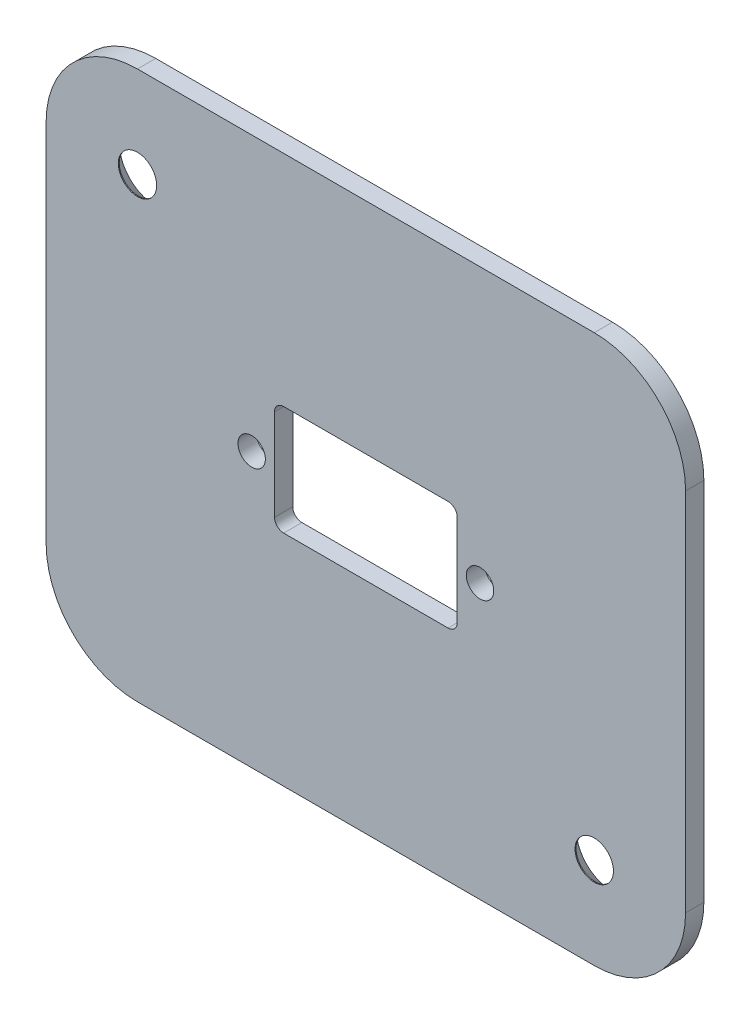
ISO-10303-21;
HEADER;
FILE_DESCRIPTION(('STEP AP214'),'2;1');
FILE_NAME('part.step','',(''),(''),'','','');
FILE_SCHEMA(('AUTOMOTIVE_DESIGN { 1 0 10303 214 1 1 1 1 }'));
ENDSEC;
DATA;
#1=APPLICATION_CONTEXT('core data for automotive mechanical design processes');
#2=APPLICATION_PROTOCOL_DEFINITION('international standard','automotive_design',2000,#1);
#3=PRODUCT_CONTEXT('',#1,'mechanical');
#4=PRODUCT('Part','Part','',(#3));
#5=PRODUCT_RELATED_PRODUCT_CATEGORY('part','',(#4));
#6=PRODUCT_DEFINITION_FORMATION('','',#4);
#7=PRODUCT_DEFINITION_CONTEXT('part definition',#1,'design');
#8=PRODUCT_DEFINITION('design','',#6,#7);
#9=PRODUCT_DEFINITION_SHAPE('','',#8);
#10=(LENGTH_UNIT() NAMED_UNIT(*) SI_UNIT(.MILLI.,.METRE.));
#11=(NAMED_UNIT(*) PLANE_ANGLE_UNIT() SI_UNIT($,.RADIAN.));
#12=(NAMED_UNIT(*) SI_UNIT($,.STERADIAN.) SOLID_ANGLE_UNIT());
#13=UNCERTAINTY_MEASURE_WITH_UNIT(LENGTH_MEASURE(1.E-05),#10,'distance_accuracy_value','');
#14=(GEOMETRIC_REPRESENTATION_CONTEXT(3) GLOBAL_UNCERTAINTY_ASSIGNED_CONTEXT((#13)) GLOBAL_UNIT_ASSIGNED_CONTEXT((#10,
#11,#12)) REPRESENTATION_CONTEXT('',''));
#15=CARTESIAN_POINT('',(0.,0.,0.));
#16=DIRECTION('',(0.,0.,1.));
#17=DIRECTION('',(1.,0.,0.));
#18=AXIS2_PLACEMENT_3D('',#15,#16,#17);
#19=CARTESIAN_POINT('',(0.,0.,-2.));
#20=DIRECTION('',(0.,0.,-1.));
#21=DIRECTION('',(-1.,0.,0.));
#22=AXIS2_PLACEMENT_3D('',#19,#20,#21);
#23=PLANE('',#22);
#24=DIRECTION('',(1.,0.,0.));
#25=VECTOR('',#24,1.);
#26=CARTESIAN_POINT('',(33.9562881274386,18.584137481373,-2.));
#27=LINE('',#26,#25);
#28=CARTESIAN_POINT('',(33.9562881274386,18.584137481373,-2.));
#29=VERTEX_POINT('',#28);
#30=CARTESIAN_POINT('',(34.0011599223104,18.584137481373,-2.));
#31=VERTEX_POINT('',#30);
#32=EDGE_CURVE('E414',#29,#31,#27,.T.);
#33=ORIENTED_EDGE('',*,*,#32,.T.);
#34=DIRECTION('',(0.389639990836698,0.920967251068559,0.));
#35=VECTOR('',#34,1.);
#36=CARTESIAN_POINT('',(34.0011599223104,18.584137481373,-2.));
#37=LINE('',#36,#35);
#38=CARTESIAN_POINT('',(35.4819291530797,22.084137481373,-2.));
#39=VERTEX_POINT('',#38);
#40=EDGE_CURVE('E55',#31,#39,#37,.T.);
#41=ORIENTED_EDGE('',*,*,#40,.T.);
#42=DIRECTION('',(-1.,0.,0.));
#43=VECTOR('',#42,1.);
#44=CARTESIAN_POINT('',(35.4819291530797,22.084137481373,-2.));
#45=LINE('',#44,#43);
#46=CARTESIAN_POINT('',(35.1453906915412,22.084137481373,-2.));
#47=VERTEX_POINT('',#46);
#48=EDGE_CURVE('E404',#39,#47,#45,.T.);
#49=ORIENTED_EDGE('',*,*,#48,.T.);
#50=DIRECTION('',(-0.389563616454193,-0.920999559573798,0.));
#51=VECTOR('',#50,1.);
#52=CARTESIAN_POINT('',(35.1453906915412,22.084137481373,-2.));
#53=LINE('',#52,#51);
#54=CARTESIAN_POINT('',(33.9787240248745,19.3259243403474,-2.));
#55=VERTEX_POINT('',#54);
#56=EDGE_CURVE('E429',#47,#55,#53,.T.);
#57=ORIENTED_EDGE('',*,*,#56,.T.);
#58=DIRECTION('',(-0.389563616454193,0.920999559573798,0.));
#59=VECTOR('',#58,1.);
#60=CARTESIAN_POINT('',(33.9787240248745,19.3259243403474,-2.));
#61=LINE('',#60,#59);
#62=CARTESIAN_POINT('',(32.8120573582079,22.084137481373,-2.));
#63=VERTEX_POINT('',#62);
#64=EDGE_CURVE('E432',#55,#63,#61,.T.);
#65=ORIENTED_EDGE('',*,*,#64,.T.);
#66=DIRECTION('',(-1.,0.,0.));
#67=VECTOR('',#66,1.);
#68=CARTESIAN_POINT('',(32.8120573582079,22.084137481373,-2.));
#69=LINE('',#68,#67);
#70=CARTESIAN_POINT('',(32.4755188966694,22.084137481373,-2.));
#71=VERTEX_POINT('',#70);
#72=EDGE_CURVE('E435',#63,#71,#69,.T.);
#73=ORIENTED_EDGE('',*,*,#72,.T.);
#74=DIRECTION('',(0.389639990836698,-0.920967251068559,0.));
#75=VECTOR('',#74,1.);
#76=CARTESIAN_POINT('',(32.4755188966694,22.084137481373,-2.));
#77=LINE('',#76,#75);
#78=EDGE_CURVE('E438',#71,#29,#77,.T.);
#79=ORIENTED_EDGE('',*,*,#78,.T.);
#80=EDGE_LOOP('',(#33,#41,#49,#57,#65,#73,#79));
#81=FACE_BOUND('',#80,.T.);
#82=CARTESIAN_POINT('',(40.7319291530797,19.5600990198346,-2.));
#83=CARTESIAN_POINT('',(40.7307477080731,19.5961436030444,-2.));
#84=CARTESIAN_POINT('',(40.7283354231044,19.6697397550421,-2.));
#85=CARTESIAN_POINT('',(40.7114920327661,19.7812037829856,-2.));
#86=CARTESIAN_POINT('',(40.6844272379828,19.8952548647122,-2.));
#87=CARTESIAN_POINT('',(40.6541169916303,19.9920090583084,-2.));
#88=CARTESIAN_POINT('',(40.6220913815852,20.071270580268,-2.));
#89=CARTESIAN_POINT('',(40.5954388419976,20.1351740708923,-2.));
#90=CARTESIAN_POINT('',(40.5622648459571,20.200935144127,-2.));
#91=CARTESIAN_POINT('',(40.5268914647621,20.2708087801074,-2.));
#92=CARTESIAN_POINT('',(40.4861345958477,20.3429942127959,-2.));
#93=CARTESIAN_POINT('',(40.4418189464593,20.4186978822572,-2.));
#94=CARTESIAN_POINT('',(40.3927192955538,20.4967158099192,-2.));
#95=CARTESIAN_POINT('',(40.3582991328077,20.5496600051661,-2.));
#96=CARTESIAN_POINT('',(40.3407031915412,20.5767256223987,-2.));
#97=B_SPLINE_CURVE_WITH_KNOTS('',3,(#82,#83,#84,#85,#86,#87,#88,#89,#90,#91,#92,#93,#94,#95,
#96),.UNSPECIFIED.,.F.,.F.,(4,1,1,1,1,1,1,1,1,1,1,1,4),(0.,0.097818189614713,0.199726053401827,
0.305276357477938,0.415811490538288,0.474472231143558,0.537273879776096,0.603657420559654,
0.674298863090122,0.749834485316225,0.828598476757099,0.912377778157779,1.),.UNSPECIFIED.);
#98=CARTESIAN_POINT('',(40.7319291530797,19.5600990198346,-2.));
#99=VERTEX_POINT('',#98);
#100=CARTESIAN_POINT('',(40.3407031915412,20.5767256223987,-2.));
#101=VERTEX_POINT('',#100);
#102=EDGE_CURVE('E640',#99,#101,#97,.T.);
#103=ORIENTED_EDGE('',*,*,#102,.T.);
#104=DIRECTION('',(-0.547387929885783,0.836878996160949,0.));
#105=VECTOR('',#104,1.);
#106=CARTESIAN_POINT('',(40.3407031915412,20.5767256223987,-2.));
#107=LINE('',#106,#105);
#108=CARTESIAN_POINT('',(39.2960317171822,22.1738810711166,-2.));
#109=VERTEX_POINT('',#108);
#110=EDGE_CURVE('E598',#101,#109,#107,.T.);
#111=ORIENTED_EDGE('',*,*,#110,.T.);
#112=DIRECTION('',(-0.786397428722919,-0.61772087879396,0.));
#113=VECTOR('',#112,1.);
#114=CARTESIAN_POINT('',(39.2960317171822,22.1738810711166,-2.));
#115=LINE('',#114,#113);
#116=CARTESIAN_POINT('',(39.0541446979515,21.9838770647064,-2.));
#117=VERTEX_POINT('',#116);
#118=EDGE_CURVE('E604',#109,#117,#115,.T.);
#119=ORIENTED_EDGE('',*,*,#118,.T.);
#120=DIRECTION('',(0.547305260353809,-0.836933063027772,0.));
#121=VECTOR('',#120,1.);
#122=CARTESIAN_POINT('',(39.0541446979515,21.9838770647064,-2.));
#123=LINE('',#122,#121);
#124=CARTESIAN_POINT('',(39.9789243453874,20.56971440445,-2.));
#125=VERTEX_POINT('',#124);
#126=EDGE_CURVE('E608',#117,#125,#123,.T.);
#127=ORIENTED_EDGE('',*,*,#126,.T.);
#128=CARTESIAN_POINT('',(39.9789243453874,20.56971440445,-2.));
#129=CARTESIAN_POINT('',(39.917354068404,20.5795282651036,-2.));
#130=CARTESIAN_POINT('',(39.7972542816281,20.5986713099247,-2.));
#131=CARTESIAN_POINT('',(39.6756883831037,20.6018292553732,-2.));
#132=CARTESIAN_POINT('',(39.6164443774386,20.6033682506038,-2.));
#133=B_SPLINE_CURVE_WITH_KNOTS('',3,(#128,#129,#130,#131,#132),.UNSPECIFIED.,.F.,.F.,(4,1,4),
(0.,0.512659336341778,1.),.UNSPECIFIED.);
#134=CARTESIAN_POINT('',(39.6164443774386,20.6033682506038,-2.));
#135=VERTEX_POINT('',#134);
#136=EDGE_CURVE('E611',#125,#135,#133,.T.);
#137=ORIENTED_EDGE('',*,*,#136,.T.);
#138=CARTESIAN_POINT('',(39.6164443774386,20.6033682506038,-2.));
#139=CARTESIAN_POINT('',(39.5808718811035,20.602412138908,-2.));
#140=CARTESIAN_POINT('',(39.5108484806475,20.6005300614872,-2.));
#141=CARTESIAN_POINT('',(39.4080416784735,20.5860462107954,-2.));
#142=CARTESIAN_POINT('',(39.3092527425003,20.5632210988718,-2.));
#143=CARTESIAN_POINT('',(39.214891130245,20.5299488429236,-2.));
#144=CARTESIAN_POINT('',(39.1246181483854,20.4874464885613,-2.));
#145=CARTESIAN_POINT('',(39.0379157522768,20.4365076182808,-2.));
#146=CARTESIAN_POINT('',(38.9564137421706,20.374501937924,-2.));
#147=CARTESIAN_POINT('',(38.8790625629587,20.3052369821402,-2.));
#148=CARTESIAN_POINT('',(38.8088354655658,20.228519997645,-2.));
#149=CARTESIAN_POINT('',(38.7466594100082,20.147118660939,-2.));
#150=CARTESIAN_POINT('',(38.6944326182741,20.0611177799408,-2.));
#151=CARTESIAN_POINT('',(38.6520586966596,19.9705609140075,-2.));
#152=CARTESIAN_POINT('',(38.6191538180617,19.8755876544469,-2.));
#153=CARTESIAN_POINT('',(38.5951661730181,19.7763195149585,-2.));
#154=CARTESIAN_POINT('',(38.5809865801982,19.6726880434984,-2.));
#155=CARTESIAN_POINT('',(38.5790610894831,19.6022098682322,-2.));
#156=CARTESIAN_POINT('',(38.5780829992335,19.5664091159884,-2.));
#157=B_SPLINE_CURVE_WITH_KNOTS('',3,(#138,#139,#140,#141,#142,#143,#144,#145,#146,#147,#148,
#149,#150,#151,#152,#153,#154,#155,#156),.UNSPECIFIED.,.F.,.F.,(4,1,1,1,1,1,1,1,1,1,1,1,1,1,1,1,
4),(0.,0.0652308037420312,0.128404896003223,0.190067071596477,0.250943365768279,
0.311545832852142,0.372862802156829,0.435023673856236,0.499071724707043,0.563091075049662,
0.625510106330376,0.686680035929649,0.747282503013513,0.808563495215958,0.870742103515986,
0.934340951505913,1.),.UNSPECIFIED.);
#158=CARTESIAN_POINT('',(38.5780829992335,19.5664091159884,-2.));
#159=VERTEX_POINT('',#158);
#160=EDGE_CURVE('E616',#135,#159,#157,.T.);
#161=ORIENTED_EDGE('',*,*,#160,.T.);
#162=CARTESIAN_POINT('',(38.5780829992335,19.5664091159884,-2.));
#163=CARTESIAN_POINT('',(38.5795061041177,19.5174294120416,-2.));
#164=CARTESIAN_POINT('',(38.5823064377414,19.4210489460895,-2.));
#165=CARTESIAN_POINT('',(38.6102102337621,19.280672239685,-2.));
#166=CARTESIAN_POINT('',(38.6535698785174,19.1469397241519,-2.));
#167=CARTESIAN_POINT('',(38.7155474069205,19.0219865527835,-2.));
#168=CARTESIAN_POINT('',(38.7925297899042,18.9059839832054,-2.));
#169=CARTESIAN_POINT('',(38.886407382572,18.8031985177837,-2.));
#170=CARTESIAN_POINT('',(38.9938508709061,18.7115284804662,-2.));
#171=CARTESIAN_POINT('',(39.1153376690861,18.6348718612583,-2.));
#172=CARTESIAN_POINT('',(39.2460806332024,18.5722688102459,-2.));
#173=CARTESIAN_POINT('',(39.3834326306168,18.527303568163,-2.));
#174=CARTESIAN_POINT('',(39.526059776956,18.4996200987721,-2.));
#175=CARTESIAN_POINT('',(39.6228643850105,18.4961494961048,-2.));
#176=CARTESIAN_POINT('',(39.6718329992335,18.4943938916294,-2.));
#177=B_SPLINE_CURVE_WITH_KNOTS('',3,(#162,#163,#164,#165,#166,#167,#168,#169,#170,#171,#172,
#173,#174,#175,#176),.UNSPECIFIED.,.F.,.F.,(4,1,1,1,1,1,1,1,1,1,1,1,4),(0.,0.0859479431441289,
0.169125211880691,0.250399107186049,0.332289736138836,0.41336428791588,0.494172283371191,
0.576021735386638,0.660756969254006,0.745783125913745,0.830043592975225,0.914027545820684,1.),.UNSPECIFIED.);
#178=CARTESIAN_POINT('',(39.6718329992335,18.4943938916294,-2.));
#179=VERTEX_POINT('',#178);
#180=EDGE_CURVE('E624',#159,#179,#177,.T.);
#181=ORIENTED_EDGE('',*,*,#180,.T.);
#182=CARTESIAN_POINT('',(39.6718329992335,18.4943938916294,-2.));
#183=CARTESIAN_POINT('',(39.7189296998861,18.4959220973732,-2.));
#184=CARTESIAN_POINT('',(39.8122200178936,18.4989492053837,-2.));
#185=CARTESIAN_POINT('',(39.9494528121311,18.525915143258,-2.));
#186=CARTESIAN_POINT('',(40.0813158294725,18.5696222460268,-2.));
#187=CARTESIAN_POINT('',(40.2068852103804,18.6298365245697,-2.));
#188=CARTESIAN_POINT('',(40.3232058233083,18.7058944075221,-2.));
#189=CARTESIAN_POINT('',(40.4272714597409,18.797456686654,-2.));
#190=CARTESIAN_POINT('',(40.5185632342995,18.9025661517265,-2.));
#191=CARTESIAN_POINT('',(40.5945378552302,19.0212064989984,-2.));
#192=CARTESIAN_POINT('',(40.6547965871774,19.1486964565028,-2.));
#193=CARTESIAN_POINT('',(40.6999865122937,19.2816336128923,-2.));
#194=CARTESIAN_POINT('',(40.7263827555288,19.4195335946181,-2.));
#195=CARTESIAN_POINT('',(40.7300713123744,19.5130147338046,-2.));
#196=CARTESIAN_POINT('',(40.7319291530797,19.5600990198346,-2.));
#197=B_SPLINE_CURVE_WITH_KNOTS('',3,(#182,#183,#184,#185,#186,#187,#188,#189,#190,#191,#192,
#193,#194,#195,#196),.UNSPECIFIED.,.F.,.F.,(4,1,1,1,1,1,1,1,1,1,1,1,4),(0.,0.0843347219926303,
0.167052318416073,0.249566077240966,0.332740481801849,0.415914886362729,0.497828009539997,
0.580372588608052,0.664600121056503,0.749466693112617,0.832510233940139,0.915639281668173,1.),.UNSPECIFIED.);
#198=EDGE_CURVE('E632',#179,#99,#197,.T.);
#199=ORIENTED_EDGE('',*,*,#198,.T.);
#200=EDGE_LOOP('',(#103,#111,#119,#127,#137,#161,#181,#199));
#201=FACE_BOUND('',#200,.T.);
#202=CARTESIAN_POINT('',(44.,25.,-2.));
#203=DIRECTION('',(0.,0.,-1.));
#204=DIRECTION('',(-1.,0.,0.));
#205=AXIS2_PLACEMENT_3D('',#202,#203,#204);
#206=CIRCLE('',#205,1.);
#207=CARTESIAN_POINT('',(45.,25.,-2.));
#208=VERTEX_POINT('',#207);
#209=CARTESIAN_POINT('',(44.,24.,-2.));
#210=VERTEX_POINT('',#209);
#211=EDGE_CURVE('E669',#208,#210,#206,.T.);
#212=ORIENTED_EDGE('',*,*,#211,.F.);
#213=DIRECTION('',(0.,-1.,0.));
#214=VECTOR('',#213,1.);
#215=CARTESIAN_POINT('',(45.,35.,-2.));
#216=LINE('',#215,#214);
#217=CARTESIAN_POINT('',(45.,35.,-2.));
#218=VERTEX_POINT('',#217);
#219=EDGE_CURVE('E674',#218,#208,#216,.T.);
#220=ORIENTED_EDGE('',*,*,#219,.F.);
#221=CARTESIAN_POINT('',(44.,35.,-2.));
#222=DIRECTION('',(0.,0.,-1.));
#223=DIRECTION('',(-1.,0.,0.));
#224=AXIS2_PLACEMENT_3D('',#221,#222,#223);
#225=CIRCLE('',#224,1.);
#226=CARTESIAN_POINT('',(44.,36.,-2.));
#227=VERTEX_POINT('',#226);
#228=EDGE_CURVE('E712',#227,#218,#225,.T.);
#229=ORIENTED_EDGE('',*,*,#228,.F.);
#230=DIRECTION('',(1.,0.,0.));
#231=VECTOR('',#230,1.);
#232=CARTESIAN_POINT('',(44.,36.,-2.));
#233=LINE('',#232,#231);
#234=CARTESIAN_POINT('',(26.,36.,-2.));
#235=VERTEX_POINT('',#234);
#236=EDGE_CURVE('E709',#235,#227,#233,.T.);
#237=ORIENTED_EDGE('',*,*,#236,.F.);
#238=CARTESIAN_POINT('',(26.,35.,-2.));
#239=DIRECTION('',(0.,0.,-1.));
#240=DIRECTION('',(-1.,0.,0.));
#241=AXIS2_PLACEMENT_3D('',#238,#239,#240);
#242=CIRCLE('',#241,1.);
#243=CARTESIAN_POINT('',(25.,35.,-2.));
#244=VERTEX_POINT('',#243);
#245=EDGE_CURVE('E706',#244,#235,#242,.T.);
#246=ORIENTED_EDGE('',*,*,#245,.F.);
#247=DIRECTION('',(0.,1.,0.));
#248=VECTOR('',#247,1.);
#249=CARTESIAN_POINT('',(25.,35.,-2.));
#250=LINE('',#249,#248);
#251=CARTESIAN_POINT('',(25.,25.,-2.));
#252=VERTEX_POINT('',#251);
#253=EDGE_CURVE('E703',#252,#244,#250,.T.);
#254=ORIENTED_EDGE('',*,*,#253,.F.);
#255=CARTESIAN_POINT('',(26.,25.,-2.));
#256=DIRECTION('',(0.,0.,-1.));
#257=DIRECTION('',(-1.,0.,0.));
#258=AXIS2_PLACEMENT_3D('',#255,#256,#257);
#259=CIRCLE('',#258,1.);
#260=CARTESIAN_POINT('',(26.,24.,-2.));
#261=VERTEX_POINT('',#260);
#262=EDGE_CURVE('E700',#261,#252,#259,.T.);
#263=ORIENTED_EDGE('',*,*,#262,.F.);
#264=DIRECTION('',(-1.,0.,0.));
#265=VECTOR('',#264,1.);
#266=CARTESIAN_POINT('',(44.,24.,-2.));
#267=LINE('',#266,#265);
#268=EDGE_CURVE('E697',#210,#261,#267,.T.);
#269=ORIENTED_EDGE('',*,*,#268,.F.);
#270=EDGE_LOOP('',(#212,#220,#229,#237,#246,#254,#263,#269));
#271=FACE_BOUND('',#270,.T.);
#272=CARTESIAN_POINT('',(22.5,30.,-2.));
#273=DIRECTION('',(0.,0.,-1.));
#274=DIRECTION('',(-1.,0.,0.));
#275=AXIS2_PLACEMENT_3D('',#272,#273,#274);
#276=CIRCLE('',#275,1.5);
#277=CARTESIAN_POINT('',(21.,30.,-2.));
#278=VERTEX_POINT('',#277);
#279=EDGE_CURVE('E719',#278,#278,#276,.T.);
#280=ORIENTED_EDGE('',*,*,#279,.F.);
#281=EDGE_LOOP('',(#280));
#282=FACE_BOUND('',#281,.T.);
#283=CARTESIAN_POINT('',(47.5,30.,-2.));
#284=DIRECTION('',(0.,0.,-1.));
#285=DIRECTION('',(-1.,0.,0.));
#286=AXIS2_PLACEMENT_3D('',#283,#284,#285);
#287=CIRCLE('',#286,1.5);
#288=CARTESIAN_POINT('',(46.,30.,-2.));
#289=VERTEX_POINT('',#288);
#290=EDGE_CURVE('E737',#289,#289,#287,.T.);
#291=ORIENTED_EDGE('',*,*,#290,.F.);
#292=EDGE_LOOP('',(#291));
#293=FACE_BOUND('',#292,.T.);
#294=CARTESIAN_POINT('',(10.,50.,-2.));
#295=DIRECTION('',(0.,0.,-1.));
#296=DIRECTION('',(-1.,0.,0.));
#297=AXIS2_PLACEMENT_3D('',#294,#295,#296);
#298=CIRCLE('',#297,4.);
#299=CARTESIAN_POINT('',(6.,50.,-2.));
#300=VERTEX_POINT('',#299);
#301=EDGE_CURVE('E814',#300,#300,#298,.F.);
#302=ORIENTED_EDGE('',*,*,#301,.T.);
#303=EDGE_LOOP('',(#302));
#304=FACE_BOUND('',#303,.T.);
#305=CARTESIAN_POINT('',(60.,10.,-2.));
#306=DIRECTION('',(0.,0.,-1.));
#307=DIRECTION('',(-1.,0.,0.));
#308=AXIS2_PLACEMENT_3D('',#305,#306,#307);
#309=CIRCLE('',#308,4.);
#310=CARTESIAN_POINT('',(56.,10.,-2.));
#311=VERTEX_POINT('',#310);
#312=EDGE_CURVE('E811',#311,#311,#309,.F.);
#313=ORIENTED_EDGE('',*,*,#312,.T.);
#314=EDGE_LOOP('',(#313));
#315=FACE_BOUND('',#314,.T.);
#316=DIRECTION('',(0.,1.,0.));
#317=VECTOR('',#316,1.);
#318=CARTESIAN_POINT('',(70.,0.,-2.));
#319=LINE('',#318,#317);
#320=CARTESIAN_POINT('',(70.,10.,-2.));
#321=VERTEX_POINT('',#320);
#322=CARTESIAN_POINT('',(70.,50.,-2.));
#323=VERTEX_POINT('',#322);
#324=EDGE_CURVE('E759',#321,#323,#319,.T.);
#325=ORIENTED_EDGE('',*,*,#324,.F.);
#326=CARTESIAN_POINT('',(60.,10.,-2.));
#327=DIRECTION('',(0.,0.,-1.));
#328=DIRECTION('',(-1.,0.,0.));
#329=AXIS2_PLACEMENT_3D('',#326,#327,#328);
#330=CIRCLE('',#329,10.);
#331=CARTESIAN_POINT('',(60.,0.,-2.));
#332=VERTEX_POINT('',#331);
#333=EDGE_CURVE('E799',#321,#332,#330,.T.);
#334=ORIENTED_EDGE('',*,*,#333,.T.);
#335=DIRECTION('',(1.,0.,0.));
#336=VECTOR('',#335,1.);
#337=CARTESIAN_POINT('',(0.,0.,-2.));
#338=LINE('',#337,#336);
#339=CARTESIAN_POINT('',(10.,0.,-2.));
#340=VERTEX_POINT('',#339);
#341=EDGE_CURVE('E755',#340,#332,#338,.T.);
#342=ORIENTED_EDGE('',*,*,#341,.F.);
#343=CARTESIAN_POINT('',(10.,10.,-2.));
#344=DIRECTION('',(0.,0.,-1.));
#345=DIRECTION('',(-1.,0.,0.));
#346=AXIS2_PLACEMENT_3D('',#343,#344,#345);
#347=CIRCLE('',#346,10.);
#348=CARTESIAN_POINT('',(0.,10.,-2.));
#349=VERTEX_POINT('',#348);
#350=EDGE_CURVE('E797',#340,#349,#347,.T.);
#351=ORIENTED_EDGE('',*,*,#350,.T.);
#352=DIRECTION('',(0.,-1.,0.));
#353=VECTOR('',#352,1.);
#354=CARTESIAN_POINT('',(0.,0.,-2.));
#355=LINE('',#354,#353);
#356=CARTESIAN_POINT('',(0.,50.,-2.));
#357=VERTEX_POINT('',#356);
#358=EDGE_CURVE('E752',#357,#349,#355,.T.);
#359=ORIENTED_EDGE('',*,*,#358,.F.);
#360=CARTESIAN_POINT('',(10.,50.,-2.));
#361=DIRECTION('',(0.,0.,-1.));
#362=DIRECTION('',(-1.,0.,0.));
#363=AXIS2_PLACEMENT_3D('',#360,#361,#362);
#364=CIRCLE('',#363,10.);
#365=CARTESIAN_POINT('',(10.,60.,-2.));
#366=VERTEX_POINT('',#365);
#367=EDGE_CURVE('E795',#357,#366,#364,.T.);
#368=ORIENTED_EDGE('',*,*,#367,.T.);
#369=DIRECTION('',(-1.,0.,0.));
#370=VECTOR('',#369,1.);
#371=CARTESIAN_POINT('',(0.,60.,-2.));
#372=LINE('',#371,#370);
#373=CARTESIAN_POINT('',(60.,60.,-2.));
#374=VERTEX_POINT('',#373);
#375=EDGE_CURVE('E762',#374,#366,#372,.T.);
#376=ORIENTED_EDGE('',*,*,#375,.F.);
#377=CARTESIAN_POINT('',(60.,50.,-2.));
#378=DIRECTION('',(0.,0.,-1.));
#379=DIRECTION('',(-1.,0.,0.));
#380=AXIS2_PLACEMENT_3D('',#377,#378,#379);
#381=CIRCLE('',#380,10.);
#382=EDGE_CURVE('E793',#374,#323,#381,.T.);
#383=ORIENTED_EDGE('',*,*,#382,.T.);
#384=EDGE_LOOP('',(#325,#334,#342,#351,#359,#368,#376,#383));
#385=FACE_BOUND('',#384,.T.);
#386=CARTESIAN_POINT('',(35.840903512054,20.3327352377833,-2.));
#387=CARTESIAN_POINT('',(35.841555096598,20.2792113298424,-2.));
#388=CARTESIAN_POINT('',(35.8428246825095,20.1749221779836,-2.));
#389=CARTESIAN_POINT('',(35.8494033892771,20.0223912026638,-2.));
#390=CARTESIAN_POINT('',(35.8623620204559,19.8783931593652,-2.));
#391=CARTESIAN_POINT('',(35.8785720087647,19.7425826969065,-2.));
#392=CARTESIAN_POINT('',(35.9010229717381,19.6155250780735,-2.));
#393=CARTESIAN_POINT('',(35.9286281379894,19.4967806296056,-2.));
#394=CARTESIAN_POINT('',(35.9592784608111,19.3858365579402,-2.));
#395=CARTESIAN_POINT('',(35.9971132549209,19.2836017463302,-2.));
#396=CARTESIAN_POINT('',(36.0385239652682,19.1886500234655,-2.));
#397=CARTESIAN_POINT('',(36.0835791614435,19.0999828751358,-2.));
#398=CARTESIAN_POINT('',(36.1318489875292,19.0168165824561,-2.));
#399=CARTESIAN_POINT('',(36.1844377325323,18.939816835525,-2.));
#400=CARTESIAN_POINT('',(36.2404911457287,18.8684381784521,-2.));
#401=CARTESIAN_POINT('',(36.3012089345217,18.8039405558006,-2.));
#402=CARTESIAN_POINT('',(36.3648795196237,18.7447698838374,-2.));
#403=CARTESIAN_POINT('',(36.4322919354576,18.6921182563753,-2.));
#404=CARTESIAN_POINT('',(36.5027034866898,18.6460334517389,-2.));
#405=CARTESIAN_POINT('',(36.5746625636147,18.6048196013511,-2.));
#406=CARTESIAN_POINT('',(36.6494459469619,18.5715869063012,-2.));
#407=CARTESIAN_POINT('',(36.7253588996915,18.5430518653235,-2.));
#408=CARTESIAN_POINT('',(36.8034872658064,18.5212514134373,-2.));
#409=CARTESIAN_POINT('',(36.8837336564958,18.5061775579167,-2.));
#410=CARTESIAN_POINT('',(36.9656898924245,18.495605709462,-2.));
#411=CARTESIAN_POINT('',(37.0210914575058,18.4947992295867,-2.));
#412=CARTESIAN_POINT('',(37.0489363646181,18.4943938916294,-2.));
#413=B_SPLINE_CURVE_WITH_KNOTS('',3,(#386,#387,#388,#389,#390,#391,#392,#393,#394,#395,#396,
#397,#398,#399,#400,#401,#402,#403,#404,#405,#406,#407,#408,#409,#410,#411,#412),.UNSPECIFIED.,
.F.,.F.,(4,1,1,1,1,1,1,1,1,1,1,1,1,1,1,1,1,1,1,1,1,1,1,1,4),(0.,0.0650632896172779,
0.126773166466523,0.185515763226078,0.240764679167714,0.292979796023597,0.342250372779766,
0.38891928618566,0.43277566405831,0.474628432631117,0.514774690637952,0.553605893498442,
0.591426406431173,0.628028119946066,0.663803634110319,0.698984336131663,0.733591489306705,
0.767628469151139,0.801208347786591,0.834263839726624,0.866980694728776,0.899719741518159,
0.932701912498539,0.966175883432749,1.),.UNSPECIFIED.);
#414=CARTESIAN_POINT('',(35.840903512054,20.3327352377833,-2.));
#415=VERTEX_POINT('',#414);
#416=CARTESIAN_POINT('',(37.0489363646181,18.4943938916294,-2.));
#417=VERTEX_POINT('',#416);
#418=EDGE_CURVE('E529',#415,#417,#413,.T.);
#419=ORIENTED_EDGE('',*,*,#418,.T.);
#420=CARTESIAN_POINT('',(37.0489363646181,18.4943938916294,-2.));
#421=CARTESIAN_POINT('',(37.0765404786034,18.4948602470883,-2.));
#422=CARTESIAN_POINT('',(37.1309704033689,18.4957798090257,-2.));
#423=CARTESIAN_POINT('',(37.2116228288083,18.5052935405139,-2.));
#424=CARTESIAN_POINT('',(37.2899052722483,18.5205890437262,-2.));
#425=CARTESIAN_POINT('',(37.3662040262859,18.5420056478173,-2.));
#426=CARTESIAN_POINT('',(37.4409105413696,18.5682204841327,-2.));
#427=CARTESIAN_POINT('',(37.5130068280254,18.6023741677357,-2.));
#428=CARTESIAN_POINT('',(37.5832945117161,18.6417082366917,-2.));
#429=CARTESIAN_POINT('',(37.6515860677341,18.68650365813,-2.));
#430=CARTESIAN_POINT('',(37.716598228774,18.7378253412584,-2.));
#431=CARTESIAN_POINT('',(37.7786968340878,18.7945896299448,-2.));
#432=CARTESIAN_POINT('',(37.8363218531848,18.8582130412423,-2.));
#433=CARTESIAN_POINT('',(37.8899559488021,18.92769096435,-2.));
#434=CARTESIAN_POINT('',(37.9409300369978,19.0023842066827,-2.));
#435=CARTESIAN_POINT('',(37.9878194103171,19.0833125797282,-2.));
#436=CARTESIAN_POINT('',(38.0311902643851,19.1701551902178,-2.));
#437=CARTESIAN_POINT('',(38.0708337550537,19.2634731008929,-2.));
#438=CARTESIAN_POINT('',(38.1059824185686,19.3646280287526,-2.));
#439=CARTESIAN_POINT('',(38.137030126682,19.4747772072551,-2.));
#440=CARTESIAN_POINT('',(38.1615442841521,19.5948928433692,-2.));
#441=CARTESIAN_POINT('',(38.182527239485,19.7240102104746,-2.));
#442=CARTESIAN_POINT('',(38.1994516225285,19.8626841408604,-2.));
#443=CARTESIAN_POINT('',(38.2110059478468,20.0109899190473,-2.));
#444=CARTESIAN_POINT('',(38.2181472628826,20.1688351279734,-2.));
#445=CARTESIAN_POINT('',(38.2187823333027,20.2771049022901,-2.));
#446=CARTESIAN_POINT('',(38.2191086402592,20.3327352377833,-2.));
#447=B_SPLINE_CURVE_WITH_KNOTS('',3,(#420,#421,#422,#423,#424,#425,#426,#427,#428,#429,#430,
#431,#432,#433,#434,#435,#436,#437,#438,#439,#440,#441,#442,#443,#444,#445,#446),.UNSPECIFIED.,
.F.,.F.,(4,1,1,1,1,1,1,1,1,1,1,1,1,1,1,1,1,1,1,1,1,1,1,1,4),(0.,0.0337871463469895,
0.0666216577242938,0.0992848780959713,0.131361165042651,0.163585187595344,0.196103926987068,
0.228902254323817,0.262158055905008,0.295991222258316,0.330217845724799,0.365059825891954,
0.400950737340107,0.437620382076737,0.475707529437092,0.515380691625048,0.556413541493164,
0.599764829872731,0.646424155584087,0.696431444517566,0.749781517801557,0.806573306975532,
0.867435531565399,0.931886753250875,1.),.UNSPECIFIED.);
#448=CARTESIAN_POINT('',(38.2191086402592,20.3327352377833,-2.));
#449=VERTEX_POINT('',#448);
#450=EDGE_CURVE('E504',#417,#449,#447,.T.);
#451=ORIENTED_EDGE('',*,*,#450,.T.);
#452=CARTESIAN_POINT('',(38.2191086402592,20.3327352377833,-2.));
#453=CARTESIAN_POINT('',(38.2187806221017,20.3888326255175,-2.));
#454=CARTESIAN_POINT('',(38.2181434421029,20.497802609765,-2.));
#455=CARTESIAN_POINT('',(38.2110550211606,20.6565872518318,-2.));
#456=CARTESIAN_POINT('',(38.1992796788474,20.805547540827,-2.));
#457=CARTESIAN_POINT('',(38.1831423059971,20.9446906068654,-2.));
#458=CARTESIAN_POINT('',(38.1635043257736,21.0740523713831,-2.));
#459=CARTESIAN_POINT('',(38.1372888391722,21.1932871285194,-2.));
#460=CARTESIAN_POINT('',(38.1074760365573,21.3029467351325,-2.));
#461=CARTESIAN_POINT('',(38.0729235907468,21.4033887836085,-2.));
#462=CARTESIAN_POINT('',(38.0339358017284,21.4959664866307,-2.));
#463=CARTESIAN_POINT('',(37.9915015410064,21.5823916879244,-2.));
#464=CARTESIAN_POINT('',(37.9439367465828,21.6625336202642,-2.));
#465=CARTESIAN_POINT('',(37.8939598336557,21.7376714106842,-2.));
#466=CARTESIAN_POINT('',(37.8395477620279,21.8065751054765,-2.));
#467=CARTESIAN_POINT('',(37.7822489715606,21.870217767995,-2.));
#468=CARTESIAN_POINT('',(37.7198270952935,21.9271285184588,-2.));
#469=CARTESIAN_POINT('',(37.6544040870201,21.9789748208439,-2.));
#470=CARTESIAN_POINT('',(37.5853876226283,22.0244242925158,-2.));
#471=CARTESIAN_POINT('',(37.5147449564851,22.0644570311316,-2.));
#472=CARTESIAN_POINT('',(37.4419898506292,22.0986568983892,-2.));
#473=CARTESIAN_POINT('',(37.3669236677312,22.1255473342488,-2.));
#474=CARTESIAN_POINT('',(37.2902211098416,22.1477581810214,-2.));
#475=CARTESIAN_POINT('',(37.2116140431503,22.1629471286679,-2.));
#476=CARTESIAN_POINT('',(37.130972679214,22.1725040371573,-2.));
#477=CARTESIAN_POINT('',(37.0765412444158,22.1734177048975,-2.));
#478=CARTESIAN_POINT('',(37.0489363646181,22.1738810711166,-2.));
#479=B_SPLINE_CURVE_WITH_KNOTS('',3,(#452,#453,#454,#455,#456,#457,#458,#459,#460,#461,#462,
#463,#464,#465,#466,#467,#468,#469,#470,#471,#472,#473,#474,#475,#476,#477,#478),.UNSPECIFIED.,
.F.,.F.,(4,1,1,1,1,1,1,1,1,1,1,1,1,1,1,1,1,1,1,1,1,1,1,1,4),(0.,0.068594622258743,
0.133246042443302,0.194312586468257,0.251279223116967,0.304513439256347,0.354234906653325,
0.400480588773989,0.443410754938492,0.484014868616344,0.523252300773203,0.56104237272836,
0.597900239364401,0.633518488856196,0.668314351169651,0.702495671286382,0.736685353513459,
0.770293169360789,0.803437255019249,0.835912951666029,0.86846024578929,0.900846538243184,
0.933466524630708,0.966257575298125,1.),.UNSPECIFIED.);
#480=CARTESIAN_POINT('',(37.0489363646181,22.1738810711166,-2.));
#481=VERTEX_POINT('',#480);
#482=EDGE_CURVE('E512',#449,#481,#479,.T.);
#483=ORIENTED_EDGE('',*,*,#482,.T.);
#484=CARTESIAN_POINT('',(37.0489363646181,22.1738810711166,-2.));
#485=CARTESIAN_POINT('',(37.0211008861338,22.173393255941,-2.));
#486=CARTESIAN_POINT('',(36.9657448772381,22.1724231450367,-2.));
#487=CARTESIAN_POINT('',(36.8839045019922,22.1630992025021,-2.));
#488=CARTESIAN_POINT('',(36.8039548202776,22.1476280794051,-2.));
#489=CARTESIAN_POINT('',(36.7262366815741,22.1257071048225,-2.));
#490=CARTESIAN_POINT('',(36.6501116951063,22.0985114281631,-2.));
#491=CARTESIAN_POINT('',(36.5761752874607,22.0644243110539,-2.));
#492=CARTESIAN_POINT('',(36.5039682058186,22.0247454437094,-2.));
#493=CARTESIAN_POINT('',(36.4346379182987,21.9781215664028,-2.));
#494=CARTESIAN_POINT('',(36.3674233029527,21.9261392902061,-2.));
#495=CARTESIAN_POINT('',(36.3039753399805,21.8673766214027,-2.));
#496=CARTESIAN_POINT('',(36.2442882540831,21.802426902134,-2.));
#497=CARTESIAN_POINT('',(36.1876129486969,21.7319850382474,-2.));
#498=CARTESIAN_POINT('',(36.1355573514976,21.6546999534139,-2.));
#499=CARTESIAN_POINT('',(36.0859839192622,21.5719158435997,-2.));
#500=CARTESIAN_POINT('',(36.0416118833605,21.4821849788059,-2.));
#501=CARTESIAN_POINT('',(35.998877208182,21.3870045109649,-2.));
#502=CARTESIAN_POINT('',(35.9619902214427,21.2837408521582,-2.));
#503=CARTESIAN_POINT('',(35.9287239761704,21.1729760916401,-2.));
#504=CARTESIAN_POINT('',(35.9018450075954,21.0534019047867,-2.));
#505=CARTESIAN_POINT('',(35.8794557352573,20.9256456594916,-2.));
#506=CARTESIAN_POINT('',(35.8621108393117,20.7892381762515,-2.));
#507=CARTESIAN_POINT('',(35.8494781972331,20.6444718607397,-2.));
#508=CARTESIAN_POINT('',(35.8428051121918,20.491251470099,-2.));
#509=CARTESIAN_POINT('',(35.8415484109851,20.3864936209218,-2.));
#510=CARTESIAN_POINT('',(35.840903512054,20.3327352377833,-2.));
#511=B_SPLINE_CURVE_WITH_KNOTS('',3,(#484,#485,#486,#487,#488,#489,#490,#491,#492,#493,#494,
#495,#496,#497,#498,#499,#500,#501,#502,#503,#504,#505,#506,#507,#508,#509,#510),.UNSPECIFIED.,
.F.,.F.,(4,1,1,1,1,1,1,1,1,1,1,1,1,1,1,1,1,1,1,1,1,1,1,1,4),(0.,0.0337881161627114,
0.0671939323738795,0.0998624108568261,0.132566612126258,0.165151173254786,0.197913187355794,
0.231319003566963,0.265083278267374,0.299255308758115,0.334398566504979,0.369942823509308,
0.40628356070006,0.444063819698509,0.482997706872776,0.523354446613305,0.565536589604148,
0.609612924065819,0.656390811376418,0.705885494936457,0.758324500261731,0.81383178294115,
0.872794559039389,0.934722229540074,1.),.UNSPECIFIED.);
#512=EDGE_CURVE('E521',#481,#415,#511,.T.);
#513=ORIENTED_EDGE('',*,*,#512,.T.);
#514=EDGE_LOOP('',(#419,#451,#483,#513));
#515=FACE_BOUND('',#514,.T.);
#516=CARTESIAN_POINT('',(32.0268009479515,20.3544700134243,-2.));
#517=CARTESIAN_POINT('',(32.0252457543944,20.4174254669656,-2.));
#518=CARTESIAN_POINT('',(32.0221860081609,20.5412863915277,-2.));
#519=CARTESIAN_POINT('',(31.9961902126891,20.7230603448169,-2.));
#520=CARTESIAN_POINT('',(31.9543714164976,20.8972117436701,-2.));
#521=CARTESIAN_POINT('',(31.8949745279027,21.063415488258,-2.));
#522=CARTESIAN_POINT('',(31.8196691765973,21.2225457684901,-2.));
#523=CARTESIAN_POINT('',(31.7266425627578,21.3733869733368,-2.));
#524=CARTESIAN_POINT('',(31.6169754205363,21.5169037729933,-2.));
#525=CARTESIAN_POINT('',(31.4915278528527,21.6509185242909,-2.));
#526=CARTESIAN_POINT('',(31.353960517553,21.7734578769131,-2.));
#527=CARTESIAN_POINT('',(31.206641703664,21.8812640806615,-2.));
#528=CARTESIAN_POINT('',(31.0498597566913,21.9709815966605,-2.));
#529=CARTESIAN_POINT('',(30.8853419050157,22.0459777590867,-2.));
#530=CARTESIAN_POINT('',(30.7118562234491,22.1036222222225,-2.));
#531=CARTESIAN_POINT('',(30.5297728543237,22.1439754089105,-2.));
#532=CARTESIAN_POINT('',(30.3394339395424,22.1690925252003,-2.));
#533=CARTESIAN_POINT('',(30.2095715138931,22.1722677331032,-2.));
#534=CARTESIAN_POINT('',(30.1435878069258,22.1738810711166,-2.));
#535=B_SPLINE_CURVE_WITH_KNOTS('',3,(#516,#517,#518,#519,#520,#521,#522,#523,#524,#525,#526,
#527,#528,#529,#530,#531,#532,#533,#534),.UNSPECIFIED.,.F.,.F.,(4,1,1,1,1,1,1,1,1,1,1,1,1,1,1,1,
4),(0.,0.0645578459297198,0.127013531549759,0.187954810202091,0.248013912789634,
0.307747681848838,0.368234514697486,0.429469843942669,0.492743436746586,0.556257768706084,
0.618216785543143,0.679655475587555,0.74124554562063,0.803415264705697,0.866815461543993,
0.932328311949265,1.),.UNSPECIFIED.);
#536=CARTESIAN_POINT('',(32.0268009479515,20.3544700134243,-2.));
#537=VERTEX_POINT('',#536);
#538=CARTESIAN_POINT('',(30.1435878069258,22.1738810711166,-2.));
#539=VERTEX_POINT('',#538);
#540=EDGE_CURVE('E397',#537,#539,#535,.T.);
#541=ORIENTED_EDGE('',*,*,#540,.T.);
#542=CARTESIAN_POINT('',(30.1435878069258,22.1738810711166,-2.));
#543=CARTESIAN_POINT('',(30.1033733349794,22.1733989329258,-2.));
#544=CARTESIAN_POINT('',(30.0237728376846,22.1724445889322,-2.));
#545=CARTESIAN_POINT('',(29.9060201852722,22.1631384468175,-2.));
#546=CARTESIAN_POINT('',(29.791377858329,22.1476248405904,-2.));
#547=CARTESIAN_POINT('',(29.6797668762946,22.1265087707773,-2.));
#548=CARTESIAN_POINT('',(29.5706442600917,22.1003014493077,-2.));
#549=CARTESIAN_POINT('',(29.4648440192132,22.0661611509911,-2.));
#550=CARTESIAN_POINT('',(29.3617453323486,22.0271246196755,-2.));
#551=CARTESIAN_POINT('',(29.2619984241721,21.9821661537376,-2.));
#552=CARTESIAN_POINT('',(29.1660818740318,21.9316994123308,-2.));
#553=CARTESIAN_POINT('',(29.0740255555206,21.8762837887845,-2.));
#554=CARTESIAN_POINT('',(28.9865606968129,21.8159879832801,-2.));
#555=CARTESIAN_POINT('',(28.9030718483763,21.7513248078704,-2.));
#556=CARTESIAN_POINT('',(28.8249556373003,21.680926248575,-2.));
#557=CARTESIAN_POINT('',(28.7499941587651,21.6067286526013,-2.));
#558=CARTESIAN_POINT('',(28.6807330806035,21.526594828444,-2.));
#559=CARTESIAN_POINT('',(28.6379798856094,21.4701898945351,-2.));
#560=CARTESIAN_POINT('',(28.616544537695,21.4419099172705,-2.));
#561=B_SPLINE_CURVE_WITH_KNOTS('',3,(#542,#543,#544,#545,#546,#547,#548,#549,#550,#551,#552,
#553,#554,#555,#556,#557,#558,#559,#560),.UNSPECIFIED.,.F.,.F.,(4,1,1,1,1,1,1,1,1,1,1,1,1,1,1,1,
4),(0.,0.0685475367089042,0.135682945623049,0.20121498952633,0.265682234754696,
0.329266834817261,0.392395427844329,0.455069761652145,0.517126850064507,0.578790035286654,
0.639739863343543,0.700191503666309,0.759806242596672,0.819628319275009,0.879354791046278,
0.939511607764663,1.),.UNSPECIFIED.);
#562=CARTESIAN_POINT('',(28.616544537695,21.4419099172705,-2.));
#563=VERTEX_POINT('',#562);
#564=EDGE_CURVE('E47',#539,#563,#561,.T.);
#565=ORIENTED_EDGE('',*,*,#564,.T.);
#566=DIRECTION('',(0.794127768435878,-0.607750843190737,0.));
#567=VECTOR('',#566,1.);
#568=CARTESIAN_POINT('',(28.616544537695,21.4419099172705,-2.));
#569=LINE('',#568,#567);
#570=CARTESIAN_POINT('',(28.8913842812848,21.2315733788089,-2.));
#571=VERTEX_POINT('',#570);
#572=EDGE_CURVE('E401',#563,#571,#569,.T.);
#573=ORIENTED_EDGE('',*,*,#572,.T.);
#574=CARTESIAN_POINT('',(28.8913842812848,21.2315733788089,-2.));
#575=CARTESIAN_POINT('',(28.910990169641,21.2549393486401,-2.));
#576=CARTESIAN_POINT('',(28.9499376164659,21.3013562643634,-2.));
#577=CARTESIAN_POINT('',(29.0125968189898,21.3665358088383,-2.));
#578=CARTESIAN_POINT('',(29.077898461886,21.427601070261,-2.));
#579=CARTESIAN_POINT('',(29.145817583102,21.4848429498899,-2.));
#580=CARTESIAN_POINT('',(29.2175767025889,21.5362597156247,-2.));
#581=CARTESIAN_POINT('',(29.2914375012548,21.5845308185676,-2.));
#582=CARTESIAN_POINT('',(29.3686355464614,21.6277985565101,-2.));
#583=CARTESIAN_POINT('',(29.4753872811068,21.680261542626,-2.));
#584=CARTESIAN_POINT('',(29.6150351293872,21.7350076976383,-2.));
#585=CARTESIAN_POINT('',(29.7908299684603,21.7809109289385,-2.));
#586=CARTESIAN_POINT('',(29.9743410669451,21.8101321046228,-2.));
#587=CARTESIAN_POINT('',(30.099538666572,21.8132969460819,-2.));
#588=CARTESIAN_POINT('',(30.1632192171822,21.8149067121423,-2.));
#589=B_SPLINE_CURVE_WITH_KNOTS('',3,(#574,#575,#576,#577,#578,#579,#580,#581,#582,#583,#584,
#585,#586,#587,#588),.UNSPECIFIED.,.F.,.F.,(4,1,1,1,1,1,1,1,1,1,1,1,4),(0.,0.0631632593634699,
0.125474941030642,0.187121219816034,0.2482943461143,0.309294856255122,0.369850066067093,
0.430973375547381,0.492455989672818,0.616147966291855,0.740843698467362,0.868182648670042,1.),.UNSPECIFIED.);
#590=CARTESIAN_POINT('',(30.1632192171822,21.8149067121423,-2.));
#591=VERTEX_POINT('',#590);
#592=EDGE_CURVE('E883',#571,#591,#589,.T.);
#593=ORIENTED_EDGE('',*,*,#592,.T.);
#594=CARTESIAN_POINT('',(30.1632192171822,21.8149067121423,-2.));
#595=CARTESIAN_POINT('',(30.1983025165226,21.8145027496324,-2.));
#596=CARTESIAN_POINT('',(30.2681435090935,21.8136985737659,-2.));
#597=CARTESIAN_POINT('',(30.371791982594,21.8030894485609,-2.));
#598=CARTESIAN_POINT('',(30.4735050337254,21.7881782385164,-2.));
#599=CARTESIAN_POINT('',(30.573216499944,21.7660529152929,-2.));
#600=CARTESIAN_POINT('',(30.6707994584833,21.7380802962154,-2.));
#601=CARTESIAN_POINT('',(30.7668918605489,21.7046548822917,-2.));
#602=CARTESIAN_POINT('',(30.860102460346,21.6633000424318,-2.));
#603=CARTESIAN_POINT('',(30.9517206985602,21.6175917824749,-2.));
#604=CARTESIAN_POINT('',(31.0394999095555,21.5659643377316,-2.));
#605=CARTESIAN_POINT('',(31.1225549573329,21.50965098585,-2.));
#606=CARTESIAN_POINT('',(31.2005829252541,21.4492818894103,-2.));
#607=CARTESIAN_POINT('',(31.2736455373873,21.3846307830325,-2.));
#608=CARTESIAN_POINT('',(31.3418174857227,21.3159888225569,-2.));
#609=CARTESIAN_POINT('',(31.4046047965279,21.2426244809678,-2.));
#610=CARTESIAN_POINT('',(31.4617902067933,21.1647723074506,-2.));
#611=CARTESIAN_POINT('',(31.5145072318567,21.0834588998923,-2.));
#612=CARTESIAN_POINT('',(31.5617199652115,20.9989211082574,-2.));
#613=CARTESIAN_POINT('',(31.6012498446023,20.9108460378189,-2.));
#614=CARTESIAN_POINT('',(31.636254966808,20.8207419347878,-2.));
#615=CARTESIAN_POINT('',(31.663954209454,20.7275907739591,-2.));
#616=CARTESIAN_POINT('',(31.6858787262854,20.6320480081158,-2.));
#617=CARTESIAN_POINT('',(31.7010063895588,20.5338572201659,-2.));
#618=CARTESIAN_POINT('',(31.7114948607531,20.4332235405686,-2.));
#619=CARTESIAN_POINT('',(31.7122950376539,20.3650142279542,-2.));
#620=CARTESIAN_POINT('',(31.7126983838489,20.3306318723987,-2.));
#621=B_SPLINE_CURVE_WITH_KNOTS('',3,(#594,#595,#596,#597,#598,#599,#600,#601,#602,#603,#604,
#605,#606,#607,#608,#609,#610,#611,#612,#613,#614,#615,#616,#617,#618,#619,#620),.UNSPECIFIED.,
.F.,.F.,(4,1,1,1,1,1,1,1,1,1,1,1,1,1,1,1,1,1,1,1,1,1,1,1,4),(0.,0.0439549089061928,
0.0875018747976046,0.130462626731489,0.172752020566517,0.215403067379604,0.25764982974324,
0.300152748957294,0.343121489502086,0.385925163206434,0.427685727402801,0.468817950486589,
0.509491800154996,0.54988303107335,0.589980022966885,0.630405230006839,0.670868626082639,
0.711383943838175,0.751627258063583,0.791775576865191,0.832458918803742,0.873319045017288,
0.914542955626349,0.956923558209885,1.),.UNSPECIFIED.);
#622=CARTESIAN_POINT('',(31.7126983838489,20.3306318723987,-2.));
#623=VERTEX_POINT('',#622);
#624=EDGE_CURVE('E886',#591,#623,#621,.T.);
#625=ORIENTED_EDGE('',*,*,#624,.T.);
#626=CARTESIAN_POINT('',(31.7126983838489,20.3306318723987,-2.));
#627=CARTESIAN_POINT('',(31.711436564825,20.278900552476,-2.));
#628=CARTESIAN_POINT('',(31.7089591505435,20.1773329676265,-2.));
#629=CARTESIAN_POINT('',(31.6869108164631,20.0285623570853,-2.));
#630=CARTESIAN_POINT('',(31.6534057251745,19.886041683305,-2.));
#631=CARTESIAN_POINT('',(31.6031901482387,19.7506618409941,-2.));
#632=CARTESIAN_POINT('',(31.5412710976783,19.6207534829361,-2.));
#633=CARTESIAN_POINT('',(31.4630304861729,19.4985146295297,-2.));
#634=CARTESIAN_POINT('',(31.3724139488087,19.3820980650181,-2.));
#635=CARTESIAN_POINT('',(31.2681395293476,19.2742551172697,-2.));
#636=CARTESIAN_POINT('',(31.1537337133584,19.1757413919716,-2.));
#637=CARTESIAN_POINT('',(31.0309858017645,19.0889908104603,-2.));
#638=CARTESIAN_POINT('',(30.9002015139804,19.0166759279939,-2.));
#639=CARTESIAN_POINT('',(30.7628248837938,18.9564999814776,-2.));
#640=CARTESIAN_POINT('',(30.6177987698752,18.910243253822,-2.));
#641=CARTESIAN_POINT('',(30.4653839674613,18.8776791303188,-2.));
#642=CARTESIAN_POINT('',(30.3059119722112,18.8564369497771,-2.));
#643=CARTESIAN_POINT('',(30.1969425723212,18.854403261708,-2.));
#644=CARTESIAN_POINT('',(30.1414844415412,18.8533682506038,-2.));
#645=B_SPLINE_CURVE_WITH_KNOTS('',3,(#626,#627,#628,#629,#630,#631,#632,#633,#634,#635,#636,
#637,#638,#639,#640,#641,#642,#643,#644),.UNSPECIFIED.,.F.,.F.,(4,1,1,1,1,1,1,1,1,1,1,1,1,1,1,1,
4),(0.,0.0643232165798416,0.126290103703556,0.186726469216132,0.246146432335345,
0.305575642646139,0.365429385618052,0.42632630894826,0.488839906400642,0.551724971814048,
0.61391859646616,0.675483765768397,0.737333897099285,0.800229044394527,0.864502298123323,
0.931040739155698,1.),.UNSPECIFIED.);
#646=CARTESIAN_POINT('',(30.1414844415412,18.8533682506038,-2.));
#647=VERTEX_POINT('',#646);
#648=EDGE_CURVE('E891',#623,#647,#645,.T.);
#649=ORIENTED_EDGE('',*,*,#648,.T.);
#650=CARTESIAN_POINT('',(30.1414844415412,18.8533682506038,-2.));
#651=CARTESIAN_POINT('',(30.0803817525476,18.8550570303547,-2.));
#652=CARTESIAN_POINT('',(29.9601170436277,18.8583809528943,-2.));
#653=CARTESIAN_POINT('',(29.7837490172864,18.8865402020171,-2.));
#654=CARTESIAN_POINT('',(29.6149132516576,18.9321981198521,-2.));
#655=CARTESIAN_POINT('',(29.4536006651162,18.9960960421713,-2.));
#656=CARTESIAN_POINT('',(29.3002660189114,19.0791613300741,-2.));
#657=CARTESIAN_POINT('',(29.1546693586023,19.1798592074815,-2.));
#658=CARTESIAN_POINT('',(29.0166877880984,19.2991475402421,-2.));
#659=CARTESIAN_POINT('',(28.933716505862,19.3902306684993,-2.));
#660=CARTESIAN_POINT('',(28.8913842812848,19.4367015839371,-2.));
#661=B_SPLINE_CURVE_WITH_KNOTS('',3,(#650,#651,#652,#653,#654,#655,#656,#657,#658,#659,#660),
.UNSPECIFIED.,.F.,.F.,(4,1,1,1,1,1,1,1,4),(0.,0.128515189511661,0.25294863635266,
0.374754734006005,0.495939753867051,0.617180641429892,0.740909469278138,0.867811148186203,1.),.UNSPECIFIED.);
#662=CARTESIAN_POINT('',(28.8913842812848,19.4367015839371,-2.));
#663=VERTEX_POINT('',#662);
#664=EDGE_CURVE('E910',#647,#663,#661,.T.);
#665=ORIENTED_EDGE('',*,*,#664,.T.);
#666=DIRECTION('',(-0.797062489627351,-0.603896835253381,0.));
#667=VECTOR('',#666,1.);
#668=CARTESIAN_POINT('',(28.8913842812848,19.4367015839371,-2.));
#669=LINE('',#668,#667);
#670=CARTESIAN_POINT('',(28.616544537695,19.2284684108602,-2.));
#671=VERTEX_POINT('',#670);
#672=EDGE_CURVE('E918',#663,#671,#669,.T.);
#673=ORIENTED_EDGE('',*,*,#672,.T.);
#674=CARTESIAN_POINT('',(28.616544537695,19.2284684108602,-2.));
#675=CARTESIAN_POINT('',(28.6386626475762,19.1999299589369,-2.));
#676=CARTESIAN_POINT('',(28.6827929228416,19.1429897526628,-2.));
#677=CARTESIAN_POINT('',(28.754250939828,19.0627180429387,-2.));
#678=CARTESIAN_POINT('',(28.8295282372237,18.9872140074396,-2.));
#679=CARTESIAN_POINT('',(28.9091839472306,18.9170863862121,-2.));
#680=CARTESIAN_POINT('',(28.9923017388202,18.8509319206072,-2.));
#681=CARTESIAN_POINT('',(29.0803740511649,18.7906300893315,-2.));
#682=CARTESIAN_POINT('',(29.1722430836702,18.7353392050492,-2.));
#683=CARTESIAN_POINT('',(29.2675975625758,18.6847122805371,-2.));
#684=CARTESIAN_POINT('',(29.3663361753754,18.6397950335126,-2.));
#685=CARTESIAN_POINT('',(29.4683406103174,18.6013412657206,-2.));
#686=CARTESIAN_POINT('',(29.5731711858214,18.5682163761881,-2.));
#687=CARTESIAN_POINT('',(29.6808326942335,18.5409644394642,-2.));
#688=CARTESIAN_POINT('',(29.7915484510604,18.5196933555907,-2.));
#689=CARTESIAN_POINT('',(29.9049189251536,18.505473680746,-2.));
#690=CARTESIAN_POINT('',(30.0211888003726,18.4957317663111,-2.));
#691=CARTESIAN_POINT('',(30.0996302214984,18.4948438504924,-2.));
#692=CARTESIAN_POINT('',(30.1393810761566,18.4943938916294,-2.));
#693=B_SPLINE_CURVE_WITH_KNOTS('',3,(#674,#675,#676,#677,#678,#679,#680,#681,#682,#683,#684,
#685,#686,#687,#688,#689,#690,#691,#692),.UNSPECIFIED.,.F.,.F.,(4,1,1,1,1,1,1,1,1,1,1,1,1,1,1,1,
4),(0.,0.0616742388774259,0.123053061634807,0.183475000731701,0.243726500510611,
0.304278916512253,0.364862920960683,0.42594620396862,0.487391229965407,0.549220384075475,
0.611143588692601,0.67352853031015,0.736961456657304,0.800785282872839,0.866012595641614,
0.932100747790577,1.),.UNSPECIFIED.);
#694=CARTESIAN_POINT('',(30.1393810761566,18.4943938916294,-2.));
#695=VERTEX_POINT('',#694);
#696=EDGE_CURVE('E924',#671,#695,#693,.T.);
#697=ORIENTED_EDGE('',*,*,#696,.T.);
#698=CARTESIAN_POINT('',(30.1393810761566,18.4943938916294,-2.));
#699=CARTESIAN_POINT('',(30.1770247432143,18.4946558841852,-2.));
#700=CARTESIAN_POINT('',(30.251460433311,18.4951739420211,-2.));
#701=CARTESIAN_POINT('',(30.3613591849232,18.5035661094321,-2.));
#702=CARTESIAN_POINT('',(30.4683487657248,18.5150158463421,-2.));
#703=CARTESIAN_POINT('',(30.5721233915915,18.532255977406,-2.));
#704=CARTESIAN_POINT('',(30.673249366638,18.5526003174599,-2.));
#705=CARTESIAN_POINT('',(30.7708099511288,18.5798715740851,-2.));
#706=CARTESIAN_POINT('',(30.8657651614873,18.6104207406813,-2.));
#707=CARTESIAN_POINT('',(30.9577335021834,18.646325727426,-2.));
#708=CARTESIAN_POINT('',(31.04679320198,18.6868419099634,-2.));
#709=CARTESIAN_POINT('',(31.1326570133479,18.7326334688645,-2.));
#710=CARTESIAN_POINT('',(31.2152854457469,18.7833153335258,-2.));
#711=CARTESIAN_POINT('',(31.2954908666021,18.8377703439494,-2.));
#712=CARTESIAN_POINT('',(31.3720884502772,18.8977476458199,-2.));
#713=CARTESIAN_POINT('',(31.4457419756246,18.9624142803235,-2.));
#714=CARTESIAN_POINT('',(31.5168644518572,19.0315522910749,-2.));
#715=CARTESIAN_POINT('',(31.5608671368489,19.0814071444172,-2.));
#716=CARTESIAN_POINT('',(31.5829908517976,19.1064732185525,-2.));
#717=B_SPLINE_CURVE_WITH_KNOTS('',3,(#698,#699,#700,#701,#702,#703,#704,#705,#706,#707,#708,
#709,#710,#711,#712,#713,#714,#715,#716),.UNSPECIFIED.,.F.,.F.,(4,1,1,1,1,1,1,1,1,1,1,1,1,1,1,1,
4),(0.,0.0696628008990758,0.13774956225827,0.203916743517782,0.268779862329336,
0.332413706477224,0.394753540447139,0.456180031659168,0.516995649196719,0.577395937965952,
0.637198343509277,0.696999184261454,0.756756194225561,0.816553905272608,0.87694799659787,
0.938131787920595,1.),.UNSPECIFIED.);
#718=CARTESIAN_POINT('',(31.5829908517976,19.1064732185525,-2.));
#719=VERTEX_POINT('',#718);
#720=EDGE_CURVE('E851',#695,#719,#717,.T.);
#721=ORIENTED_EDGE('',*,*,#720,.T.);
#722=CARTESIAN_POINT('',(31.5829908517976,19.1064732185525,-2.));
#723=CARTESIAN_POINT('',(31.6184264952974,19.1500144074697,-2.));
#724=CARTESIAN_POINT('',(31.6888699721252,19.2365711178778,-2.));
#725=CARTESIAN_POINT('',(31.7789956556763,19.3768570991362,-2.));
#726=CARTESIAN_POINT('',(31.8561432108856,19.523325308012,-2.));
#727=CARTESIAN_POINT('',(31.9185191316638,19.6767452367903,-2.));
#728=CARTESIAN_POINT('',(31.9672818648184,19.8367726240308,-2.));
#729=CARTESIAN_POINT('',(32.0010630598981,20.0034881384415,-2.));
#730=CARTESIAN_POINT('',(32.0230146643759,20.1767360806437,-2.));
#731=CARTESIAN_POINT('',(32.0255249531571,20.2945728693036,-2.));
#732=CARTESIAN_POINT('',(32.0268009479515,20.3544700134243,-2.));
#733=B_SPLINE_CURVE_WITH_KNOTS('',3,(#722,#723,#724,#725,#726,#727,#728,#729,#730,#731,#732),
.UNSPECIFIED.,.F.,.F.,(4,1,1,1,1,1,1,1,4),(0.,0.124328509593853,0.247156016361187,
0.36877974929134,0.490733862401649,0.613613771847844,0.738957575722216,0.867310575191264,1.),.UNSPECIFIED.);
#734=EDGE_CURVE('E847',#719,#537,#733,.T.);
#735=ORIENTED_EDGE('',*,*,#734,.T.);
#736=EDGE_LOOP('',(#541,#565,#573,#593,#625,#649,#665,#673,#697,#721,#735));
#737=FACE_BOUND('',#736,.T.);
#738=ADVANCED_FACE('F32',(#81,#201,#271,#282,#293,#304,#315,#385,#515,#737),#23,.T.);
#739=CARTESIAN_POINT('',(0.,0.,-2.));
#740=DIRECTION('',(-1.,0.,0.));
#741=DIRECTION('',(0.,0.,1.));
#742=AXIS2_PLACEMENT_3D('',#739,#740,#741);
#743=PLANE('',#742);
#744=ORIENTED_EDGE('',*,*,#358,.T.);
#745=DIRECTION('',(0.,0.,1.));
#746=VECTOR('',#745,1.);
#747=CARTESIAN_POINT('',(0.,10.,-2.));
#748=LINE('',#747,#746);
#749=CARTESIAN_POINT('',(0.,10.,0.));
#750=VERTEX_POINT('',#749);
#751=EDGE_CURVE('E803',#349,#750,#748,.T.);
#752=ORIENTED_EDGE('',*,*,#751,.T.);
#753=DIRECTION('',(0.,-1.,0.));
#754=VECTOR('',#753,1.);
#755=CARTESIAN_POINT('',(0.,0.,0.));
#756=LINE('',#755,#754);
#757=CARTESIAN_POINT('',(0.,50.,0.));
#758=VERTEX_POINT('',#757);
#759=EDGE_CURVE('E751',#758,#750,#756,.T.);
#760=ORIENTED_EDGE('',*,*,#759,.F.);
#761=DIRECTION('',(0.,0.,1.));
#762=VECTOR('',#761,1.);
#763=CARTESIAN_POINT('',(0.,50.,-2.));
#764=LINE('',#763,#762);
#765=EDGE_CURVE('E801',#758,#357,#764,.F.);
#766=ORIENTED_EDGE('',*,*,#765,.T.);
#767=EDGE_LOOP('',(#744,#752,#760,#766));
#768=FACE_BOUND('',#767,.T.);
#769=ADVANCED_FACE('F830',(#768),#743,.T.);
#770=CARTESIAN_POINT('',(0.,60.,-2.));
#771=DIRECTION('',(0.,1.,0.));
#772=DIRECTION('',(0.,0.,1.));
#773=AXIS2_PLACEMENT_3D('',#770,#771,#772);
#774=PLANE('',#773);
#775=ORIENTED_EDGE('',*,*,#375,.T.);
#776=DIRECTION('',(0.,0.,1.));
#777=VECTOR('',#776,1.);
#778=CARTESIAN_POINT('',(10.,60.,-2.));
#779=LINE('',#778,#777);
#780=CARTESIAN_POINT('',(10.,60.,0.));
#781=VERTEX_POINT('',#780);
#782=EDGE_CURVE('E808',#366,#781,#779,.T.);
#783=ORIENTED_EDGE('',*,*,#782,.T.);
#784=DIRECTION('',(-1.,0.,0.));
#785=VECTOR('',#784,1.);
#786=CARTESIAN_POINT('',(0.,60.,0.));
#787=LINE('',#786,#785);
#788=CARTESIAN_POINT('',(60.,60.,0.));
#789=VERTEX_POINT('',#788);
#790=EDGE_CURVE('E756',#789,#781,#787,.T.);
#791=ORIENTED_EDGE('',*,*,#790,.F.);
#792=DIRECTION('',(0.,0.,1.));
#793=VECTOR('',#792,1.);
#794=CARTESIAN_POINT('',(60.,60.,-2.));
#795=LINE('',#794,#793);
#796=EDGE_CURVE('E806',#789,#374,#795,.F.);
#797=ORIENTED_EDGE('',*,*,#796,.T.);
#798=EDGE_LOOP('',(#775,#783,#791,#797));
#799=FACE_BOUND('',#798,.T.);
#800=ADVANCED_FACE('F1298',(#799),#774,.T.);
#801=CARTESIAN_POINT('',(70.,0.,-2.));
#802=DIRECTION('',(1.,0.,0.));
#803=DIRECTION('',(0.,0.,-1.));
#804=AXIS2_PLACEMENT_3D('',#801,#802,#803);
#805=PLANE('',#804);
#806=DIRECTION('',(0.,1.,0.));
#807=VECTOR('',#806,1.);
#808=CARTESIAN_POINT('',(70.,0.,0.));
#809=LINE('',#808,#807);
#810=CARTESIAN_POINT('',(70.,10.,0.));
#811=VERTEX_POINT('',#810);
#812=CARTESIAN_POINT('',(70.,50.,0.));
#813=VERTEX_POINT('',#812);
#814=EDGE_CURVE('E771',#811,#813,#809,.T.);
#815=ORIENTED_EDGE('',*,*,#814,.F.);
#816=DIRECTION('',(0.,0.,1.));
#817=VECTOR('',#816,1.);
#818=CARTESIAN_POINT('',(70.,10.,-2.));
#819=LINE('',#818,#817);
#820=EDGE_CURVE('E791',#811,#321,#819,.F.);
#821=ORIENTED_EDGE('',*,*,#820,.T.);
#822=ORIENTED_EDGE('',*,*,#324,.T.);
#823=DIRECTION('',(0.,0.,1.));
#824=VECTOR('',#823,1.);
#825=CARTESIAN_POINT('',(70.,50.,-2.));
#826=LINE('',#825,#824);
#827=EDGE_CURVE('E788',#323,#813,#826,.T.);
#828=ORIENTED_EDGE('',*,*,#827,.T.);
#829=EDGE_LOOP('',(#815,#821,#822,#828));
#830=FACE_BOUND('',#829,.T.);
#831=ADVANCED_FACE('F1301',(#830),#805,.T.);
#832=CARTESIAN_POINT('',(0.,0.,-2.));
#833=DIRECTION('',(0.,-1.,0.));
#834=DIRECTION('',(0.,0.,-1.));
#835=AXIS2_PLACEMENT_3D('',#832,#833,#834);
#836=PLANE('',#835);
#837=ORIENTED_EDGE('',*,*,#341,.T.);
#838=DIRECTION('',(0.,0.,1.));
#839=VECTOR('',#838,1.);
#840=CARTESIAN_POINT('',(60.,0.,-2.));
#841=LINE('',#840,#839);
#842=CARTESIAN_POINT('',(60.,0.,0.));
#843=VERTEX_POINT('',#842);
#844=EDGE_CURVE('E777',#332,#843,#841,.T.);
#845=ORIENTED_EDGE('',*,*,#844,.T.);
#846=DIRECTION('',(1.,0.,0.));
#847=VECTOR('',#846,1.);
#848=CARTESIAN_POINT('',(0.,0.,0.));
#849=LINE('',#848,#847);
#850=CARTESIAN_POINT('',(10.,0.,0.));
#851=VERTEX_POINT('',#850);
#852=EDGE_CURVE('E768',#851,#843,#849,.T.);
#853=ORIENTED_EDGE('',*,*,#852,.F.);
#854=DIRECTION('',(0.,0.,1.));
#855=VECTOR('',#854,1.);
#856=CARTESIAN_POINT('',(10.,0.,-2.));
#857=LINE('',#856,#855);
#858=EDGE_CURVE('E765',#851,#340,#857,.F.);
#859=ORIENTED_EDGE('',*,*,#858,.T.);
#860=EDGE_LOOP('',(#837,#845,#853,#859));
#861=FACE_BOUND('',#860,.T.);
#862=ADVANCED_FACE('F1296',(#861),#836,.T.);
#863=CARTESIAN_POINT('',(0.,0.,0.));
#864=DIRECTION('',(0.,0.,-1.));
#865=DIRECTION('',(-1.,0.,0.));
#866=AXIS2_PLACEMENT_3D('',#863,#864,#865);
#867=PLANE('',#866);
#868=DIRECTION('',(0.,-1.,0.));
#869=VECTOR('',#868,1.);
#870=CARTESIAN_POINT('',(45.,35.,0.));
#871=LINE('',#870,#869);
#872=CARTESIAN_POINT('',(45.,35.,0.));
#873=VERTEX_POINT('',#872);
#874=CARTESIAN_POINT('',(45.,25.,0.));
#875=VERTEX_POINT('',#874);
#876=EDGE_CURVE('E692',#873,#875,#871,.T.);
#877=ORIENTED_EDGE('',*,*,#876,.T.);
#878=CARTESIAN_POINT('',(44.,25.,0.));
#879=DIRECTION('',(0.,0.,-1.));
#880=DIRECTION('',(-1.,0.,0.));
#881=AXIS2_PLACEMENT_3D('',#878,#879,#880);
#882=CIRCLE('',#881,1.);
#883=CARTESIAN_POINT('',(44.,24.,0.));
#884=VERTEX_POINT('',#883);
#885=EDGE_CURVE('E670',#875,#884,#882,.T.);
#886=ORIENTED_EDGE('',*,*,#885,.T.);
#887=DIRECTION('',(-1.,0.,0.));
#888=VECTOR('',#887,1.);
#889=CARTESIAN_POINT('',(44.,24.,0.));
#890=LINE('',#889,#888);
#891=CARTESIAN_POINT('',(26.,24.,0.));
#892=VERTEX_POINT('',#891);
#893=EDGE_CURVE('E673',#884,#892,#890,.T.);
#894=ORIENTED_EDGE('',*,*,#893,.T.);
#895=CARTESIAN_POINT('',(26.,25.,0.));
#896=DIRECTION('',(0.,0.,-1.));
#897=DIRECTION('',(-1.,0.,0.));
#898=AXIS2_PLACEMENT_3D('',#895,#896,#897);
#899=CIRCLE('',#898,1.);
#900=CARTESIAN_POINT('',(25.,25.,0.));
#901=VERTEX_POINT('',#900);
#902=EDGE_CURVE('E677',#892,#901,#899,.T.);
#903=ORIENTED_EDGE('',*,*,#902,.T.);
#904=DIRECTION('',(0.,1.,0.));
#905=VECTOR('',#904,1.);
#906=CARTESIAN_POINT('',(25.,35.,0.));
#907=LINE('',#906,#905);
#908=CARTESIAN_POINT('',(25.,35.,0.));
#909=VERTEX_POINT('',#908);
#910=EDGE_CURVE('E680',#901,#909,#907,.T.);
#911=ORIENTED_EDGE('',*,*,#910,.T.);
#912=CARTESIAN_POINT('',(26.,35.,0.));
#913=DIRECTION('',(0.,0.,-1.));
#914=DIRECTION('',(-1.,0.,0.));
#915=AXIS2_PLACEMENT_3D('',#912,#913,#914);
#916=CIRCLE('',#915,1.);
#917=CARTESIAN_POINT('',(26.,36.,0.));
#918=VERTEX_POINT('',#917);
#919=EDGE_CURVE('E683',#909,#918,#916,.T.);
#920=ORIENTED_EDGE('',*,*,#919,.T.);
#921=DIRECTION('',(1.,0.,0.));
#922=VECTOR('',#921,1.);
#923=CARTESIAN_POINT('',(44.,36.,0.));
#924=LINE('',#923,#922);
#925=CARTESIAN_POINT('',(44.,36.,0.));
#926=VERTEX_POINT('',#925);
#927=EDGE_CURVE('E686',#918,#926,#924,.T.);
#928=ORIENTED_EDGE('',*,*,#927,.T.);
#929=CARTESIAN_POINT('',(44.,35.,0.));
#930=DIRECTION('',(0.,0.,-1.));
#931=DIRECTION('',(-1.,0.,0.));
#932=AXIS2_PLACEMENT_3D('',#929,#930,#931);
#933=CIRCLE('',#932,1.);
#934=EDGE_CURVE('E689',#926,#873,#933,.T.);
#935=ORIENTED_EDGE('',*,*,#934,.T.);
#936=EDGE_LOOP('',(#877,#886,#894,#903,#911,#920,#928,#935));
#937=FACE_BOUND('',#936,.T.);
#938=CARTESIAN_POINT('',(22.5,30.,0.));
#939=DIRECTION('',(0.,0.,-1.));
#940=DIRECTION('',(-1.,0.,0.));
#941=AXIS2_PLACEMENT_3D('',#938,#939,#940);
#942=CIRCLE('',#941,1.5);
#943=CARTESIAN_POINT('',(21.,30.,0.));
#944=VERTEX_POINT('',#943);
#945=EDGE_CURVE('E734',#944,#944,#942,.T.);
#946=ORIENTED_EDGE('',*,*,#945,.T.);
#947=EDGE_LOOP('',(#946));
#948=FACE_BOUND('',#947,.T.);
#949=CARTESIAN_POINT('',(47.5,30.,0.));
#950=DIRECTION('',(0.,0.,-1.));
#951=DIRECTION('',(-1.,0.,0.));
#952=AXIS2_PLACEMENT_3D('',#949,#950,#951);
#953=CIRCLE('',#952,1.5);
#954=CARTESIAN_POINT('',(46.,30.,0.));
#955=VERTEX_POINT('',#954);
#956=EDGE_CURVE('E740',#955,#955,#953,.T.);
#957=ORIENTED_EDGE('',*,*,#956,.T.);
#958=EDGE_LOOP('',(#957));
#959=FACE_BOUND('',#958,.T.);
#960=CARTESIAN_POINT('',(60.,10.,0.));
#961=DIRECTION('',(0.,0.,1.));
#962=DIRECTION('',(1.,0.,0.));
#963=AXIS2_PLACEMENT_3D('',#960,#961,#962);
#964=CIRCLE('',#963,2.1);
#965=CARTESIAN_POINT('',(62.1,10.,0.));
#966=VERTEX_POINT('',#965);
#967=EDGE_CURVE('E743',#966,#966,#964,.T.);
#968=ORIENTED_EDGE('',*,*,#967,.F.);
#969=EDGE_LOOP('',(#968));
#970=FACE_BOUND('',#969,.T.);
#971=CARTESIAN_POINT('',(10.,50.,0.));
#972=DIRECTION('',(0.,0.,1.));
#973=DIRECTION('',(1.,0.,0.));
#974=AXIS2_PLACEMENT_3D('',#971,#972,#973);
#975=CIRCLE('',#974,2.1);
#976=CARTESIAN_POINT('',(12.1,50.,0.));
#977=VERTEX_POINT('',#976);
#978=EDGE_CURVE('E748',#977,#977,#975,.T.);
#979=ORIENTED_EDGE('',*,*,#978,.F.);
#980=EDGE_LOOP('',(#979));
#981=FACE_BOUND('',#980,.T.);
#982=ORIENTED_EDGE('',*,*,#852,.T.);
#983=CARTESIAN_POINT('',(60.,10.,0.));
#984=DIRECTION('',(0.,0.,-1.));
#985=DIRECTION('',(-1.,0.,0.));
#986=AXIS2_PLACEMENT_3D('',#983,#984,#985);
#987=CIRCLE('',#986,10.);
#988=EDGE_CURVE('E786',#843,#811,#987,.F.);
#989=ORIENTED_EDGE('',*,*,#988,.T.);
#990=ORIENTED_EDGE('',*,*,#814,.T.);
#991=CARTESIAN_POINT('',(60.,50.,0.));
#992=DIRECTION('',(0.,0.,-1.));
#993=DIRECTION('',(-1.,0.,0.));
#994=AXIS2_PLACEMENT_3D('',#991,#992,#993);
#995=CIRCLE('',#994,10.);
#996=EDGE_CURVE('E780',#813,#789,#995,.F.);
#997=ORIENTED_EDGE('',*,*,#996,.T.);
#998=ORIENTED_EDGE('',*,*,#790,.T.);
#999=CARTESIAN_POINT('',(10.,50.,0.));
#1000=DIRECTION('',(0.,0.,-1.));
#1001=DIRECTION('',(-1.,0.,0.));
#1002=AXIS2_PLACEMENT_3D('',#999,#1000,#1001);
#1003=CIRCLE('',#1002,10.);
#1004=EDGE_CURVE('E782',#781,#758,#1003,.F.);
#1005=ORIENTED_EDGE('',*,*,#1004,.T.);
#1006=ORIENTED_EDGE('',*,*,#759,.T.);
#1007=CARTESIAN_POINT('',(10.,10.,0.));
#1008=DIRECTION('',(0.,0.,-1.));
#1009=DIRECTION('',(-1.,0.,0.));
#1010=AXIS2_PLACEMENT_3D('',#1007,#1008,#1009);
#1011=CIRCLE('',#1010,10.);
#1012=EDGE_CURVE('E784',#750,#851,#1011,.F.);
#1013=ORIENTED_EDGE('',*,*,#1012,.T.);
#1014=EDGE_LOOP('',(#982,#989,#990,#997,#998,#1005,#1006,#1013));
#1015=FACE_BOUND('',#1014,.T.);
#1016=ADVANCED_FACE('F1292',(#937,#948,#959,#970,#981,#1015),#867,.F.);
#1017=CARTESIAN_POINT('',(60.,10.,-2.));
#1018=DIRECTION('',(0.,0.,1.));
#1019=DIRECTION('',(1.,0.,0.));
#1020=AXIS2_PLACEMENT_3D('',#1017,#1018,#1019);
#1021=CYLINDRICAL_SURFACE('',#1020,10.);
#1022=ORIENTED_EDGE('',*,*,#333,.F.);
#1023=ORIENTED_EDGE('',*,*,#820,.F.);
#1024=ORIENTED_EDGE('',*,*,#988,.F.);
#1025=ORIENTED_EDGE('',*,*,#844,.F.);
#1026=EDGE_LOOP('',(#1022,#1023,#1024,#1025));
#1027=FACE_BOUND('',#1026,.T.);
#1028=ADVANCED_FACE('F1295',(#1027),#1021,.T.);
#1029=CARTESIAN_POINT('',(10.,10.,-2.));
#1030=DIRECTION('',(0.,0.,1.));
#1031=DIRECTION('',(1.,0.,0.));
#1032=AXIS2_PLACEMENT_3D('',#1029,#1030,#1031);
#1033=CYLINDRICAL_SURFACE('',#1032,10.);
#1034=ORIENTED_EDGE('',*,*,#350,.F.);
#1035=ORIENTED_EDGE('',*,*,#858,.F.);
#1036=ORIENTED_EDGE('',*,*,#1012,.F.);
#1037=ORIENTED_EDGE('',*,*,#751,.F.);
#1038=EDGE_LOOP('',(#1034,#1035,#1036,#1037));
#1039=FACE_BOUND('',#1038,.T.);
#1040=ADVANCED_FACE('F1314',(#1039),#1033,.T.);
#1041=CARTESIAN_POINT('',(10.,50.,-2.));
#1042=DIRECTION('',(0.,0.,1.));
#1043=DIRECTION('',(1.,0.,0.));
#1044=AXIS2_PLACEMENT_3D('',#1041,#1042,#1043);
#1045=CYLINDRICAL_SURFACE('',#1044,10.);
#1046=ORIENTED_EDGE('',*,*,#367,.F.);
#1047=ORIENTED_EDGE('',*,*,#765,.F.);
#1048=ORIENTED_EDGE('',*,*,#1004,.F.);
#1049=ORIENTED_EDGE('',*,*,#782,.F.);
#1050=EDGE_LOOP('',(#1046,#1047,#1048,#1049));
#1051=FACE_BOUND('',#1050,.T.);
#1052=ADVANCED_FACE('F1318',(#1051),#1045,.T.);
#1053=CARTESIAN_POINT('',(60.,50.,-2.));
#1054=DIRECTION('',(0.,0.,1.));
#1055=DIRECTION('',(1.,0.,0.));
#1056=AXIS2_PLACEMENT_3D('',#1053,#1054,#1055);
#1057=CYLINDRICAL_SURFACE('',#1056,10.);
#1058=ORIENTED_EDGE('',*,*,#382,.F.);
#1059=ORIENTED_EDGE('',*,*,#796,.F.);
#1060=ORIENTED_EDGE('',*,*,#996,.F.);
#1061=ORIENTED_EDGE('',*,*,#827,.F.);
#1062=EDGE_LOOP('',(#1058,#1059,#1060,#1061));
#1063=FACE_BOUND('',#1062,.T.);
#1064=ADVANCED_FACE('F1290',(#1063),#1057,.T.);
#1065=CARTESIAN_POINT('',(10.,50.,-2.));
#1066=DIRECTION('',(0.,0.,1.));
#1067=DIRECTION('',(1.,0.,0.));
#1068=AXIS2_PLACEMENT_3D('',#1065,#1066,#1067);
#1069=CYLINDRICAL_SURFACE('',#1068,2.1);
#1070=CARTESIAN_POINT('',(10.,50.,-0.100000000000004));
#1071=DIRECTION('',(0.,0.,-1.));
#1072=DIRECTION('',(-1.,0.,0.));
#1073=AXIS2_PLACEMENT_3D('',#1070,#1071,#1072);
#1074=CIRCLE('',#1073,2.1);
#1075=CARTESIAN_POINT('',(7.9,50.,-0.100000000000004));
#1076=VERTEX_POINT('',#1075);
#1077=EDGE_CURVE('E40',#1076,#1076,#1074,.T.);
#1078=ORIENTED_EDGE('',*,*,#1077,.T.);
#1079=EDGE_LOOP('',(#1078));
#1080=FACE_BOUND('',#1079,.T.);
#1081=ORIENTED_EDGE('',*,*,#978,.T.);
#1082=EDGE_LOOP('',(#1081));
#1083=FACE_BOUND('',#1082,.T.);
#1084=ADVANCED_FACE('F819',(#1080,#1083),#1069,.F.);
#1085=CARTESIAN_POINT('',(60.,10.,-2.));
#1086=DIRECTION('',(0.,0.,1.));
#1087=DIRECTION('',(1.,0.,0.));
#1088=AXIS2_PLACEMENT_3D('',#1085,#1086,#1087);
#1089=CYLINDRICAL_SURFACE('',#1088,2.1);
#1090=CARTESIAN_POINT('',(60.,10.,-0.100000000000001));
#1091=DIRECTION('',(0.,0.,-1.));
#1092=DIRECTION('',(-1.,0.,0.));
#1093=AXIS2_PLACEMENT_3D('',#1090,#1091,#1092);
#1094=CIRCLE('',#1093,2.1);
#1095=CARTESIAN_POINT('',(57.9,10.,-0.100000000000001));
#1096=VERTEX_POINT('',#1095);
#1097=EDGE_CURVE('E11',#1096,#1096,#1094,.T.);
#1098=ORIENTED_EDGE('',*,*,#1097,.T.);
#1099=EDGE_LOOP('',(#1098));
#1100=FACE_BOUND('',#1099,.T.);
#1101=ORIENTED_EDGE('',*,*,#967,.T.);
#1102=EDGE_LOOP('',(#1101));
#1103=FACE_BOUND('',#1102,.T.);
#1104=ADVANCED_FACE('F825',(#1100,#1103),#1089,.F.);
#1105=CARTESIAN_POINT('',(10.,50.,-2.));
#1106=DIRECTION('',(0.,0.,-1.));
#1107=DIRECTION('',(-1.,0.,0.));
#1108=AXIS2_PLACEMENT_3D('',#1105,#1106,#1107);
#1109=CONICAL_SURFACE('',#1108,4.,0.78539816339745);
#1110=CARTESIAN_POINT('',(7.9,50.,-0.100000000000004));
#1111=CARTESIAN_POINT('',(7.88020833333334,50.,-0.11979166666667));
#1112=CARTESIAN_POINT('',(7.86041666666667,50.,-0.139583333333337));
#1113=CARTESIAN_POINT('',(7.82083333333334,50.,-0.17916666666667));
#1114=CARTESIAN_POINT('',(7.80104166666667,50.,-0.198958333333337));
#1115=CARTESIAN_POINT('',(7.76145833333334,50.,-0.23854166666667));
#1116=CARTESIAN_POINT('',(7.74166666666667,50.,-0.258333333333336));
#1117=CARTESIAN_POINT('',(7.70208333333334,50.,-0.29791666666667));
#1118=CARTESIAN_POINT('',(7.68229166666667,50.,-0.317708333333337));
#1119=CARTESIAN_POINT('',(7.64270833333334,50.,-0.35729166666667));
#1120=CARTESIAN_POINT('',(7.62291666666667,50.,-0.377083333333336));
#1121=CARTESIAN_POINT('',(7.58333333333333,50.,-0.41666666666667));
#1122=CARTESIAN_POINT('',(7.56354166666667,50.,-0.436458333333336));
#1123=CARTESIAN_POINT('',(7.52395833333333,50.,-0.47604166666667));
#1124=CARTESIAN_POINT('',(7.50416666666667,50.,-0.495833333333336));
#1125=CARTESIAN_POINT('',(7.46458333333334,50.,-0.535416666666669));
#1126=CARTESIAN_POINT('',(7.44479166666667,50.,-0.555208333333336));
#1127=CARTESIAN_POINT('',(7.40520833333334,50.,-0.594791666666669));
#1128=CARTESIAN_POINT('',(7.38541666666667,50.,-0.614583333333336));
#1129=CARTESIAN_POINT('',(7.34583333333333,50.,-0.654166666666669));
#1130=CARTESIAN_POINT('',(7.32604166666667,50.,-0.673958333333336));
#1131=CARTESIAN_POINT('',(7.28645833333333,50.,-0.713541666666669));
#1132=CARTESIAN_POINT('',(7.26666666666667,50.,-0.733333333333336));
#1133=CARTESIAN_POINT('',(7.22708333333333,50.,-0.772916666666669));
#1134=CARTESIAN_POINT('',(7.20729166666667,50.,-0.792708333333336));
#1135=CARTESIAN_POINT('',(7.16770833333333,50.,-0.832291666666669));
#1136=CARTESIAN_POINT('',(7.14791666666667,50.,-0.852083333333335));
#1137=CARTESIAN_POINT('',(7.10833333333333,50.,-0.891666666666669));
#1138=CARTESIAN_POINT('',(7.08854166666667,50.,-0.911458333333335));
#1139=CARTESIAN_POINT('',(7.04895833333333,50.,-0.951041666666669));
#1140=CARTESIAN_POINT('',(7.02916666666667,50.,-0.970833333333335));
#1141=CARTESIAN_POINT('',(6.98958333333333,50.,-1.01041666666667));
#1142=CARTESIAN_POINT('',(6.96979166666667,50.,-1.03020833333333));
#1143=CARTESIAN_POINT('',(6.93020833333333,50.,-1.06979166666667));
#1144=CARTESIAN_POINT('',(6.91041666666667,50.,-1.08958333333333));
#1145=CARTESIAN_POINT('',(6.87083333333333,50.,-1.12916666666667));
#1146=CARTESIAN_POINT('',(6.85104166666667,50.,-1.14895833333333));
#1147=CARTESIAN_POINT('',(6.81145833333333,50.,-1.18854166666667));
#1148=CARTESIAN_POINT('',(6.79166666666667,50.,-1.20833333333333));
#1149=CARTESIAN_POINT('',(6.75208333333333,50.,-1.24791666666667));
#1150=CARTESIAN_POINT('',(6.73229166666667,50.,-1.26770833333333));
#1151=CARTESIAN_POINT('',(6.69270833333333,50.,-1.30729166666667));
#1152=CARTESIAN_POINT('',(6.67291666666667,50.,-1.32708333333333));
#1153=CARTESIAN_POINT('',(6.63333333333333,50.,-1.36666666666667));
#1154=CARTESIAN_POINT('',(6.61354166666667,50.,-1.38645833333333));
#1155=CARTESIAN_POINT('',(6.57395833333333,50.,-1.42604166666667));
#1156=CARTESIAN_POINT('',(6.55416666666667,50.,-1.44583333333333));
#1157=CARTESIAN_POINT('',(6.51458333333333,50.,-1.48541666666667));
#1158=CARTESIAN_POINT('',(6.49479166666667,50.,-1.50520833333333));
#1159=CARTESIAN_POINT('',(6.45520833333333,50.,-1.54479166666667));
#1160=CARTESIAN_POINT('',(6.43541666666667,50.,-1.56458333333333));
#1161=CARTESIAN_POINT('',(6.39583333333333,50.,-1.60416666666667));
#1162=CARTESIAN_POINT('',(6.37604166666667,50.,-1.62395833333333));
#1163=CARTESIAN_POINT('',(6.33645833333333,50.,-1.66354166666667));
#1164=CARTESIAN_POINT('',(6.31666666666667,50.,-1.68333333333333));
#1165=CARTESIAN_POINT('',(6.27708333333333,50.,-1.72291666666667));
#1166=CARTESIAN_POINT('',(6.25729166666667,50.,-1.74270833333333));
#1167=CARTESIAN_POINT('',(6.21770833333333,50.,-1.78229166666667));
#1168=CARTESIAN_POINT('',(6.19791666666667,50.,-1.80208333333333));
#1169=CARTESIAN_POINT('',(6.15833333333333,50.,-1.84166666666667));
#1170=CARTESIAN_POINT('',(6.13854166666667,50.,-1.86145833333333));
#1171=CARTESIAN_POINT('',(6.09895833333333,50.,-1.90104166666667));
#1172=CARTESIAN_POINT('',(6.07916666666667,50.,-1.92083333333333));
#1173=CARTESIAN_POINT('',(6.03958333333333,50.,-1.96041666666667));
#1174=CARTESIAN_POINT('',(6.01979166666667,50.,-1.98020833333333));
#1175=CARTESIAN_POINT('',(6.,50.,-2.));
#1176=B_SPLINE_CURVE_WITH_KNOTS('',3,(#1110,#1111,#1112,#1113,#1114,#1115,#1116,#1117,#1118,
#1119,#1120,#1121,#1122,#1123,#1124,#1125,#1126,#1127,#1128,#1129,#1130,#1131,#1132,#1133,#1134,
#1135,#1136,#1137,#1138,#1139,#1140,#1141,#1142,#1143,#1144,#1145,#1146,#1147,#1148,#1149,#1150,
#1151,#1152,#1153,#1154,#1155,#1156,#1157,#1158,#1159,#1160,#1161,#1162,#1163,#1164,#1165,#1166,
#1167,#1168,#1169,#1170,#1171,#1172,#1173,#1174,#1175),.UNSPECIFIED.,.F.,.F.,(4,2,2,2,2,2,2,2,2,
2,2,2,2,2,2,2,2,2,2,2,2,2,2,2,2,2,2,2,2,2,2,2,4),(0.,0.0839689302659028,0.167937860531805,
0.251906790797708,0.33587572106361,0.419844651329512,0.503813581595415,0.587782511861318,
0.67175144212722,0.755720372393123,0.839689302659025,0.923658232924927,1.00762716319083,
1.09159609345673,1.17556502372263,1.25953395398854,1.34350288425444,1.42747181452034,
1.51144074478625,1.59540967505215,1.67937860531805,1.76334753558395,1.84731646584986,
1.93128539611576,2.01525432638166,2.09922325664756,2.18319218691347,2.26716111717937,
2.35113004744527,2.43509897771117,2.51906790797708,2.60303683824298,2.68700576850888),.UNSPECIFIED.);
#1177=EDGE_CURVE('BSEAM822',#1076,#300,#1176,.T.);
#1178=ORIENTED_EDGE('',*,*,#1077,.F.);
#1179=ORIENTED_EDGE('',*,*,#301,.F.);
#1180=ORIENTED_EDGE('',*,*,#1177,.T.);
#1181=ORIENTED_EDGE('',*,*,#1177,.F.);
#1182=EDGE_LOOP('',(#1178,#1180,#1179,#1181));
#1183=FACE_BOUND('',#1182,.T.);
#1184=ADVANCED_FACE('F822',(#1183),#1109,.F.);
#1185=CARTESIAN_POINT('',(60.,10.,-2.));
#1186=DIRECTION('',(0.,0.,-1.));
#1187=DIRECTION('',(-1.,0.,0.));
#1188=AXIS2_PLACEMENT_3D('',#1185,#1186,#1187);
#1189=CONICAL_SURFACE('',#1188,4.,0.78539816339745);
#1190=ORIENTED_EDGE('',*,*,#1097,.F.);
#1191=EDGE_LOOP('',(#1190));
#1192=FACE_BOUND('',#1191,.T.);
#1193=ORIENTED_EDGE('',*,*,#312,.F.);
#1194=EDGE_LOOP('',(#1193));
#1195=FACE_BOUND('',#1194,.T.);
#1196=ADVANCED_FACE('F34',(#1192,#1195),#1189,.F.);
#1197=CARTESIAN_POINT('',(47.5,30.,0.));
#1198=DIRECTION('',(0.,0.,-1.));
#1199=DIRECTION('',(-1.,0.,0.));
#1200=AXIS2_PLACEMENT_3D('',#1197,#1198,#1199);
#1201=CYLINDRICAL_SURFACE('',#1200,1.5);
#1202=ORIENTED_EDGE('',*,*,#956,.F.);
#1203=EDGE_LOOP('',(#1202));
#1204=FACE_BOUND('',#1203,.T.);
#1205=ORIENTED_EDGE('',*,*,#290,.T.);
#1206=EDGE_LOOP('',(#1205));
#1207=FACE_BOUND('',#1206,.T.);
#1208=ADVANCED_FACE('F1281',(#1204,#1207),#1201,.F.);
#1209=CARTESIAN_POINT('',(22.5,30.,0.));
#1210=DIRECTION('',(0.,0.,-1.));
#1211=DIRECTION('',(-1.,0.,0.));
#1212=AXIS2_PLACEMENT_3D('',#1209,#1210,#1211);
#1213=CYLINDRICAL_SURFACE('',#1212,1.5);
#1214=ORIENTED_EDGE('',*,*,#945,.F.);
#1215=EDGE_LOOP('',(#1214));
#1216=FACE_BOUND('',#1215,.T.);
#1217=ORIENTED_EDGE('',*,*,#279,.T.);
#1218=EDGE_LOOP('',(#1217));
#1219=FACE_BOUND('',#1218,.T.);
#1220=ADVANCED_FACE('F1277',(#1216,#1219),#1213,.F.);
#1221=CARTESIAN_POINT('',(44.,25.,0.));
#1222=DIRECTION('',(0.,0.,-1.));
#1223=DIRECTION('',(-1.,0.,0.));
#1224=AXIS2_PLACEMENT_3D('',#1221,#1222,#1223);
#1225=CYLINDRICAL_SURFACE('',#1224,1.);
#1226=ORIENTED_EDGE('',*,*,#211,.T.);
#1227=DIRECTION('',(0.,0.,-1.));
#1228=VECTOR('',#1227,1.);
#1229=CARTESIAN_POINT('',(44.,24.,0.));
#1230=LINE('',#1229,#1228);
#1231=EDGE_CURVE('E695',#884,#210,#1230,.T.);
#1232=ORIENTED_EDGE('',*,*,#1231,.F.);
#1233=ORIENTED_EDGE('',*,*,#885,.F.);
#1234=DIRECTION('',(0.,0.,-1.));
#1235=VECTOR('',#1234,1.);
#1236=CARTESIAN_POINT('',(45.,25.,0.));
#1237=LINE('',#1236,#1235);
#1238=EDGE_CURVE('E717',#875,#208,#1237,.T.);
#1239=ORIENTED_EDGE('',*,*,#1238,.T.);
#1240=EDGE_LOOP('',(#1226,#1232,#1233,#1239));
#1241=FACE_BOUND('',#1240,.T.);
#1242=ADVANCED_FACE('F1251',(#1241),#1225,.F.);
#1243=CARTESIAN_POINT('',(45.,35.,0.));
#1244=DIRECTION('',(1.,0.,0.));
#1245=DIRECTION('',(0.,0.,-1.));
#1246=AXIS2_PLACEMENT_3D('',#1243,#1244,#1245);
#1247=PLANE('',#1246);
#1248=ORIENTED_EDGE('',*,*,#219,.T.);
#1249=ORIENTED_EDGE('',*,*,#1238,.F.);
#1250=ORIENTED_EDGE('',*,*,#876,.F.);
#1251=DIRECTION('',(0.,0.,-1.));
#1252=VECTOR('',#1251,1.);
#1253=CARTESIAN_POINT('',(45.,35.,0.));
#1254=LINE('',#1253,#1252);
#1255=EDGE_CURVE('E720',#873,#218,#1254,.T.);
#1256=ORIENTED_EDGE('',*,*,#1255,.T.);
#1257=EDGE_LOOP('',(#1248,#1249,#1250,#1256));
#1258=FACE_BOUND('',#1257,.T.);
#1259=ADVANCED_FACE('F1247',(#1258),#1247,.F.);
#1260=CARTESIAN_POINT('',(44.,35.,0.));
#1261=DIRECTION('',(0.,0.,-1.));
#1262=DIRECTION('',(-1.,0.,0.));
#1263=AXIS2_PLACEMENT_3D('',#1260,#1261,#1262);
#1264=CYLINDRICAL_SURFACE('',#1263,1.);
#1265=ORIENTED_EDGE('',*,*,#228,.T.);
#1266=ORIENTED_EDGE('',*,*,#1255,.F.);
#1267=ORIENTED_EDGE('',*,*,#934,.F.);
#1268=DIRECTION('',(0.,0.,-1.));
#1269=VECTOR('',#1268,1.);
#1270=CARTESIAN_POINT('',(44.,36.,0.));
#1271=LINE('',#1270,#1269);
#1272=EDGE_CURVE('E722',#926,#227,#1271,.T.);
#1273=ORIENTED_EDGE('',*,*,#1272,.T.);
#1274=EDGE_LOOP('',(#1265,#1266,#1267,#1273));
#1275=FACE_BOUND('',#1274,.T.);
#1276=ADVANCED_FACE('F1250',(#1275),#1264,.F.);
#1277=CARTESIAN_POINT('',(44.,36.,0.));
#1278=DIRECTION('',(0.,1.,0.));
#1279=DIRECTION('',(0.,0.,1.));
#1280=AXIS2_PLACEMENT_3D('',#1277,#1278,#1279);
#1281=PLANE('',#1280);
#1282=ORIENTED_EDGE('',*,*,#236,.T.);
#1283=ORIENTED_EDGE('',*,*,#1272,.F.);
#1284=ORIENTED_EDGE('',*,*,#927,.F.);
#1285=DIRECTION('',(0.,0.,-1.));
#1286=VECTOR('',#1285,1.);
#1287=CARTESIAN_POINT('',(26.,36.,0.));
#1288=LINE('',#1287,#1286);
#1289=EDGE_CURVE('E724',#918,#235,#1288,.T.);
#1290=ORIENTED_EDGE('',*,*,#1289,.T.);
#1291=EDGE_LOOP('',(#1282,#1283,#1284,#1290));
#1292=FACE_BOUND('',#1291,.T.);
#1293=ADVANCED_FACE('F1255',(#1292),#1281,.F.);
#1294=CARTESIAN_POINT('',(26.,35.,0.));
#1295=DIRECTION('',(0.,0.,-1.));
#1296=DIRECTION('',(-1.,0.,0.));
#1297=AXIS2_PLACEMENT_3D('',#1294,#1295,#1296);
#1298=CYLINDRICAL_SURFACE('',#1297,1.);
#1299=ORIENTED_EDGE('',*,*,#245,.T.);
#1300=ORIENTED_EDGE('',*,*,#1289,.F.);
#1301=ORIENTED_EDGE('',*,*,#919,.F.);
#1302=DIRECTION('',(0.,0.,-1.));
#1303=VECTOR('',#1302,1.);
#1304=CARTESIAN_POINT('',(25.,35.,0.));
#1305=LINE('',#1304,#1303);
#1306=EDGE_CURVE('E726',#909,#244,#1305,.T.);
#1307=ORIENTED_EDGE('',*,*,#1306,.T.);
#1308=EDGE_LOOP('',(#1299,#1300,#1301,#1307));
#1309=FACE_BOUND('',#1308,.T.);
#1310=ADVANCED_FACE('F1259',(#1309),#1298,.F.);
#1311=CARTESIAN_POINT('',(25.,35.,0.));
#1312=DIRECTION('',(-1.,0.,0.));
#1313=DIRECTION('',(0.,0.,1.));
#1314=AXIS2_PLACEMENT_3D('',#1311,#1312,#1313);
#1315=PLANE('',#1314);
#1316=ORIENTED_EDGE('',*,*,#253,.T.);
#1317=ORIENTED_EDGE('',*,*,#1306,.F.);
#1318=ORIENTED_EDGE('',*,*,#910,.F.);
#1319=DIRECTION('',(0.,0.,-1.));
#1320=VECTOR('',#1319,1.);
#1321=CARTESIAN_POINT('',(25.,25.,0.));
#1322=LINE('',#1321,#1320);
#1323=EDGE_CURVE('E728',#901,#252,#1322,.T.);
#1324=ORIENTED_EDGE('',*,*,#1323,.T.);
#1325=EDGE_LOOP('',(#1316,#1317,#1318,#1324));
#1326=FACE_BOUND('',#1325,.T.);
#1327=ADVANCED_FACE('F1263',(#1326),#1315,.F.);
#1328=CARTESIAN_POINT('',(26.,25.,0.));
#1329=DIRECTION('',(0.,0.,-1.));
#1330=DIRECTION('',(-1.,0.,0.));
#1331=AXIS2_PLACEMENT_3D('',#1328,#1329,#1330);
#1332=CYLINDRICAL_SURFACE('',#1331,1.);
#1333=ORIENTED_EDGE('',*,*,#262,.T.);
#1334=ORIENTED_EDGE('',*,*,#1323,.F.);
#1335=ORIENTED_EDGE('',*,*,#902,.F.);
#1336=DIRECTION('',(0.,0.,-1.));
#1337=VECTOR('',#1336,1.);
#1338=CARTESIAN_POINT('',(26.,24.,0.));
#1339=LINE('',#1338,#1337);
#1340=EDGE_CURVE('E730',#892,#261,#1339,.T.);
#1341=ORIENTED_EDGE('',*,*,#1340,.T.);
#1342=EDGE_LOOP('',(#1333,#1334,#1335,#1341));
#1343=FACE_BOUND('',#1342,.T.);
#1344=ADVANCED_FACE('F1267',(#1343),#1332,.F.);
#1345=CARTESIAN_POINT('',(44.,24.,0.));
#1346=DIRECTION('',(0.,-1.,0.));
#1347=DIRECTION('',(0.,0.,-1.));
#1348=AXIS2_PLACEMENT_3D('',#1345,#1346,#1347);
#1349=PLANE('',#1348);
#1350=ORIENTED_EDGE('',*,*,#268,.T.);
#1351=ORIENTED_EDGE('',*,*,#1340,.F.);
#1352=ORIENTED_EDGE('',*,*,#893,.F.);
#1353=ORIENTED_EDGE('',*,*,#1231,.T.);
#1354=EDGE_LOOP('',(#1350,#1351,#1352,#1353));
#1355=FACE_BOUND('',#1354,.T.);
#1356=ADVANCED_FACE('F1245',(#1355),#1349,.F.);
#1357=CARTESIAN_POINT('',(40.3407031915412,20.5767256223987,-1.));
#1358=DIRECTION('',(-0.836878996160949,-0.547387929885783,0.));
#1359=DIRECTION('',(0.547387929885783,-0.836878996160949,0.));
#1360=AXIS2_PLACEMENT_3D('',#1357,#1358,#1359);
#1361=PLANE('',#1360);
#1362=ORIENTED_EDGE('',*,*,#110,.F.);
#1363=DIRECTION('',(0.,0.,-1.));
#1364=VECTOR('',#1363,1.);
#1365=CARTESIAN_POINT('',(40.3407031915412,20.5767256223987,-1.));
#1366=LINE('',#1365,#1364);
#1367=CARTESIAN_POINT('',(40.3407031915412,20.5767256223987,-1.));
#1368=VERTEX_POINT('',#1367);
#1369=EDGE_CURVE('E592',#1368,#101,#1366,.T.);
#1370=ORIENTED_EDGE('',*,*,#1369,.F.);
#1371=DIRECTION('',(-0.547387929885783,0.836878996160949,0.));
#1372=VECTOR('',#1371,1.);
#1373=CARTESIAN_POINT('',(40.3407031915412,20.5767256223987,-1.));
#1374=LINE('',#1373,#1372);
#1375=CARTESIAN_POINT('',(39.2960317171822,22.1738810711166,-1.));
#1376=VERTEX_POINT('',#1375);
#1377=EDGE_CURVE('E648',#1368,#1376,#1374,.T.);
#1378=ORIENTED_EDGE('',*,*,#1377,.T.);
#1379=DIRECTION('',(0.,0.,-1.));
#1380=VECTOR('',#1379,1.);
#1381=CARTESIAN_POINT('',(39.2960317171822,22.1738810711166,-1.));
#1382=LINE('',#1381,#1380);
#1383=EDGE_CURVE('E666',#1376,#109,#1382,.T.);
#1384=ORIENTED_EDGE('',*,*,#1383,.T.);
#1385=EDGE_LOOP('',(#1362,#1370,#1378,#1384));
#1386=FACE_BOUND('',#1385,.T.);
#1387=ADVANCED_FACE('F1241',(#1386),#1361,.T.);
#1388=CARTESIAN_POINT('',(39.2960317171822,22.1738810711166,-1.));
#1389=DIRECTION('',(0.61772087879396,-0.786397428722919,0.));
#1390=DIRECTION('',(0.786397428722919,0.61772087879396,0.));
#1391=AXIS2_PLACEMENT_3D('',#1388,#1389,#1390);
#1392=PLANE('',#1391);
#1393=ORIENTED_EDGE('',*,*,#118,.F.);
#1394=ORIENTED_EDGE('',*,*,#1383,.F.);
#1395=DIRECTION('',(-0.786397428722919,-0.61772087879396,0.));
#1396=VECTOR('',#1395,1.);
#1397=CARTESIAN_POINT('',(39.2960317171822,22.1738810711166,-1.));
#1398=LINE('',#1397,#1396);
#1399=CARTESIAN_POINT('',(39.0541446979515,21.9838770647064,-1.));
#1400=VERTEX_POINT('',#1399);
#1401=EDGE_CURVE('E1211',#1376,#1400,#1398,.T.);
#1402=ORIENTED_EDGE('',*,*,#1401,.T.);
#1403=DIRECTION('',(0.,0.,-1.));
#1404=VECTOR('',#1403,1.);
#1405=CARTESIAN_POINT('',(39.0541446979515,21.9838770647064,-1.));
#1406=LINE('',#1405,#1404);
#1407=EDGE_CURVE('E664',#1400,#117,#1406,.T.);
#1408=ORIENTED_EDGE('',*,*,#1407,.T.);
#1409=EDGE_LOOP('',(#1393,#1394,#1402,#1408));
#1410=FACE_BOUND('',#1409,.T.);
#1411=ADVANCED_FACE('F1237',(#1410),#1392,.T.);
#1412=CARTESIAN_POINT('',(39.0541446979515,21.9838770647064,-1.));
#1413=DIRECTION('',(0.836933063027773,0.547305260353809,0.));
#1414=DIRECTION('',(-0.547305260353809,0.836933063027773,0.));
#1415=AXIS2_PLACEMENT_3D('',#1412,#1413,#1414);
#1416=PLANE('',#1415);
#1417=ORIENTED_EDGE('',*,*,#126,.F.);
#1418=ORIENTED_EDGE('',*,*,#1407,.F.);
#1419=DIRECTION('',(0.547305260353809,-0.836933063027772,0.));
#1420=VECTOR('',#1419,1.);
#1421=CARTESIAN_POINT('',(39.0541446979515,21.9838770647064,-1.));
#1422=LINE('',#1421,#1420);
#1423=CARTESIAN_POINT('',(39.9789243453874,20.56971440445,-1.));
#1424=VERTEX_POINT('',#1423);
#1425=EDGE_CURVE('E1213',#1400,#1424,#1422,.T.);
#1426=ORIENTED_EDGE('',*,*,#1425,.T.);
#1427=DIRECTION('',(0.,0.,-1.));
#1428=VECTOR('',#1427,1.);
#1429=CARTESIAN_POINT('',(39.9789243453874,20.56971440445,-1.));
#1430=LINE('',#1429,#1428);
#1431=EDGE_CURVE('E662',#1424,#125,#1430,.T.);
#1432=ORIENTED_EDGE('',*,*,#1431,.T.);
#1433=EDGE_LOOP('',(#1417,#1418,#1426,#1432));
#1434=FACE_BOUND('',#1433,.T.);
#1435=ADVANCED_FACE('F1233',(#1434),#1416,.T.);
#1436=CARTESIAN_POINT('',(39.9789243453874,20.56971440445,-1.));
#1437=CARTESIAN_POINT('',(39.917354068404,20.5795282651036,-1.));
#1438=CARTESIAN_POINT('',(39.7972542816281,20.5986713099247,-1.));
#1439=CARTESIAN_POINT('',(39.6756883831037,20.6018292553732,-1.));
#1440=CARTESIAN_POINT('',(39.6164443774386,20.6033682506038,-1.));
#1441=B_SPLINE_CURVE_WITH_KNOTS('',3,(#1436,#1437,#1438,#1439,#1440),.UNSPECIFIED.,.F.,.F.,(4,1,
4),(0.,0.512659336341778,1.),.UNSPECIFIED.);
#1442=DIRECTION('',(0.,0.,-1.));
#1443=VECTOR('',#1442,1.);
#1444=SURFACE_OF_LINEAR_EXTRUSION('',#1441,#1443);
#1445=ORIENTED_EDGE('',*,*,#136,.F.);
#1446=ORIENTED_EDGE('',*,*,#1431,.F.);
#1447=CARTESIAN_POINT('',(39.6164443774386,20.6033682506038,-1.));
#1448=VERTEX_POINT('',#1447);
#1449=EDGE_CURVE('E1215',#1424,#1448,#1441,.T.);
#1450=ORIENTED_EDGE('',*,*,#1449,.T.);
#1451=DIRECTION('',(0.,0.,-1.));
#1452=VECTOR('',#1451,1.);
#1453=CARTESIAN_POINT('',(39.6164443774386,20.6033682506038,-1.));
#1454=LINE('',#1453,#1452);
#1455=EDGE_CURVE('E660',#1448,#135,#1454,.T.);
#1456=ORIENTED_EDGE('',*,*,#1455,.T.);
#1457=EDGE_LOOP('',(#1445,#1446,#1450,#1456));
#1458=FACE_BOUND('',#1457,.T.);
#1459=ADVANCED_FACE('F1228',(#1458),#1444,.T.);
#1460=CARTESIAN_POINT('',(39.6164443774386,20.6033682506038,-1.));
#1461=CARTESIAN_POINT('',(39.5808718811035,20.602412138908,-1.));
#1462=CARTESIAN_POINT('',(39.5108484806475,20.6005300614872,-1.));
#1463=CARTESIAN_POINT('',(39.4080416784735,20.5860462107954,-1.));
#1464=CARTESIAN_POINT('',(39.3092527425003,20.5632210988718,-1.));
#1465=CARTESIAN_POINT('',(39.214891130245,20.5299488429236,-1.));
#1466=CARTESIAN_POINT('',(39.1246181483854,20.4874464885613,-1.));
#1467=CARTESIAN_POINT('',(39.0379157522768,20.4365076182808,-1.));
#1468=CARTESIAN_POINT('',(38.9564137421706,20.374501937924,-1.));
#1469=CARTESIAN_POINT('',(38.8790625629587,20.3052369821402,-1.));
#1470=CARTESIAN_POINT('',(38.8088354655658,20.228519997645,-1.));
#1471=CARTESIAN_POINT('',(38.7466594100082,20.147118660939,-1.));
#1472=CARTESIAN_POINT('',(38.6944326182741,20.0611177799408,-1.));
#1473=CARTESIAN_POINT('',(38.6520586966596,19.9705609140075,-1.));
#1474=CARTESIAN_POINT('',(38.6191538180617,19.8755876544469,-1.));
#1475=CARTESIAN_POINT('',(38.5951661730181,19.7763195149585,-1.));
#1476=CARTESIAN_POINT('',(38.5809865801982,19.6726880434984,-1.));
#1477=CARTESIAN_POINT('',(38.5790610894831,19.6022098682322,-1.));
#1478=CARTESIAN_POINT('',(38.5780829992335,19.5664091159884,-1.));
#1479=B_SPLINE_CURVE_WITH_KNOTS('',3,(#1460,#1461,#1462,#1463,#1464,#1465,#1466,#1467,#1468,
#1469,#1470,#1471,#1472,#1473,#1474,#1475,#1476,#1477,#1478),.UNSPECIFIED.,.F.,.F.,(4,1,1,1,1,1,
1,1,1,1,1,1,1,1,1,1,4),(0.,0.0652308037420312,0.128404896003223,0.190067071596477,
0.250943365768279,0.311545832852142,0.372862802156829,0.435023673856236,0.499071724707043,
0.563091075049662,0.625510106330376,0.686680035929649,0.747282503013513,0.808563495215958,
0.870742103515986,0.934340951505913,1.),.UNSPECIFIED.);
#1480=DIRECTION('',(0.,0.,-1.));
#1481=VECTOR('',#1480,1.);
#1482=SURFACE_OF_LINEAR_EXTRUSION('',#1479,#1481);
#1483=ORIENTED_EDGE('',*,*,#160,.F.);
#1484=ORIENTED_EDGE('',*,*,#1455,.F.);
#1485=CARTESIAN_POINT('',(38.5780829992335,19.5664091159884,-1.));
#1486=VERTEX_POINT('',#1485);
#1487=EDGE_CURVE('E1220',#1448,#1486,#1479,.T.);
#1488=ORIENTED_EDGE('',*,*,#1487,.T.);
#1489=DIRECTION('',(0.,0.,-1.));
#1490=VECTOR('',#1489,1.);
#1491=CARTESIAN_POINT('',(38.5780829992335,19.5664091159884,-1.));
#1492=LINE('',#1491,#1490);
#1493=EDGE_CURVE('E658',#1486,#159,#1492,.T.);
#1494=ORIENTED_EDGE('',*,*,#1493,.T.);
#1495=EDGE_LOOP('',(#1483,#1484,#1488,#1494));
#1496=FACE_BOUND('',#1495,.T.);
#1497=ADVANCED_FACE('F1232',(#1496),#1482,.T.);
#1498=CARTESIAN_POINT('',(38.5780829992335,19.5664091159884,-1.));
#1499=CARTESIAN_POINT('',(38.5795061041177,19.5174294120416,-1.));
#1500=CARTESIAN_POINT('',(38.5823064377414,19.4210489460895,-1.));
#1501=CARTESIAN_POINT('',(38.6102102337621,19.280672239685,-1.));
#1502=CARTESIAN_POINT('',(38.6535698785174,19.1469397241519,-1.));
#1503=CARTESIAN_POINT('',(38.7155474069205,19.0219865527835,-1.));
#1504=CARTESIAN_POINT('',(38.7925297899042,18.9059839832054,-1.));
#1505=CARTESIAN_POINT('',(38.886407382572,18.8031985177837,-1.));
#1506=CARTESIAN_POINT('',(38.9938508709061,18.7115284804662,-1.));
#1507=CARTESIAN_POINT('',(39.1153376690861,18.6348718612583,-1.));
#1508=CARTESIAN_POINT('',(39.2460806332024,18.5722688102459,-1.));
#1509=CARTESIAN_POINT('',(39.3834326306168,18.527303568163,-1.));
#1510=CARTESIAN_POINT('',(39.526059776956,18.4996200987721,-1.));
#1511=CARTESIAN_POINT('',(39.6228643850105,18.4961494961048,-1.));
#1512=CARTESIAN_POINT('',(39.6718329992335,18.4943938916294,-1.));
#1513=B_SPLINE_CURVE_WITH_KNOTS('',3,(#1498,#1499,#1500,#1501,#1502,#1503,#1504,#1505,#1506,
#1507,#1508,#1509,#1510,#1511,#1512),.UNSPECIFIED.,.F.,.F.,(4,1,1,1,1,1,1,1,1,1,1,1,4),(0.,
0.0859479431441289,0.169125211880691,0.250399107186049,0.332289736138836,0.41336428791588,
0.494172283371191,0.576021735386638,0.660756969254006,0.745783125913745,0.830043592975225,
0.914027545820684,1.),.UNSPECIFIED.);
#1514=DIRECTION('',(0.,0.,-1.));
#1515=VECTOR('',#1514,1.);
#1516=SURFACE_OF_LINEAR_EXTRUSION('',#1513,#1515);
#1517=ORIENTED_EDGE('',*,*,#180,.F.);
#1518=ORIENTED_EDGE('',*,*,#1493,.F.);
#1519=CARTESIAN_POINT('',(39.6718329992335,18.4943938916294,-1.));
#1520=VERTEX_POINT('',#1519);
#1521=EDGE_CURVE('E1855',#1486,#1520,#1513,.T.);
#1522=ORIENTED_EDGE('',*,*,#1521,.T.);
#1523=DIRECTION('',(0.,0.,-1.));
#1524=VECTOR('',#1523,1.);
#1525=CARTESIAN_POINT('',(39.6718329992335,18.4943938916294,-1.));
#1526=LINE('',#1525,#1524);
#1527=EDGE_CURVE('E656',#1520,#179,#1526,.T.);
#1528=ORIENTED_EDGE('',*,*,#1527,.T.);
#1529=EDGE_LOOP('',(#1517,#1518,#1522,#1528));
#1530=FACE_BOUND('',#1529,.T.);
#1531=ADVANCED_FACE('F1430',(#1530),#1516,.T.);
#1532=CARTESIAN_POINT('',(39.6718329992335,18.4943938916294,-1.));
#1533=CARTESIAN_POINT('',(39.7189296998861,18.4959220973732,-1.));
#1534=CARTESIAN_POINT('',(39.8122200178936,18.4989492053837,-1.));
#1535=CARTESIAN_POINT('',(39.9494528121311,18.525915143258,-1.));
#1536=CARTESIAN_POINT('',(40.0813158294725,18.5696222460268,-1.));
#1537=CARTESIAN_POINT('',(40.2068852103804,18.6298365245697,-1.));
#1538=CARTESIAN_POINT('',(40.3232058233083,18.7058944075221,-1.));
#1539=CARTESIAN_POINT('',(40.4272714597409,18.797456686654,-1.));
#1540=CARTESIAN_POINT('',(40.5185632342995,18.9025661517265,-1.));
#1541=CARTESIAN_POINT('',(40.5945378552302,19.0212064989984,-1.));
#1542=CARTESIAN_POINT('',(40.6547965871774,19.1486964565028,-1.));
#1543=CARTESIAN_POINT('',(40.6999865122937,19.2816336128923,-1.));
#1544=CARTESIAN_POINT('',(40.7263827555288,19.4195335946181,-1.));
#1545=CARTESIAN_POINT('',(40.7300713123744,19.5130147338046,-1.));
#1546=CARTESIAN_POINT('',(40.7319291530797,19.5600990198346,-1.));
#1547=B_SPLINE_CURVE_WITH_KNOTS('',3,(#1532,#1533,#1534,#1535,#1536,#1537,#1538,#1539,#1540,
#1541,#1542,#1543,#1544,#1545,#1546),.UNSPECIFIED.,.F.,.F.,(4,1,1,1,1,1,1,1,1,1,1,1,4),(0.,
0.0843347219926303,0.167052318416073,0.249566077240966,0.332740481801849,0.415914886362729,
0.497828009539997,0.580372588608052,0.664600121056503,0.749466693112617,0.832510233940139,
0.915639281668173,1.),.UNSPECIFIED.);
#1548=DIRECTION('',(0.,0.,-1.));
#1549=VECTOR('',#1548,1.);
#1550=SURFACE_OF_LINEAR_EXTRUSION('',#1547,#1549);
#1551=ORIENTED_EDGE('',*,*,#198,.F.);
#1552=ORIENTED_EDGE('',*,*,#1527,.F.);
#1553=CARTESIAN_POINT('',(40.7319291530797,19.5600990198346,-1.));
#1554=VERTEX_POINT('',#1553);
#1555=EDGE_CURVE('E593',#1520,#1554,#1547,.T.);
#1556=ORIENTED_EDGE('',*,*,#1555,.T.);
#1557=DIRECTION('',(0.,0.,-1.));
#1558=VECTOR('',#1557,1.);
#1559=CARTESIAN_POINT('',(40.7319291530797,19.5600990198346,-1.));
#1560=LINE('',#1559,#1558);
#1561=EDGE_CURVE('E654',#1554,#99,#1560,.T.);
#1562=ORIENTED_EDGE('',*,*,#1561,.T.);
#1563=EDGE_LOOP('',(#1551,#1552,#1556,#1562));
#1564=FACE_BOUND('',#1563,.T.);
#1565=ADVANCED_FACE('F583',(#1564),#1550,.T.);
#1566=CARTESIAN_POINT('',(40.7319291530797,19.5600990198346,-1.));
#1567=CARTESIAN_POINT('',(40.7307477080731,19.5961436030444,-1.));
#1568=CARTESIAN_POINT('',(40.7283354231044,19.6697397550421,-1.));
#1569=CARTESIAN_POINT('',(40.7114920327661,19.7812037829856,-1.));
#1570=CARTESIAN_POINT('',(40.6844272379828,19.8952548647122,-1.));
#1571=CARTESIAN_POINT('',(40.6541169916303,19.9920090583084,-1.));
#1572=CARTESIAN_POINT('',(40.6220913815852,20.071270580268,-1.));
#1573=CARTESIAN_POINT('',(40.5954388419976,20.1351740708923,-1.));
#1574=CARTESIAN_POINT('',(40.5622648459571,20.200935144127,-1.));
#1575=CARTESIAN_POINT('',(40.5268914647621,20.2708087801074,-1.));
#1576=CARTESIAN_POINT('',(40.4861345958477,20.3429942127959,-1.));
#1577=CARTESIAN_POINT('',(40.4418189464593,20.4186978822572,-1.));
#1578=CARTESIAN_POINT('',(40.3927192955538,20.4967158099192,-1.));
#1579=CARTESIAN_POINT('',(40.3582991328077,20.5496600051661,-1.));
#1580=CARTESIAN_POINT('',(40.3407031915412,20.5767256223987,-1.));
#1581=B_SPLINE_CURVE_WITH_KNOTS('',3,(#1566,#1567,#1568,#1569,#1570,#1571,#1572,#1573,#1574,
#1575,#1576,#1577,#1578,#1579,#1580),.UNSPECIFIED.,.F.,.F.,(4,1,1,1,1,1,1,1,1,1,1,1,4),(0.,
0.097818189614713,0.199726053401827,0.305276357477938,0.415811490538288,0.474472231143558,
0.537273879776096,0.603657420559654,0.674298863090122,0.749834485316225,0.828598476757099,
0.912377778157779,1.),.UNSPECIFIED.);
#1582=DIRECTION('',(0.,0.,-1.));
#1583=VECTOR('',#1582,1.);
#1584=SURFACE_OF_LINEAR_EXTRUSION('',#1581,#1583);
#1585=ORIENTED_EDGE('',*,*,#102,.F.);
#1586=ORIENTED_EDGE('',*,*,#1561,.F.);
#1587=EDGE_CURVE('E587',#1554,#1368,#1581,.T.);
#1588=ORIENTED_EDGE('',*,*,#1587,.T.);
#1589=ORIENTED_EDGE('',*,*,#1369,.T.);
#1590=EDGE_LOOP('',(#1585,#1586,#1588,#1589));
#1591=FACE_BOUND('',#1590,.T.);
#1592=ADVANCED_FACE('F578',(#1591),#1584,.T.);
#1593=CARTESIAN_POINT('',(39.7984171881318,20.594531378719,-1.));
#1594=DIRECTION('',(0.,-1.58432050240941E-13,-1.));
#1595=DIRECTION('',(0.,1.,-1.58432050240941E-13));
#1596=AXIS2_PLACEMENT_3D('',#1593,#1594,#1595);
#1597=PLANE('',#1596);
#1598=CARTESIAN_POINT('',(39.6550060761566,18.8533682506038,-1.));
#1599=CARTESIAN_POINT('',(39.6290405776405,18.8541373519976,-1.));
#1600=CARTESIAN_POINT('',(39.5781187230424,18.855645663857,-1.));
#1601=CARTESIAN_POINT('',(39.5029452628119,18.864725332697,-1.));
#1602=CARTESIAN_POINT('',(39.4308669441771,18.8807899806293,-1.));
#1603=CARTESIAN_POINT('',(39.3618204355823,18.9036027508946,-1.));
#1604=CARTESIAN_POINT('',(39.2952790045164,18.9314563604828,-1.));
#1605=CARTESIAN_POINT('',(39.2321742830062,18.966688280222,-1.));
#1606=CARTESIAN_POINT('',(39.1721461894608,19.0086443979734,-1.));
#1607=CARTESIAN_POINT('',(39.1153855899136,19.0557648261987,-1.));
#1608=CARTESIAN_POINT('',(39.0627516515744,19.1071376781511,-1.));
#1609=CARTESIAN_POINT('',(39.0174743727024,19.1623674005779,-1.));
#1610=CARTESIAN_POINT('',(38.9787911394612,19.2200612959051,-1.));
#1611=CARTESIAN_POINT('',(38.9473569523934,19.2802591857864,-1.));
#1612=CARTESIAN_POINT('',(38.9222956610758,19.3433886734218,-1.));
#1613=CARTESIAN_POINT('',(38.9051741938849,19.4091053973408,-1.));
#1614=CARTESIAN_POINT('',(38.8940449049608,19.4774574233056,-1.));
#1615=CARTESIAN_POINT('',(38.8928135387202,19.5238297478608,-1.));
#1616=CARTESIAN_POINT('',(38.8921855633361,19.5474788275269,-1.));
#1617=B_SPLINE_CURVE_WITH_KNOTS('',3,(#1598,#1599,#1600,#1601,#1602,#1603,#1604,#1605,#1606,
#1607,#1608,#1609,#1610,#1611,#1612,#1613,#1614,#1615,#1616),.UNSPECIFIED.,.F.,.F.,(4,1,1,1,1,1,
1,1,1,1,1,1,1,1,1,1,4),(0.,0.0679623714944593,0.133283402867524,0.197835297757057,
0.260891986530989,0.323376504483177,0.386350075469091,0.449637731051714,0.51479532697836,
0.57923991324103,0.641814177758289,0.701358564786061,0.76072676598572,0.81922206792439,
0.87871616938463,0.938147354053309,1.),.UNSPECIFIED.);
#1618=CARTESIAN_POINT('',(39.6550060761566,18.8533682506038,-1.));
#1619=VERTEX_POINT('',#1618);
#1620=CARTESIAN_POINT('',(38.8921855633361,19.5474788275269,-1.));
#1621=VERTEX_POINT('',#1620);
#1622=EDGE_CURVE('E1158',#1619,#1621,#1617,.T.);
#1623=ORIENTED_EDGE('',*,*,#1622,.F.);
#1624=CARTESIAN_POINT('',(40.4178265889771,19.5474788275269,-1.));
#1625=CARTESIAN_POINT('',(40.4172002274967,19.5238288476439,-1.));
#1626=CARTESIAN_POINT('',(40.415972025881,19.4774547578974,-1.));
#1627=CARTESIAN_POINT('',(40.4048197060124,19.409115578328,-1.));
#1628=CARTESIAN_POINT('',(40.3877846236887,19.3433506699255,-1.));
#1629=CARTESIAN_POINT('',(40.3624442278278,19.2804990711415,-1.));
#1630=CARTESIAN_POINT('',(40.332217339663,19.2196027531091,-1.));
#1631=CARTESIAN_POINT('',(40.2923120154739,19.1628674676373,-1.));
#1632=CARTESIAN_POINT('',(40.248095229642,19.106847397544,-1.));
#1633=CARTESIAN_POINT('',(40.1952412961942,19.0558459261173,-1.));
#1634=CARTESIAN_POINT('',(40.1385179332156,19.0083893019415,-1.));
#1635=CARTESIAN_POINT('',(40.0779167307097,18.9669090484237,-1.));
#1636=CARTESIAN_POINT('',(40.0147567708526,18.9314228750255,-1.));
#1637=CARTESIAN_POINT('',(39.9481853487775,18.9036117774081,-1.));
#1638=CARTESIAN_POINT('',(39.8791469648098,18.8807874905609,-1.));
#1639=CARTESIAN_POINT('',(39.8070664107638,18.8647260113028,-1.));
#1640=CARTESIAN_POINT('',(39.7318935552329,18.8556454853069,-1.));
#1641=CARTESIAN_POINT('',(39.6809716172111,18.8541372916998,-1.));
#1642=CARTESIAN_POINT('',(39.6550060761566,18.8533682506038,-1.));
#1643=B_SPLINE_CURVE_WITH_KNOTS('',3,(#1624,#1625,#1626,#1627,#1628,#1629,#1630,#1631,#1632,
#1633,#1634,#1635,#1636,#1637,#1638,#1639,#1640,#1641,#1642),.UNSPECIFIED.,.F.,.F.,(4,1,1,1,1,1,
1,1,1,1,1,1,1,1,1,1,4),(0.,0.0618417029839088,0.121262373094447,0.180745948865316,
0.239230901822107,0.298307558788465,0.358182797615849,0.420359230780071,0.484792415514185,
0.549938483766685,0.613718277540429,0.676680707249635,0.739154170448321,0.802199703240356,
0.866740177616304,0.932049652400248,1.),.UNSPECIFIED.);
#1644=CARTESIAN_POINT('',(40.4178265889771,19.5474788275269,-1.));
#1645=VERTEX_POINT('',#1644);
#1646=EDGE_CURVE('E1165',#1645,#1619,#1643,.T.);
#1647=ORIENTED_EDGE('',*,*,#1646,.F.);
#1648=CARTESIAN_POINT('',(39.6823498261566,20.2443938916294,-1.));
#1649=CARTESIAN_POINT('',(39.7090120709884,20.2436158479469,-1.));
#1650=CARTESIAN_POINT('',(39.7610911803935,20.242096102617,-1.));
#1651=CARTESIAN_POINT('',(39.8374985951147,20.233270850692,-1.));
#1652=CARTESIAN_POINT('',(39.9098118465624,20.2166517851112,-1.));
#1653=CARTESIAN_POINT('',(39.9789889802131,20.1954854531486,-1.));
#1654=CARTESIAN_POINT('',(40.0437366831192,20.166382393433,-1.));
#1655=CARTESIAN_POINT('',(40.1045255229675,20.1310305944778,-1.));
#1656=CARTESIAN_POINT('',(40.1615905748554,20.0894094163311,-1.));
#1657=CARTESIAN_POINT('',(40.2143341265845,20.0421085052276,-1.));
#1658=CARTESIAN_POINT('',(40.2621537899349,19.9903204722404,-1.));
#1659=CARTESIAN_POINT('',(40.3033349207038,19.9348509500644,-1.));
#1660=CARTESIAN_POINT('',(40.3388573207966,19.8770367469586,-0.999999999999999));
#1661=CARTESIAN_POINT('',(40.3677391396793,19.8163948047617,-1.));
#1662=CARTESIAN_POINT('',(40.3902292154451,19.7529483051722,-1.));
#1663=CARTESIAN_POINT('',(40.406497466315,19.6869890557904,-1.));
#1664=CARTESIAN_POINT('',(40.4155512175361,19.6180747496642,-1.));
#1665=CARTESIAN_POINT('',(40.4170574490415,19.5713422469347,-1.));
#1666=CARTESIAN_POINT('',(40.4178265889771,19.5474788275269,-1.));
#1667=B_SPLINE_CURVE_WITH_KNOTS('',3,(#1648,#1649,#1650,#1651,#1652,#1653,#1654,#1655,#1656,
#1657,#1658,#1659,#1660,#1661,#1662,#1663,#1664,#1665,#1666),.UNSPECIFIED.,.F.,.F.,(4,1,1,1,1,1,
1,1,1,1,1,1,1,1,1,1,4),(0.,0.070599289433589,0.137900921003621,0.203196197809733,
0.266789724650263,0.329106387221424,0.390653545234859,0.452653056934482,0.515748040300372,
0.577926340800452,0.638930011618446,0.698350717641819,0.757296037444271,0.816393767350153,
0.876266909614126,0.936817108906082,1.),.UNSPECIFIED.);
#1668=CARTESIAN_POINT('',(39.6823498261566,20.2443938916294,-1.));
#1669=VERTEX_POINT('',#1668);
#1670=EDGE_CURVE('E557',#1669,#1645,#1667,.T.);
#1671=ORIENTED_EDGE('',*,*,#1670,.F.);
#1672=CARTESIAN_POINT('',(38.8921855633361,19.5474788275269,-1.));
#1673=CARTESIAN_POINT('',(38.8927358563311,19.5713733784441,-1.));
#1674=CARTESIAN_POINT('',(38.8938159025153,19.6182706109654,-1.));
#1675=CARTESIAN_POINT('',(38.9060318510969,19.6869582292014,-1.));
#1676=CARTESIAN_POINT('',(38.9229742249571,19.753283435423,-1.));
#1677=CARTESIAN_POINT('',(38.9485572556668,19.8168293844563,-1.));
#1678=CARTESIAN_POINT('',(38.9817938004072,19.8773453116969,-1.));
#1679=CARTESIAN_POINT('',(39.0222772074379,19.9351369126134,-1.));
#1680=CARTESIAN_POINT('',(39.0691097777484,19.9906472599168,-1.));
#1681=CARTESIAN_POINT('',(39.1232073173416,20.0422100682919,-1.));
#1682=CARTESIAN_POINT('',(39.1820975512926,20.0893571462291,-1.));
#1683=CARTESIAN_POINT('',(39.2447131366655,20.1309767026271,-1.));
#1684=CARTESIAN_POINT('',(39.310221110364,20.1661016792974,-1.));
#1685=CARTESIAN_POINT('',(39.3785550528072,20.1954087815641,-1.));
#1686=CARTESIAN_POINT('',(39.450497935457,20.2165582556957,-1.));
#1687=CARTESIAN_POINT('',(39.5248882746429,20.233211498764,-1.));
#1688=CARTESIAN_POINT('',(39.602677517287,20.2420735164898,-1.));
#1689=CARTESIAN_POINT('',(39.6554541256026,20.2436105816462,-1.));
#1690=CARTESIAN_POINT('',(39.6823498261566,20.2443938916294,-1.));
#1691=B_SPLINE_CURVE_WITH_KNOTS('',3,(#1672,#1673,#1674,#1675,#1676,#1677,#1678,#1679,#1680,
#1681,#1682,#1683,#1684,#1685,#1686,#1687,#1688,#1689,#1690),.UNSPECIFIED.,.F.,.F.,(4,1,1,1,1,1,
1,1,1,1,1,1,1,1,1,1,4),(0.,0.0611379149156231,0.119993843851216,0.178225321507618,
0.236256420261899,0.294929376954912,0.354715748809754,0.416729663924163,0.48066440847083,
0.545831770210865,0.609758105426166,0.672971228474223,0.736016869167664,0.799839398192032,
0.864775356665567,0.931087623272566,1.),.UNSPECIFIED.);
#1692=EDGE_CURVE('E551',#1621,#1669,#1691,.T.);
#1693=ORIENTED_EDGE('',*,*,#1692,.F.);
#1694=EDGE_LOOP('',(#1623,#1647,#1671,#1693));
#1695=FACE_BOUND('',#1694,.T.);
#1696=ORIENTED_EDGE('',*,*,#1377,.F.);
#1697=ORIENTED_EDGE('',*,*,#1587,.F.);
#1698=ORIENTED_EDGE('',*,*,#1555,.F.);
#1699=ORIENTED_EDGE('',*,*,#1521,.F.);
#1700=ORIENTED_EDGE('',*,*,#1487,.F.);
#1701=ORIENTED_EDGE('',*,*,#1449,.F.);
#1702=ORIENTED_EDGE('',*,*,#1425,.F.);
#1703=ORIENTED_EDGE('',*,*,#1401,.F.);
#1704=EDGE_LOOP('',(#1696,#1697,#1698,#1699,#1700,#1701,#1702,#1703));
#1705=FACE_BOUND('',#1704,.T.);
#1706=ADVANCED_FACE('F572',(#1695,#1705),#1597,.T.);
#1707=DIRECTION('',(0.,0.,-1.));
#1708=VECTOR('',#1707,1.);
#1709=SURFACE_OF_LINEAR_EXTRUSION('',#1691,#1708);
#1710=CARTESIAN_POINT('',(38.8921855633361,19.5474788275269,-2.));
#1711=CARTESIAN_POINT('',(38.8927358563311,19.5713733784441,-2.));
#1712=CARTESIAN_POINT('',(38.8938159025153,19.6182706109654,-2.));
#1713=CARTESIAN_POINT('',(38.9060318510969,19.6869582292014,-2.));
#1714=CARTESIAN_POINT('',(38.9229742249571,19.753283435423,-2.));
#1715=CARTESIAN_POINT('',(38.9485572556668,19.8168293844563,-2.));
#1716=CARTESIAN_POINT('',(38.9817938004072,19.8773453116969,-2.));
#1717=CARTESIAN_POINT('',(39.0222772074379,19.9351369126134,-2.));
#1718=CARTESIAN_POINT('',(39.0691097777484,19.9906472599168,-2.));
#1719=CARTESIAN_POINT('',(39.1232073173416,20.0422100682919,-2.));
#1720=CARTESIAN_POINT('',(39.1820975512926,20.0893571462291,-2.));
#1721=CARTESIAN_POINT('',(39.2447131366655,20.1309767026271,-2.));
#1722=CARTESIAN_POINT('',(39.310221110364,20.1661016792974,-2.));
#1723=CARTESIAN_POINT('',(39.3785550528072,20.1954087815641,-2.));
#1724=CARTESIAN_POINT('',(39.450497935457,20.2165582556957,-2.));
#1725=CARTESIAN_POINT('',(39.5248882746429,20.233211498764,-2.));
#1726=CARTESIAN_POINT('',(39.602677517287,20.2420735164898,-2.));
#1727=CARTESIAN_POINT('',(39.6554541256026,20.2436105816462,-2.));
#1728=CARTESIAN_POINT('',(39.6823498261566,20.2443938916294,-2.));
#1729=B_SPLINE_CURVE_WITH_KNOTS('',3,(#1710,#1711,#1712,#1713,#1714,#1715,#1716,#1717,#1718,
#1719,#1720,#1721,#1722,#1723,#1724,#1725,#1726,#1727,#1728),.UNSPECIFIED.,.F.,.F.,(4,1,1,1,1,1,
1,1,1,1,1,1,1,1,1,1,4),(0.,0.0611379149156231,0.119993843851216,0.178225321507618,
0.236256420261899,0.294929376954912,0.354715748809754,0.416729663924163,0.48066440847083,
0.545831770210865,0.609758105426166,0.672971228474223,0.736016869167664,0.799839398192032,
0.864775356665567,0.931087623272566,1.),.UNSPECIFIED.);
#1730=CARTESIAN_POINT('',(38.8921855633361,19.5474788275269,-2.));
#1731=VERTEX_POINT('',#1730);
#1732=CARTESIAN_POINT('',(39.6823498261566,20.2443938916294,-2.));
#1733=VERTEX_POINT('',#1732);
#1734=EDGE_CURVE('E550',#1731,#1733,#1729,.T.);
#1735=ORIENTED_EDGE('',*,*,#1734,.F.);
#1736=DIRECTION('',(0.,0.,-1.));
#1737=VECTOR('',#1736,1.);
#1738=CARTESIAN_POINT('',(38.8921855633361,19.5474788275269,-1.));
#1739=LINE('',#1738,#1737);
#1740=EDGE_CURVE('E605',#1621,#1731,#1739,.T.);
#1741=ORIENTED_EDGE('',*,*,#1740,.F.);
#1742=ORIENTED_EDGE('',*,*,#1692,.T.);
#1743=DIRECTION('',(0.,0.,-1.));
#1744=VECTOR('',#1743,1.);
#1745=CARTESIAN_POINT('',(39.6823498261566,20.2443938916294,-1.));
#1746=LINE('',#1745,#1744);
#1747=EDGE_CURVE('E1164',#1669,#1733,#1746,.T.);
#1748=ORIENTED_EDGE('',*,*,#1747,.T.);
#1749=EDGE_LOOP('',(#1735,#1741,#1742,#1748));
#1750=FACE_BOUND('',#1749,.T.);
#1751=ADVANCED_FACE('F567',(#1750),#1709,.T.);
#1752=DIRECTION('',(0.,0.,-1.));
#1753=VECTOR('',#1752,1.);
#1754=SURFACE_OF_LINEAR_EXTRUSION('',#1617,#1753);
#1755=CARTESIAN_POINT('',(39.6550060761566,18.8533682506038,-2.));
#1756=CARTESIAN_POINT('',(39.6290405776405,18.8541373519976,-2.));
#1757=CARTESIAN_POINT('',(39.5781187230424,18.855645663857,-2.));
#1758=CARTESIAN_POINT('',(39.5029452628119,18.864725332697,-2.));
#1759=CARTESIAN_POINT('',(39.4308669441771,18.8807899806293,-2.));
#1760=CARTESIAN_POINT('',(39.3618204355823,18.9036027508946,-2.));
#1761=CARTESIAN_POINT('',(39.2952790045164,18.9314563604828,-2.));
#1762=CARTESIAN_POINT('',(39.2321742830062,18.966688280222,-2.));
#1763=CARTESIAN_POINT('',(39.1721461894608,19.0086443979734,-2.));
#1764=CARTESIAN_POINT('',(39.1153855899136,19.0557648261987,-2.));
#1765=CARTESIAN_POINT('',(39.0627516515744,19.1071376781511,-2.));
#1766=CARTESIAN_POINT('',(39.0174743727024,19.1623674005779,-2.));
#1767=CARTESIAN_POINT('',(38.9787911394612,19.2200612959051,-2.));
#1768=CARTESIAN_POINT('',(38.9473569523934,19.2802591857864,-2.));
#1769=CARTESIAN_POINT('',(38.9222956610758,19.3433886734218,-2.));
#1770=CARTESIAN_POINT('',(38.9051741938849,19.4091053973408,-2.));
#1771=CARTESIAN_POINT('',(38.8940449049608,19.4774574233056,-2.));
#1772=CARTESIAN_POINT('',(38.8928135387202,19.5238297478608,-2.));
#1773=CARTESIAN_POINT('',(38.8921855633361,19.5474788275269,-2.));
#1774=B_SPLINE_CURVE_WITH_KNOTS('',3,(#1755,#1756,#1757,#1758,#1759,#1760,#1761,#1762,#1763,
#1764,#1765,#1766,#1767,#1768,#1769,#1770,#1771,#1772,#1773),.UNSPECIFIED.,.F.,.F.,(4,1,1,1,1,1,
1,1,1,1,1,1,1,1,1,1,4),(0.,0.0679623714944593,0.133283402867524,0.197835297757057,
0.260891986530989,0.323376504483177,0.386350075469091,0.449637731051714,0.51479532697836,
0.57923991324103,0.641814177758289,0.701358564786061,0.76072676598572,0.81922206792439,
0.87871616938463,0.938147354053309,1.),.UNSPECIFIED.);
#1775=CARTESIAN_POINT('',(39.6550060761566,18.8533682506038,-2.));
#1776=VERTEX_POINT('',#1775);
#1777=EDGE_CURVE('E558',#1776,#1731,#1774,.T.);
#1778=ORIENTED_EDGE('',*,*,#1777,.F.);
#1779=DIRECTION('',(0.,0.,-1.));
#1780=VECTOR('',#1779,1.);
#1781=CARTESIAN_POINT('',(39.6550060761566,18.8533682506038,-1.));
#1782=LINE('',#1781,#1780);
#1783=EDGE_CURVE('E1203',#1619,#1776,#1782,.T.);
#1784=ORIENTED_EDGE('',*,*,#1783,.F.);
#1785=ORIENTED_EDGE('',*,*,#1622,.T.);
#1786=ORIENTED_EDGE('',*,*,#1740,.T.);
#1787=EDGE_LOOP('',(#1778,#1784,#1785,#1786));
#1788=FACE_BOUND('',#1787,.T.);
#1789=ADVANCED_FACE('F571',(#1788),#1754,.T.);
#1790=DIRECTION('',(0.,0.,-1.));
#1791=VECTOR('',#1790,1.);
#1792=SURFACE_OF_LINEAR_EXTRUSION('',#1643,#1791);
#1793=CARTESIAN_POINT('',(40.4178265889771,19.5474788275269,-2.));
#1794=CARTESIAN_POINT('',(40.4172002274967,19.5238288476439,-2.));
#1795=CARTESIAN_POINT('',(40.415972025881,19.4774547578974,-2.));
#1796=CARTESIAN_POINT('',(40.4048197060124,19.409115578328,-2.));
#1797=CARTESIAN_POINT('',(40.3877846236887,19.3433506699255,-2.));
#1798=CARTESIAN_POINT('',(40.3624442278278,19.2804990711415,-2.));
#1799=CARTESIAN_POINT('',(40.332217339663,19.2196027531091,-2.));
#1800=CARTESIAN_POINT('',(40.2923120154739,19.1628674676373,-2.));
#1801=CARTESIAN_POINT('',(40.248095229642,19.106847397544,-2.));
#1802=CARTESIAN_POINT('',(40.1952412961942,19.0558459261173,-2.));
#1803=CARTESIAN_POINT('',(40.1385179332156,19.0083893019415,-2.));
#1804=CARTESIAN_POINT('',(40.0779167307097,18.9669090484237,-2.));
#1805=CARTESIAN_POINT('',(40.0147567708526,18.9314228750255,-2.));
#1806=CARTESIAN_POINT('',(39.9481853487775,18.9036117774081,-2.));
#1807=CARTESIAN_POINT('',(39.8791469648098,18.8807874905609,-2.));
#1808=CARTESIAN_POINT('',(39.8070664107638,18.8647260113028,-2.));
#1809=CARTESIAN_POINT('',(39.7318935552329,18.8556454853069,-2.));
#1810=CARTESIAN_POINT('',(39.6809716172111,18.8541372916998,-2.));
#1811=CARTESIAN_POINT('',(39.6550060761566,18.8533682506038,-2.));
#1812=B_SPLINE_CURVE_WITH_KNOTS('',3,(#1793,#1794,#1795,#1796,#1797,#1798,#1799,#1800,#1801,
#1802,#1803,#1804,#1805,#1806,#1807,#1808,#1809,#1810,#1811),.UNSPECIFIED.,.F.,.F.,(4,1,1,1,1,1,
1,1,1,1,1,1,1,1,1,1,4),(0.,0.0618417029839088,0.121262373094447,0.180745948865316,
0.239230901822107,0.298307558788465,0.358182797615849,0.420359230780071,0.484792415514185,
0.549938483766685,0.613718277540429,0.676680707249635,0.739154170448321,0.802199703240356,
0.866740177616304,0.932049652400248,1.),.UNSPECIFIED.);
#1813=CARTESIAN_POINT('',(40.4178265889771,19.5474788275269,-2.));
#1814=VERTEX_POINT('',#1813);
#1815=EDGE_CURVE('E1184',#1814,#1776,#1812,.T.);
#1816=ORIENTED_EDGE('',*,*,#1815,.F.);
#1817=DIRECTION('',(0.,0.,-1.));
#1818=VECTOR('',#1817,1.);
#1819=CARTESIAN_POINT('',(40.4178265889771,19.5474788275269,-1.));
#1820=LINE('',#1819,#1818);
#1821=EDGE_CURVE('E1205',#1645,#1814,#1820,.T.);
#1822=ORIENTED_EDGE('',*,*,#1821,.F.);
#1823=ORIENTED_EDGE('',*,*,#1646,.T.);
#1824=ORIENTED_EDGE('',*,*,#1783,.T.);
#1825=EDGE_LOOP('',(#1816,#1822,#1823,#1824));
#1826=FACE_BOUND('',#1825,.T.);
#1827=ADVANCED_FACE('F1156',(#1826),#1792,.T.);
#1828=DIRECTION('',(0.,0.,-1.));
#1829=VECTOR('',#1828,1.);
#1830=SURFACE_OF_LINEAR_EXTRUSION('',#1667,#1829);
#1831=CARTESIAN_POINT('',(39.6823498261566,20.2443938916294,-2.));
#1832=CARTESIAN_POINT('',(39.7090120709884,20.2436158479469,-2.));
#1833=CARTESIAN_POINT('',(39.7610911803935,20.242096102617,-2.));
#1834=CARTESIAN_POINT('',(39.8374985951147,20.233270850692,-2.));
#1835=CARTESIAN_POINT('',(39.9098118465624,20.2166517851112,-2.));
#1836=CARTESIAN_POINT('',(39.9789889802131,20.1954854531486,-2.));
#1837=CARTESIAN_POINT('',(40.0437366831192,20.166382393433,-2.));
#1838=CARTESIAN_POINT('',(40.1045255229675,20.1310305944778,-2.));
#1839=CARTESIAN_POINT('',(40.1615905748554,20.0894094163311,-2.));
#1840=CARTESIAN_POINT('',(40.2143341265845,20.0421085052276,-2.));
#1841=CARTESIAN_POINT('',(40.2621537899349,19.9903204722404,-2.));
#1842=CARTESIAN_POINT('',(40.3033349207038,19.9348509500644,-2.));
#1843=CARTESIAN_POINT('',(40.3388573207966,19.8770367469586,-2.));
#1844=CARTESIAN_POINT('',(40.3677391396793,19.8163948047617,-2.));
#1845=CARTESIAN_POINT('',(40.3902292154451,19.7529483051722,-2.));
#1846=CARTESIAN_POINT('',(40.406497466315,19.6869890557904,-2.));
#1847=CARTESIAN_POINT('',(40.4155512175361,19.6180747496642,-2.));
#1848=CARTESIAN_POINT('',(40.4170574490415,19.5713422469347,-2.));
#1849=CARTESIAN_POINT('',(40.4178265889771,19.5474788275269,-2.));
#1850=B_SPLINE_CURVE_WITH_KNOTS('',3,(#1831,#1832,#1833,#1834,#1835,#1836,#1837,#1838,#1839,
#1840,#1841,#1842,#1843,#1844,#1845,#1846,#1847,#1848,#1849),.UNSPECIFIED.,.F.,.F.,(4,1,1,1,1,1,
1,1,1,1,1,1,1,1,1,1,4),(0.,0.070599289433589,0.137900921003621,0.203196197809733,
0.266789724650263,0.329106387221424,0.390653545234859,0.452653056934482,0.515748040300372,
0.577926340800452,0.638930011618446,0.698350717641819,0.757296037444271,0.816393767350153,
0.876266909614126,0.936817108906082,1.),.UNSPECIFIED.);
#1851=EDGE_CURVE('E1176',#1733,#1814,#1850,.T.);
#1852=ORIENTED_EDGE('',*,*,#1851,.F.);
#1853=ORIENTED_EDGE('',*,*,#1747,.F.);
#1854=ORIENTED_EDGE('',*,*,#1670,.T.);
#1855=ORIENTED_EDGE('',*,*,#1821,.T.);
#1856=EDGE_LOOP('',(#1852,#1853,#1854,#1855));
#1857=FACE_BOUND('',#1856,.T.);
#1858=ADVANCED_FACE('F574',(#1857),#1830,.T.);
#1859=ORIENTED_EDGE('',*,*,#1777,.T.);
#1860=ORIENTED_EDGE('',*,*,#1734,.T.);
#1861=ORIENTED_EDGE('',*,*,#1851,.T.);
#1862=ORIENTED_EDGE('',*,*,#1815,.T.);
#1863=EDGE_LOOP('',(#1859,#1860,#1861,#1862));
#1864=FACE_BOUND('',#1863,.T.);
#1865=ADVANCED_FACE('F834',(#1864),#23,.T.);
#1866=CARTESIAN_POINT('',(37.0489363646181,18.4943938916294,-1.));
#1867=CARTESIAN_POINT('',(37.0765404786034,18.4948602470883,-1.));
#1868=CARTESIAN_POINT('',(37.1309704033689,18.4957798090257,-1.));
#1869=CARTESIAN_POINT('',(37.2116228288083,18.5052935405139,-1.));
#1870=CARTESIAN_POINT('',(37.2899052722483,18.5205890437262,-1.));
#1871=CARTESIAN_POINT('',(37.3662040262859,18.5420056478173,-1.));
#1872=CARTESIAN_POINT('',(37.4409105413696,18.5682204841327,-1.));
#1873=CARTESIAN_POINT('',(37.5130068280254,18.6023741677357,-1.));
#1874=CARTESIAN_POINT('',(37.5832945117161,18.6417082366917,-1.));
#1875=CARTESIAN_POINT('',(37.6515860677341,18.68650365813,-1.));
#1876=CARTESIAN_POINT('',(37.716598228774,18.7378253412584,-1.));
#1877=CARTESIAN_POINT('',(37.7786968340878,18.7945896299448,-1.));
#1878=CARTESIAN_POINT('',(37.8363218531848,18.8582130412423,-1.));
#1879=CARTESIAN_POINT('',(37.8899559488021,18.92769096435,-1.));
#1880=CARTESIAN_POINT('',(37.9409300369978,19.0023842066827,-1.));
#1881=CARTESIAN_POINT('',(37.9878194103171,19.0833125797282,-1.));
#1882=CARTESIAN_POINT('',(38.0311902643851,19.1701551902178,-0.999999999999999));
#1883=CARTESIAN_POINT('',(38.0708337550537,19.2634731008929,-1.));
#1884=CARTESIAN_POINT('',(38.1059824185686,19.3646280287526,-1.));
#1885=CARTESIAN_POINT('',(38.137030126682,19.4747772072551,-1.));
#1886=CARTESIAN_POINT('',(38.1615442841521,19.5948928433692,-1.));
#1887=CARTESIAN_POINT('',(38.182527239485,19.7240102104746,-1.));
#1888=CARTESIAN_POINT('',(38.1994516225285,19.8626841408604,-1.));
#1889=CARTESIAN_POINT('',(38.2110059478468,20.0109899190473,-1.));
#1890=CARTESIAN_POINT('',(38.2181472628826,20.1688351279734,-1.));
#1891=CARTESIAN_POINT('',(38.2187823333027,20.2771049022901,-1.));
#1892=CARTESIAN_POINT('',(38.2191086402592,20.3327352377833,-1.));
#1893=B_SPLINE_CURVE_WITH_KNOTS('',3,(#1866,#1867,#1868,#1869,#1870,#1871,#1872,#1873,#1874,
#1875,#1876,#1877,#1878,#1879,#1880,#1881,#1882,#1883,#1884,#1885,#1886,#1887,#1888,#1889,#1890,
#1891,#1892),.UNSPECIFIED.,.F.,.F.,(4,1,1,1,1,1,1,1,1,1,1,1,1,1,1,1,1,1,1,1,1,1,1,1,4),(0.,
0.0337871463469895,0.0666216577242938,0.0992848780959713,0.131361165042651,0.163585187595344,
0.196103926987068,0.228902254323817,0.262158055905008,0.295991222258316,0.330217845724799,
0.365059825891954,0.400950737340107,0.437620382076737,0.475707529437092,0.515380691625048,
0.556413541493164,0.599764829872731,0.646424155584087,0.696431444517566,0.749781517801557,
0.806573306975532,0.867435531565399,0.931886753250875,1.),.UNSPECIFIED.);
#1894=DIRECTION('',(0.,0.,-1.));
#1895=VECTOR('',#1894,1.);
#1896=SURFACE_OF_LINEAR_EXTRUSION('',#1893,#1895);
#1897=ORIENTED_EDGE('',*,*,#450,.F.);
#1898=DIRECTION('',(0.,0.,-1.));
#1899=VECTOR('',#1898,1.);
#1900=CARTESIAN_POINT('',(37.0489363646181,18.4943938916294,-1.));
#1901=LINE('',#1900,#1899);
#1902=CARTESIAN_POINT('',(37.0489363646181,18.4943938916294,-1.));
#1903=VERTEX_POINT('',#1902);
#1904=EDGE_CURVE('E498',#1903,#417,#1901,.T.);
#1905=ORIENTED_EDGE('',*,*,#1904,.F.);
#1906=CARTESIAN_POINT('',(38.2191086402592,20.3327352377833,-1.));
#1907=VERTEX_POINT('',#1906);
#1908=EDGE_CURVE('E537',#1903,#1907,#1893,.T.);
#1909=ORIENTED_EDGE('',*,*,#1908,.T.);
#1910=DIRECTION('',(0.,0.,-1.));
#1911=VECTOR('',#1910,1.);
#1912=CARTESIAN_POINT('',(38.2191086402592,20.3327352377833,-1.));
#1913=LINE('',#1912,#1911);
#1914=EDGE_CURVE('E547',#1907,#449,#1913,.T.);
#1915=ORIENTED_EDGE('',*,*,#1914,.T.);
#1916=EDGE_LOOP('',(#1897,#1905,#1909,#1915));
#1917=FACE_BOUND('',#1916,.T.);
#1918=ADVANCED_FACE('F1149',(#1917),#1896,.T.);
#1919=CARTESIAN_POINT('',(38.2191086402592,20.3327352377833,-1.));
#1920=CARTESIAN_POINT('',(38.2187806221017,20.3888326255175,-1.));
#1921=CARTESIAN_POINT('',(38.2181434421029,20.497802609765,-1.));
#1922=CARTESIAN_POINT('',(38.2110550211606,20.6565872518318,-1.));
#1923=CARTESIAN_POINT('',(38.1992796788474,20.805547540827,-1.));
#1924=CARTESIAN_POINT('',(38.1831423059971,20.9446906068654,-1.));
#1925=CARTESIAN_POINT('',(38.1635043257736,21.0740523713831,-1.));
#1926=CARTESIAN_POINT('',(38.1372888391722,21.1932871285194,-1.));
#1927=CARTESIAN_POINT('',(38.1074760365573,21.3029467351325,-1.));
#1928=CARTESIAN_POINT('',(38.0729235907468,21.4033887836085,-1.));
#1929=CARTESIAN_POINT('',(38.0339358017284,21.4959664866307,-1.));
#1930=CARTESIAN_POINT('',(37.9915015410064,21.5823916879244,-1.));
#1931=CARTESIAN_POINT('',(37.9439367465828,21.6625336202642,-1.));
#1932=CARTESIAN_POINT('',(37.8939598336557,21.7376714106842,-1.));
#1933=CARTESIAN_POINT('',(37.8395477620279,21.8065751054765,-1.));
#1934=CARTESIAN_POINT('',(37.7822489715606,21.870217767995,-1.));
#1935=CARTESIAN_POINT('',(37.7198270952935,21.9271285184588,-1.));
#1936=CARTESIAN_POINT('',(37.6544040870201,21.9789748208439,-1.));
#1937=CARTESIAN_POINT('',(37.5853876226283,22.0244242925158,-1.));
#1938=CARTESIAN_POINT('',(37.5147449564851,22.0644570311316,-1.));
#1939=CARTESIAN_POINT('',(37.4419898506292,22.0986568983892,-1.));
#1940=CARTESIAN_POINT('',(37.3669236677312,22.1255473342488,-1.));
#1941=CARTESIAN_POINT('',(37.2902211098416,22.1477581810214,-1.));
#1942=CARTESIAN_POINT('',(37.2116140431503,22.1629471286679,-0.999999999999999));
#1943=CARTESIAN_POINT('',(37.130972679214,22.1725040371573,-1.));
#1944=CARTESIAN_POINT('',(37.0765412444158,22.1734177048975,-1.));
#1945=CARTESIAN_POINT('',(37.0489363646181,22.1738810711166,-1.));
#1946=B_SPLINE_CURVE_WITH_KNOTS('',3,(#1919,#1920,#1921,#1922,#1923,#1924,#1925,#1926,#1927,
#1928,#1929,#1930,#1931,#1932,#1933,#1934,#1935,#1936,#1937,#1938,#1939,#1940,#1941,#1942,#1943,
#1944,#1945),.UNSPECIFIED.,.F.,.F.,(4,1,1,1,1,1,1,1,1,1,1,1,1,1,1,1,1,1,1,1,1,1,1,1,4),(0.,
0.068594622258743,0.133246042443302,0.194312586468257,0.251279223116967,0.304513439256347,
0.354234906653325,0.400480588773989,0.443410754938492,0.484014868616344,0.523252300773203,
0.56104237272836,0.597900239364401,0.633518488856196,0.668314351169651,0.702495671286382,
0.736685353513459,0.770293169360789,0.803437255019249,0.835912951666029,0.86846024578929,
0.900846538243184,0.933466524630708,0.966257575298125,1.),.UNSPECIFIED.);
#1947=DIRECTION('',(0.,0.,-1.));
#1948=VECTOR('',#1947,1.);
#1949=SURFACE_OF_LINEAR_EXTRUSION('',#1946,#1948);
#1950=ORIENTED_EDGE('',*,*,#482,.F.);
#1951=ORIENTED_EDGE('',*,*,#1914,.F.);
#1952=CARTESIAN_POINT('',(37.0489363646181,22.1738810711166,-1.));
#1953=VERTEX_POINT('',#1952);
#1954=EDGE_CURVE('E1141',#1907,#1953,#1946,.T.);
#1955=ORIENTED_EDGE('',*,*,#1954,.T.);
#1956=DIRECTION('',(0.,0.,-1.));
#1957=VECTOR('',#1956,1.);
#1958=CARTESIAN_POINT('',(37.0489363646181,22.1738810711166,-1.));
#1959=LINE('',#1958,#1957);
#1960=EDGE_CURVE('E545',#1953,#481,#1959,.T.);
#1961=ORIENTED_EDGE('',*,*,#1960,.T.);
#1962=EDGE_LOOP('',(#1950,#1951,#1955,#1961));
#1963=FACE_BOUND('',#1962,.T.);
#1964=ADVANCED_FACE('F1152',(#1963),#1949,.T.);
#1965=CARTESIAN_POINT('',(37.0489363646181,22.1738810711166,-1.));
#1966=CARTESIAN_POINT('',(37.0211008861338,22.173393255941,-1.));
#1967=CARTESIAN_POINT('',(36.9657448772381,22.1724231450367,-1.));
#1968=CARTESIAN_POINT('',(36.8839045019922,22.1630992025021,-1.));
#1969=CARTESIAN_POINT('',(36.8039548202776,22.1476280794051,-1.));
#1970=CARTESIAN_POINT('',(36.7262366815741,22.1257071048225,-1.));
#1971=CARTESIAN_POINT('',(36.6501116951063,22.0985114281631,-1.));
#1972=CARTESIAN_POINT('',(36.5761752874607,22.0644243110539,-1.));
#1973=CARTESIAN_POINT('',(36.5039682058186,22.0247454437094,-1.));
#1974=CARTESIAN_POINT('',(36.4346379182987,21.9781215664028,-0.999999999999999));
#1975=CARTESIAN_POINT('',(36.3674233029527,21.9261392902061,-1.));
#1976=CARTESIAN_POINT('',(36.3039753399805,21.8673766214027,-1.));
#1977=CARTESIAN_POINT('',(36.2442882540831,21.802426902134,-1.));
#1978=CARTESIAN_POINT('',(36.1876129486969,21.7319850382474,-0.999999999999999));
#1979=CARTESIAN_POINT('',(36.1355573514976,21.6546999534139,-1.));
#1980=CARTESIAN_POINT('',(36.0859839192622,21.5719158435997,-1.));
#1981=CARTESIAN_POINT('',(36.0416118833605,21.4821849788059,-1.));
#1982=CARTESIAN_POINT('',(35.998877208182,21.3870045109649,-1.));
#1983=CARTESIAN_POINT('',(35.9619902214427,21.2837408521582,-1.));
#1984=CARTESIAN_POINT('',(35.9287239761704,21.1729760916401,-1.));
#1985=CARTESIAN_POINT('',(35.9018450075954,21.0534019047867,-1.));
#1986=CARTESIAN_POINT('',(35.8794557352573,20.9256456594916,-1.));
#1987=CARTESIAN_POINT('',(35.8621108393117,20.7892381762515,-1.));
#1988=CARTESIAN_POINT('',(35.8494781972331,20.6444718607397,-1.));
#1989=CARTESIAN_POINT('',(35.8428051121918,20.491251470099,-1.));
#1990=CARTESIAN_POINT('',(35.8415484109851,20.3864936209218,-1.));
#1991=CARTESIAN_POINT('',(35.840903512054,20.3327352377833,-1.));
#1992=B_SPLINE_CURVE_WITH_KNOTS('',3,(#1965,#1966,#1967,#1968,#1969,#1970,#1971,#1972,#1973,
#1974,#1975,#1976,#1977,#1978,#1979,#1980,#1981,#1982,#1983,#1984,#1985,#1986,#1987,#1988,#1989,
#1990,#1991),.UNSPECIFIED.,.F.,.F.,(4,1,1,1,1,1,1,1,1,1,1,1,1,1,1,1,1,1,1,1,1,1,1,1,4),(0.,
0.0337881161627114,0.0671939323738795,0.0998624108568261,0.132566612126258,0.165151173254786,
0.197913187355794,0.231319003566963,0.265083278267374,0.299255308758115,0.334398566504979,
0.369942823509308,0.40628356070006,0.444063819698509,0.482997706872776,0.523354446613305,
0.565536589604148,0.609612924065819,0.656390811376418,0.705885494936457,0.758324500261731,
0.81383178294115,0.872794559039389,0.934722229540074,1.),.UNSPECIFIED.);
#1993=DIRECTION('',(0.,0.,-1.));
#1994=VECTOR('',#1993,1.);
#1995=SURFACE_OF_LINEAR_EXTRUSION('',#1992,#1994);
#1996=ORIENTED_EDGE('',*,*,#512,.F.);
#1997=ORIENTED_EDGE('',*,*,#1960,.F.);
#1998=CARTESIAN_POINT('',(35.840903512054,20.3327352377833,-1.));
#1999=VERTEX_POINT('',#1998);
#2000=EDGE_CURVE('E499',#1953,#1999,#1992,.T.);
#2001=ORIENTED_EDGE('',*,*,#2000,.T.);
#2002=DIRECTION('',(0.,0.,-1.));
#2003=VECTOR('',#2002,1.);
#2004=CARTESIAN_POINT('',(35.840903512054,20.3327352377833,-1.));
#2005=LINE('',#2004,#2003);
#2006=EDGE_CURVE('E543',#1999,#415,#2005,.T.);
#2007=ORIENTED_EDGE('',*,*,#2006,.T.);
#2008=EDGE_LOOP('',(#1996,#1997,#2001,#2007));
#2009=FACE_BOUND('',#2008,.T.);
#2010=ADVANCED_FACE('F489',(#2009),#1995,.T.);
#2011=CARTESIAN_POINT('',(35.840903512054,20.3327352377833,-1.));
#2012=CARTESIAN_POINT('',(35.841555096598,20.2792113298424,-1.));
#2013=CARTESIAN_POINT('',(35.8428246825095,20.1749221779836,-1.));
#2014=CARTESIAN_POINT('',(35.8494033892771,20.0223912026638,-1.));
#2015=CARTESIAN_POINT('',(35.8623620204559,19.8783931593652,-1.));
#2016=CARTESIAN_POINT('',(35.8785720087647,19.7425826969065,-1.));
#2017=CARTESIAN_POINT('',(35.9010229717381,19.6155250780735,-1.));
#2018=CARTESIAN_POINT('',(35.9286281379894,19.4967806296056,-1.));
#2019=CARTESIAN_POINT('',(35.9592784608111,19.3858365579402,-1.));
#2020=CARTESIAN_POINT('',(35.9971132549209,19.2836017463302,-1.));
#2021=CARTESIAN_POINT('',(36.0385239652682,19.1886500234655,-1.));
#2022=CARTESIAN_POINT('',(36.0835791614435,19.0999828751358,-1.));
#2023=CARTESIAN_POINT('',(36.1318489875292,19.0168165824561,-1.));
#2024=CARTESIAN_POINT('',(36.1844377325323,18.939816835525,-1.));
#2025=CARTESIAN_POINT('',(36.2404911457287,18.8684381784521,-1.));
#2026=CARTESIAN_POINT('',(36.3012089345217,18.8039405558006,-1.));
#2027=CARTESIAN_POINT('',(36.3648795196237,18.7447698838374,-1.));
#2028=CARTESIAN_POINT('',(36.4322919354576,18.6921182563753,-1.));
#2029=CARTESIAN_POINT('',(36.5027034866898,18.6460334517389,-1.));
#2030=CARTESIAN_POINT('',(36.5746625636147,18.6048196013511,-1.));
#2031=CARTESIAN_POINT('',(36.6494459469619,18.5715869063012,-1.));
#2032=CARTESIAN_POINT('',(36.7253588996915,18.5430518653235,-1.));
#2033=CARTESIAN_POINT('',(36.8034872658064,18.5212514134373,-1.));
#2034=CARTESIAN_POINT('',(36.8837336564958,18.5061775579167,-1.));
#2035=CARTESIAN_POINT('',(36.9656898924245,18.495605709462,-1.));
#2036=CARTESIAN_POINT('',(37.0210914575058,18.4947992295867,-1.));
#2037=CARTESIAN_POINT('',(37.0489363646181,18.4943938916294,-1.));
#2038=B_SPLINE_CURVE_WITH_KNOTS('',3,(#2011,#2012,#2013,#2014,#2015,#2016,#2017,#2018,#2019,
#2020,#2021,#2022,#2023,#2024,#2025,#2026,#2027,#2028,#2029,#2030,#2031,#2032,#2033,#2034,#2035,
#2036,#2037),.UNSPECIFIED.,.F.,.F.,(4,1,1,1,1,1,1,1,1,1,1,1,1,1,1,1,1,1,1,1,1,1,1,1,4),(0.,
0.0650632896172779,0.126773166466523,0.185515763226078,0.240764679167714,0.292979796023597,
0.342250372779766,0.38891928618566,0.43277566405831,0.474628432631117,0.514774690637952,
0.553605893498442,0.591426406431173,0.628028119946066,0.663803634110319,0.698984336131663,
0.733591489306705,0.767628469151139,0.801208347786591,0.834263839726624,0.866980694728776,
0.899719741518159,0.932701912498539,0.966175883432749,1.),.UNSPECIFIED.);
#2039=DIRECTION('',(0.,0.,-1.));
#2040=VECTOR('',#2039,1.);
#2041=SURFACE_OF_LINEAR_EXTRUSION('',#2038,#2040);
#2042=ORIENTED_EDGE('',*,*,#418,.F.);
#2043=ORIENTED_EDGE('',*,*,#2006,.F.);
#2044=EDGE_CURVE('E493',#1999,#1903,#2038,.T.);
#2045=ORIENTED_EDGE('',*,*,#2044,.T.);
#2046=ORIENTED_EDGE('',*,*,#1904,.T.);
#2047=EDGE_LOOP('',(#2042,#2043,#2045,#2046));
#2048=FACE_BOUND('',#2047,.T.);
#2049=ADVANCED_FACE('F484',(#2048),#2041,.T.);
#2050=CARTESIAN_POINT('',(38.013591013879,19.1355523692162,-1.));
#2051=DIRECTION('',(0.,3.1356579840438E-13,-1.));
#2052=DIRECTION('',(0.,1.,3.1356579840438E-13));
#2053=AXIS2_PLACEMENT_3D('',#2050,#2051,#2052);
#2054=PLANE('',#2053);
#2055=CARTESIAN_POINT('',(36.1550060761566,20.334137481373,-1.));
#2056=CARTESIAN_POINT('',(36.1555562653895,20.3762050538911,-1.));
#2057=CARTESIAN_POINT('',(36.1566325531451,20.4584982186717,-1.));
#2058=CARTESIAN_POINT('',(36.1607465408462,20.5790163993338,-1.));
#2059=CARTESIAN_POINT('',(36.1713701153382,20.6934841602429,-1.));
#2060=CARTESIAN_POINT('',(36.1831692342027,20.8023946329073,-1.));
#2061=CARTESIAN_POINT('',(36.2005664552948,20.9051449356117,-1.));
#2062=CARTESIAN_POINT('',(36.2193242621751,21.0025952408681,-1.));
#2063=CARTESIAN_POINT('',(36.2445254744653,21.0935382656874,-1.));
#2064=CARTESIAN_POINT('',(36.2714452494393,21.179397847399,-1.));
#2065=CARTESIAN_POINT('',(36.3022556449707,21.2591985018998,-1.));
#2066=CARTESIAN_POINT('',(36.3361713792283,21.3333122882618,-1.));
#2067=CARTESIAN_POINT('',(36.3723931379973,21.4020970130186,-1.));
#2068=CARTESIAN_POINT('',(36.4117353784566,21.4653639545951,-1.));
#2069=CARTESIAN_POINT('',(36.4537310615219,21.5233964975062,-1.));
#2070=CARTESIAN_POINT('',(36.4994886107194,21.5750310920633,-1.));
#2071=CARTESIAN_POINT('',(36.5471929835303,21.6218680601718,-1.));
#2072=CARTESIAN_POINT('',(36.6140101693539,21.6753306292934,-1.));
#2073=CARTESIAN_POINT('',(36.7014844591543,21.7298423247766,-1.));
#2074=CARTESIAN_POINT('',(36.8103301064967,21.7800080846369,-1.));
#2075=CARTESIAN_POINT('',(36.9236007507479,21.8088163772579,-1.));
#2076=CARTESIAN_POINT('',(37.0001742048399,21.812878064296,-1.));
#2077=CARTESIAN_POINT('',(37.038419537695,21.8149067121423,-1.));
#2078=B_SPLINE_CURVE_WITH_KNOTS('',3,(#2055,#2056,#2057,#2058,#2059,#2060,#2061,#2062,#2063,
#2064,#2065,#2066,#2067,#2068,#2069,#2070,#2071,#2072,#2073,#2074,#2075,#2076,#2077),
.UNSPECIFIED.,.F.,.F.,(4,1,1,1,1,1,1,1,1,1,1,1,1,1,1,1,1,1,1,1,4),(0.,0.0656811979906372,
0.128486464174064,0.188175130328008,0.245106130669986,0.299448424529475,0.350822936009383,
0.399941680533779,0.446671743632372,0.491254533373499,0.533376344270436,0.573852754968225,
0.612526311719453,0.64959713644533,0.68553204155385,0.720105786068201,0.75383766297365,
0.818925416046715,0.880493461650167,0.94031133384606,1.),.UNSPECIFIED.);
#2079=CARTESIAN_POINT('',(36.1550060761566,20.334137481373,-1.));
#2080=VERTEX_POINT('',#2079);
#2081=CARTESIAN_POINT('',(37.038419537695,21.8149067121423,-1.));
#2082=VERTEX_POINT('',#2081);
#2083=EDGE_CURVE('E1076',#2080,#2082,#2078,.T.);
#2084=ORIENTED_EDGE('',*,*,#2083,.F.);
#2085=CARTESIAN_POINT('',(36.2875180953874,19.4542296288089,-1.));
#2086=CARTESIAN_POINT('',(36.2769663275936,19.4854593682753,-1.));
#2087=CARTESIAN_POINT('',(36.2555417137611,19.5488691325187,-1.));
#2088=CARTESIAN_POINT('',(36.2279299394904,19.6472327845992,-1.));
#2089=CARTESIAN_POINT('',(36.2061845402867,19.7504355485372,-1.));
#2090=CARTESIAN_POINT('',(36.1866211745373,19.8578606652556,-1.));
#2091=CARTESIAN_POINT('',(36.1732681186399,19.9703003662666,-0.999999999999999));
#2092=CARTESIAN_POINT('',(36.1625203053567,20.0874067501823,-1.));
#2093=CARTESIAN_POINT('',(36.1561896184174,20.2092681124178,-1.));
#2094=CARTESIAN_POINT('',(36.1554048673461,20.292063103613,-1.));
#2095=CARTESIAN_POINT('',(36.1550060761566,20.334137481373,-1.));
#2096=B_SPLINE_CURVE_WITH_KNOTS('',3,(#2085,#2086,#2087,#2088,#2089,#2090,#2091,#2092,#2093,
#2094,#2095),.UNSPECIFIED.,.F.,.F.,(4,1,1,1,1,1,1,1,4),(0.,0.110588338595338,0.224541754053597,
0.342503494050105,0.464324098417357,0.590756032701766,0.722227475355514,0.858842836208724,1.),.UNSPECIFIED.);
#2097=CARTESIAN_POINT('',(36.2875180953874,19.4542296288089,-1.));
#2098=VERTEX_POINT('',#2097);
#2099=EDGE_CURVE('E1083',#2098,#2080,#2096,.T.);
#2100=ORIENTED_EDGE('',*,*,#2099,.F.);
#2101=CARTESIAN_POINT('',(37.038419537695,18.8533682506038,-1.));
#2102=CARTESIAN_POINT('',(36.9996618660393,18.8549660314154,-1.));
#2103=CARTESIAN_POINT('',(36.9222265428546,18.8581582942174,-1.));
#2104=CARTESIAN_POINT('',(36.8090927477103,18.8889570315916,-1.));
#2105=CARTESIAN_POINT('',(36.699262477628,18.9354265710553,-1.));
#2106=CARTESIAN_POINT('',(36.6131905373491,18.9903740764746,-1.));
#2107=CARTESIAN_POINT('',(36.5477079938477,19.0427024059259,-1.));
#2108=CARTESIAN_POINT('',(36.5007910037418,19.0873170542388,-1.));
#2109=CARTESIAN_POINT('',(36.4577289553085,19.1372729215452,-1.));
#2110=CARTESIAN_POINT('',(36.4168868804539,19.1911722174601,-1.));
#2111=CARTESIAN_POINT('',(36.379427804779,19.2500447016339,-1.));
#2112=CARTESIAN_POINT('',(36.3453646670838,19.3136072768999,-1.));
#2113=CARTESIAN_POINT('',(36.3142813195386,19.3820364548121,-1.));
#2114=CARTESIAN_POINT('',(36.2965722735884,19.4298061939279,-1.));
#2115=CARTESIAN_POINT('',(36.2875180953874,19.4542296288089,-1.));
#2116=B_SPLINE_CURVE_WITH_KNOTS('',3,(#2101,#2102,#2103,#2104,#2105,#2106,#2107,#2108,#2109,
#2110,#2111,#2112,#2113,#2114,#2115),.UNSPECIFIED.,.F.,.F.,(4,1,1,1,1,1,1,1,1,1,1,1,4),(0.,
0.112813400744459,0.225393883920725,0.339594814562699,0.459675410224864,0.521735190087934,
0.583925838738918,0.648174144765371,0.713881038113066,0.78100445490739,0.851450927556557,
0.924050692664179,1.),.UNSPECIFIED.);
#2117=CARTESIAN_POINT('',(37.038419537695,18.8533682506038,-1.));
#2118=VERTEX_POINT('',#2117);
#2119=EDGE_CURVE('E1812',#2118,#2098,#2116,.T.);
#2120=ORIENTED_EDGE('',*,*,#2119,.F.);
#2121=CARTESIAN_POINT('',(37.9050060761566,20.334137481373,-1.));
#2122=CARTESIAN_POINT('',(37.9048866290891,20.2873887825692,-1.));
#2123=CARTESIAN_POINT('',(37.9046548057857,20.19665873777,-1.));
#2124=CARTESIAN_POINT('',(37.8985986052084,20.0648154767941,-1.));
#2125=CARTESIAN_POINT('',(37.8903483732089,19.9418451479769,-1.));
#2126=CARTESIAN_POINT('',(37.8797070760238,19.8275916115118,-1.));
#2127=CARTESIAN_POINT('',(37.8639041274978,19.722441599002,-0.999999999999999));
#2128=CARTESIAN_POINT('',(37.8461973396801,19.6256719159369,-1.));
#2129=CARTESIAN_POINT('',(37.8246492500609,19.537794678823,-1.));
#2130=CARTESIAN_POINT('',(37.7991542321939,19.4582068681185,-1.));
#2131=CARTESIAN_POINT('',(37.7701151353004,19.3855577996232,-1.));
#2132=CARTESIAN_POINT('',(37.7384092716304,19.3179565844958,-1.));
#2133=CARTESIAN_POINT('',(37.7043485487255,19.2546046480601,-1.));
#2134=CARTESIAN_POINT('',(37.6662293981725,19.1960710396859,-1.));
#2135=CARTESIAN_POINT('',(37.6247143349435,19.1421648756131,-1.));
#2136=CARTESIAN_POINT('',(37.580741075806,19.0919320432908,-0.999999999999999));
#2137=CARTESIAN_POINT('',(37.5326684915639,19.0471350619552,-1.));
#2138=CARTESIAN_POINT('',(37.4661647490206,18.9934082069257,-1.));
#2139=CARTESIAN_POINT('',(37.3783682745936,18.9378890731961,-1.));
#2140=CARTESIAN_POINT('',(37.2677478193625,18.8895429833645,-1.));
#2141=CARTESIAN_POINT('',(37.154079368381,18.8591605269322,-1.));
#2142=CARTESIAN_POINT('',(37.0769281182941,18.855296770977,-1.));
#2143=CARTESIAN_POINT('',(37.038419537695,18.8533682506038,-1.));
#2144=B_SPLINE_CURVE_WITH_KNOTS('',3,(#2121,#2122,#2123,#2124,#2125,#2126,#2127,#2128,#2129,
#2130,#2131,#2132,#2133,#2134,#2135,#2136,#2137,#2138,#2139,#2140,#2141,#2142,#2143),
.UNSPECIFIED.,.F.,.F.,(4,1,1,1,1,1,1,1,1,1,1,1,1,1,1,1,1,1,1,1,4),(0.,0.072951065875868,
0.141583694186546,0.205926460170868,0.265301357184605,0.320597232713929,0.371816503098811,
0.418789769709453,0.461698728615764,0.502133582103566,0.540804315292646,0.578180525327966,
0.614296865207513,0.649678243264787,0.684299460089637,0.71835895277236,0.752080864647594,
0.817652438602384,0.879722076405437,0.939965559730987,1.),.UNSPECIFIED.);
#2145=CARTESIAN_POINT('',(37.9050060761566,20.334137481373,-1.));
#2146=VERTEX_POINT('',#2145);
#2147=EDGE_CURVE('E463',#2146,#2118,#2144,.T.);
#2148=ORIENTED_EDGE('',*,*,#2147,.F.);
#2149=CARTESIAN_POINT('',(37.038419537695,21.8149067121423,-1.));
#2150=CARTESIAN_POINT('',(37.0771301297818,21.812875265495,-1.));
#2151=CARTESIAN_POINT('',(37.154621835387,21.808808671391,-1.));
#2152=CARTESIAN_POINT('',(37.2690697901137,21.7801154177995,-1.));
#2153=CARTESIAN_POINT('',(37.378774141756,21.7301024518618,-1.));
#2154=CARTESIAN_POINT('',(37.4660171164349,21.6751500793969,-1.));
#2155=CARTESIAN_POINT('',(37.5328809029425,21.6228117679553,-1.));
#2156=CARTESIAN_POINT('',(37.5799635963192,21.5774253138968,-1.));
#2157=CARTESIAN_POINT('',(37.6241097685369,21.5277790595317,-1.));
#2158=CARTESIAN_POINT('',(37.6647774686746,21.4733771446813,-1.));
#2159=CARTESIAN_POINT('',(37.7028667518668,21.4149117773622,-1.));
#2160=CARTESIAN_POINT('',(37.7378477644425,21.3519230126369,-1.));
#2161=CARTESIAN_POINT('',(37.7693650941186,21.2840916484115,-1.));
#2162=CARTESIAN_POINT('',(37.7984496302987,21.2114752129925,-1.));
#2163=CARTESIAN_POINT('',(37.824022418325,21.1318942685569,-1.));
#2164=CARTESIAN_POINT('',(37.845116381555,21.0441252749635,-1.));
#2165=CARTESIAN_POINT('',(37.8646034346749,20.9476633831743,-1.));
#2166=CARTESIAN_POINT('',(37.8783987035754,20.8419438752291,-1.));
#2167=CARTESIAN_POINT('',(37.8906624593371,20.7276617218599,-1.));
#2168=CARTESIAN_POINT('',(37.8985438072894,20.6043844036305,-0.999999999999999));
#2169=CARTESIAN_POINT('',(37.9046750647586,20.4723200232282,-1.));
#2170=CARTESIAN_POINT('',(37.9048935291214,20.3811208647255,-1.));
#2171=CARTESIAN_POINT('',(37.9050060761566,20.334137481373,-1.));
#2172=B_SPLINE_CURVE_WITH_KNOTS('',3,(#2149,#2150,#2151,#2152,#2153,#2154,#2155,#2156,#2157,
#2158,#2159,#2160,#2161,#2162,#2163,#2164,#2165,#2166,#2167,#2168,#2169,#2170,#2171),
.UNSPECIFIED.,.F.,.F.,(4,1,1,1,1,1,1,1,1,1,1,1,1,1,1,1,1,1,1,1,4),(0.,0.0603866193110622,
0.120883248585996,0.182754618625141,0.247811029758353,0.281299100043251,0.315087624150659,
0.349702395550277,0.384856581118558,0.420966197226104,0.458511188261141,0.497174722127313,
0.53760204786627,0.580503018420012,0.627467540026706,0.678388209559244,0.733983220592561,
0.793746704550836,0.857713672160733,0.926697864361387,1.),.UNSPECIFIED.);
#2173=EDGE_CURVE('E457',#2082,#2146,#2172,.T.);
#2174=ORIENTED_EDGE('',*,*,#2173,.F.);
#2175=EDGE_LOOP('',(#2084,#2100,#2120,#2148,#2174));
#2176=FACE_BOUND('',#2175,.T.);
#2177=ORIENTED_EDGE('',*,*,#1908,.F.);
#2178=ORIENTED_EDGE('',*,*,#2044,.F.);
#2179=ORIENTED_EDGE('',*,*,#2000,.F.);
#2180=ORIENTED_EDGE('',*,*,#1954,.F.);
#2181=EDGE_LOOP('',(#2177,#2178,#2179,#2180));
#2182=FACE_BOUND('',#2181,.T.);
#2183=ADVANCED_FACE('F478',(#2176,#2182),#2054,.T.);
#2184=DIRECTION('',(0.,0.,-1.));
#2185=VECTOR('',#2184,1.);
#2186=SURFACE_OF_LINEAR_EXTRUSION('',#2172,#2185);
#2187=CARTESIAN_POINT('',(37.038419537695,21.8149067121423,-2.));
#2188=CARTESIAN_POINT('',(37.0771301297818,21.812875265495,-2.));
#2189=CARTESIAN_POINT('',(37.154621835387,21.808808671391,-2.));
#2190=CARTESIAN_POINT('',(37.2690697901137,21.7801154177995,-2.));
#2191=CARTESIAN_POINT('',(37.378774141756,21.7301024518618,-2.));
#2192=CARTESIAN_POINT('',(37.4660171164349,21.6751500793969,-2.));
#2193=CARTESIAN_POINT('',(37.5328809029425,21.6228117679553,-2.));
#2194=CARTESIAN_POINT('',(37.5799635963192,21.5774253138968,-2.));
#2195=CARTESIAN_POINT('',(37.6241097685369,21.5277790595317,-2.));
#2196=CARTESIAN_POINT('',(37.6647774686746,21.4733771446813,-2.));
#2197=CARTESIAN_POINT('',(37.7028667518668,21.4149117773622,-2.));
#2198=CARTESIAN_POINT('',(37.7378477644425,21.3519230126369,-2.));
#2199=CARTESIAN_POINT('',(37.7693650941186,21.2840916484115,-2.));
#2200=CARTESIAN_POINT('',(37.7984496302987,21.2114752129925,-2.));
#2201=CARTESIAN_POINT('',(37.824022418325,21.1318942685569,-2.));
#2202=CARTESIAN_POINT('',(37.845116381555,21.0441252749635,-2.));
#2203=CARTESIAN_POINT('',(37.8646034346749,20.9476633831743,-2.));
#2204=CARTESIAN_POINT('',(37.8783987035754,20.8419438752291,-2.));
#2205=CARTESIAN_POINT('',(37.8906624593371,20.7276617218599,-2.));
#2206=CARTESIAN_POINT('',(37.8985438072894,20.6043844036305,-2.));
#2207=CARTESIAN_POINT('',(37.9046750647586,20.4723200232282,-2.));
#2208=CARTESIAN_POINT('',(37.9048935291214,20.3811208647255,-2.));
#2209=CARTESIAN_POINT('',(37.9050060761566,20.334137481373,-2.));
#2210=B_SPLINE_CURVE_WITH_KNOTS('',3,(#2187,#2188,#2189,#2190,#2191,#2192,#2193,#2194,#2195,
#2196,#2197,#2198,#2199,#2200,#2201,#2202,#2203,#2204,#2205,#2206,#2207,#2208,#2209),
.UNSPECIFIED.,.F.,.F.,(4,1,1,1,1,1,1,1,1,1,1,1,1,1,1,1,1,1,1,1,4),(0.,0.0603866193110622,
0.120883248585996,0.182754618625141,0.247811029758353,0.281299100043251,0.315087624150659,
0.349702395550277,0.384856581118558,0.420966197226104,0.458511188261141,0.497174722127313,
0.53760204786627,0.580503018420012,0.627467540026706,0.678388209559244,0.733983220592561,
0.793746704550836,0.857713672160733,0.926697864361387,1.),.UNSPECIFIED.);
#2211=CARTESIAN_POINT('',(37.038419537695,21.8149067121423,-2.));
#2212=VERTEX_POINT('',#2211);
#2213=CARTESIAN_POINT('',(37.9050060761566,20.334137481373,-2.));
#2214=VERTEX_POINT('',#2213);
#2215=EDGE_CURVE('E456',#2212,#2214,#2210,.T.);
#2216=ORIENTED_EDGE('',*,*,#2215,.F.);
#2217=DIRECTION('',(0.,0.,-1.));
#2218=VECTOR('',#2217,1.);
#2219=CARTESIAN_POINT('',(37.038419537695,21.8149067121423,-1.));
#2220=LINE('',#2219,#2218);
#2221=EDGE_CURVE('E513',#2082,#2212,#2220,.T.);
#2222=ORIENTED_EDGE('',*,*,#2221,.F.);
#2223=ORIENTED_EDGE('',*,*,#2173,.T.);
#2224=DIRECTION('',(0.,0.,-1.));
#2225=VECTOR('',#2224,1.);
#2226=CARTESIAN_POINT('',(37.9050060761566,20.334137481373,-1.));
#2227=LINE('',#2226,#2225);
#2228=EDGE_CURVE('E1082',#2146,#2214,#2227,.T.);
#2229=ORIENTED_EDGE('',*,*,#2228,.T.);
#2230=EDGE_LOOP('',(#2216,#2222,#2223,#2229));
#2231=FACE_BOUND('',#2230,.T.);
#2232=ADVANCED_FACE('F473',(#2231),#2186,.T.);
#2233=DIRECTION('',(0.,0.,-1.));
#2234=VECTOR('',#2233,1.);
#2235=SURFACE_OF_LINEAR_EXTRUSION('',#2078,#2234);
#2236=CARTESIAN_POINT('',(36.1550060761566,20.334137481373,-2.));
#2237=CARTESIAN_POINT('',(36.1555562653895,20.3762050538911,-2.));
#2238=CARTESIAN_POINT('',(36.1566325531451,20.4584982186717,-2.));
#2239=CARTESIAN_POINT('',(36.1607465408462,20.5790163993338,-2.));
#2240=CARTESIAN_POINT('',(36.1713701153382,20.6934841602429,-2.));
#2241=CARTESIAN_POINT('',(36.1831692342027,20.8023946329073,-2.));
#2242=CARTESIAN_POINT('',(36.2005664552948,20.9051449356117,-2.));
#2243=CARTESIAN_POINT('',(36.2193242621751,21.0025952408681,-2.));
#2244=CARTESIAN_POINT('',(36.2445254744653,21.0935382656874,-2.));
#2245=CARTESIAN_POINT('',(36.2714452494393,21.179397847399,-2.));
#2246=CARTESIAN_POINT('',(36.3022556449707,21.2591985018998,-2.));
#2247=CARTESIAN_POINT('',(36.3361713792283,21.3333122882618,-2.));
#2248=CARTESIAN_POINT('',(36.3723931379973,21.4020970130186,-2.));
#2249=CARTESIAN_POINT('',(36.4117353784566,21.4653639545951,-2.));
#2250=CARTESIAN_POINT('',(36.4537310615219,21.5233964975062,-2.));
#2251=CARTESIAN_POINT('',(36.4994886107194,21.5750310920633,-2.));
#2252=CARTESIAN_POINT('',(36.5471929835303,21.6218680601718,-2.));
#2253=CARTESIAN_POINT('',(36.6140101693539,21.6753306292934,-2.));
#2254=CARTESIAN_POINT('',(36.7014844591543,21.7298423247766,-2.));
#2255=CARTESIAN_POINT('',(36.8103301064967,21.7800080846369,-2.));
#2256=CARTESIAN_POINT('',(36.9236007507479,21.8088163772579,-2.));
#2257=CARTESIAN_POINT('',(37.0001742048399,21.812878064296,-2.));
#2258=CARTESIAN_POINT('',(37.038419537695,21.8149067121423,-2.));
#2259=B_SPLINE_CURVE_WITH_KNOTS('',3,(#2236,#2237,#2238,#2239,#2240,#2241,#2242,#2243,#2244,
#2245,#2246,#2247,#2248,#2249,#2250,#2251,#2252,#2253,#2254,#2255,#2256,#2257,#2258),
.UNSPECIFIED.,.F.,.F.,(4,1,1,1,1,1,1,1,1,1,1,1,1,1,1,1,1,1,1,1,4),(0.,0.0656811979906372,
0.128486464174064,0.188175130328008,0.245106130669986,0.299448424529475,0.350822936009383,
0.399941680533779,0.446671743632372,0.491254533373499,0.533376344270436,0.573852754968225,
0.612526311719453,0.64959713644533,0.68553204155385,0.720105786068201,0.75383766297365,
0.818925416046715,0.880493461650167,0.94031133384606,1.),.UNSPECIFIED.);
#2260=CARTESIAN_POINT('',(36.1550060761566,20.334137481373,-2.));
#2261=VERTEX_POINT('',#2260);
#2262=EDGE_CURVE('E464',#2261,#2212,#2259,.T.);
#2263=ORIENTED_EDGE('',*,*,#2262,.F.);
#2264=DIRECTION('',(0.,0.,-1.));
#2265=VECTOR('',#2264,1.);
#2266=CARTESIAN_POINT('',(36.1550060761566,20.334137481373,-1.));
#2267=LINE('',#2266,#2265);
#2268=EDGE_CURVE('E1129',#2080,#2261,#2267,.T.);
#2269=ORIENTED_EDGE('',*,*,#2268,.F.);
#2270=ORIENTED_EDGE('',*,*,#2083,.T.);
#2271=ORIENTED_EDGE('',*,*,#2221,.T.);
#2272=EDGE_LOOP('',(#2263,#2269,#2270,#2271));
#2273=FACE_BOUND('',#2272,.T.);
#2274=ADVANCED_FACE('F477',(#2273),#2235,.T.);
#2275=DIRECTION('',(0.,0.,-1.));
#2276=VECTOR('',#2275,1.);
#2277=SURFACE_OF_LINEAR_EXTRUSION('',#2096,#2276);
#2278=CARTESIAN_POINT('',(36.2875180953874,19.4542296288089,-2.));
#2279=CARTESIAN_POINT('',(36.2769663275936,19.4854593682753,-2.));
#2280=CARTESIAN_POINT('',(36.2555417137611,19.5488691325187,-2.));
#2281=CARTESIAN_POINT('',(36.2279299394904,19.6472327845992,-2.));
#2282=CARTESIAN_POINT('',(36.2061845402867,19.7504355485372,-2.));
#2283=CARTESIAN_POINT('',(36.1866211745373,19.8578606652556,-2.));
#2284=CARTESIAN_POINT('',(36.1732681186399,19.9703003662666,-2.));
#2285=CARTESIAN_POINT('',(36.1625203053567,20.0874067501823,-2.));
#2286=CARTESIAN_POINT('',(36.1561896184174,20.2092681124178,-2.));
#2287=CARTESIAN_POINT('',(36.1554048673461,20.292063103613,-2.));
#2288=CARTESIAN_POINT('',(36.1550060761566,20.334137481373,-2.));
#2289=B_SPLINE_CURVE_WITH_KNOTS('',3,(#2278,#2279,#2280,#2281,#2282,#2283,#2284,#2285,#2286,
#2287,#2288),.UNSPECIFIED.,.F.,.F.,(4,1,1,1,1,1,1,1,4),(0.,0.110588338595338,0.224541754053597,
0.342503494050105,0.464324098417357,0.590756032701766,0.722227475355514,0.858842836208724,1.),.UNSPECIFIED.);
#2290=CARTESIAN_POINT('',(36.2875180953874,19.4542296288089,-2.));
#2291=VERTEX_POINT('',#2290);
#2292=EDGE_CURVE('E1110',#2291,#2261,#2289,.T.);
#2293=ORIENTED_EDGE('',*,*,#2292,.F.);
#2294=DIRECTION('',(0.,0.,-1.));
#2295=VECTOR('',#2294,1.);
#2296=CARTESIAN_POINT('',(36.2875180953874,19.4542296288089,-1.));
#2297=LINE('',#2296,#2295);
#2298=EDGE_CURVE('E1131',#2098,#2291,#2297,.T.);
#2299=ORIENTED_EDGE('',*,*,#2298,.F.);
#2300=ORIENTED_EDGE('',*,*,#2099,.T.);
#2301=ORIENTED_EDGE('',*,*,#2268,.T.);
#2302=EDGE_LOOP('',(#2293,#2299,#2300,#2301));
#2303=FACE_BOUND('',#2302,.T.);
#2304=ADVANCED_FACE('F1073',(#2303),#2277,.T.);
#2305=DIRECTION('',(0.,0.,-1.));
#2306=VECTOR('',#2305,1.);
#2307=SURFACE_OF_LINEAR_EXTRUSION('',#2116,#2306);
#2308=CARTESIAN_POINT('',(37.038419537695,18.8533682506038,-2.));
#2309=CARTESIAN_POINT('',(36.9996618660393,18.8549660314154,-2.));
#2310=CARTESIAN_POINT('',(36.9222265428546,18.8581582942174,-2.));
#2311=CARTESIAN_POINT('',(36.8090927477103,18.8889570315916,-2.));
#2312=CARTESIAN_POINT('',(36.699262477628,18.9354265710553,-2.));
#2313=CARTESIAN_POINT('',(36.6131905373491,18.9903740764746,-2.));
#2314=CARTESIAN_POINT('',(36.5477079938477,19.0427024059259,-2.));
#2315=CARTESIAN_POINT('',(36.5007910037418,19.0873170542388,-2.));
#2316=CARTESIAN_POINT('',(36.4577289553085,19.1372729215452,-2.));
#2317=CARTESIAN_POINT('',(36.4168868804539,19.1911722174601,-2.));
#2318=CARTESIAN_POINT('',(36.379427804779,19.2500447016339,-2.));
#2319=CARTESIAN_POINT('',(36.3453646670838,19.3136072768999,-2.));
#2320=CARTESIAN_POINT('',(36.3142813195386,19.3820364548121,-2.));
#2321=CARTESIAN_POINT('',(36.2965722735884,19.4298061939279,-2.));
#2322=CARTESIAN_POINT('',(36.2875180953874,19.4542296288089,-2.));
#2323=B_SPLINE_CURVE_WITH_KNOTS('',3,(#2308,#2309,#2310,#2311,#2312,#2313,#2314,#2315,#2316,
#2317,#2318,#2319,#2320,#2321,#2322),.UNSPECIFIED.,.F.,.F.,(4,1,1,1,1,1,1,1,1,1,1,1,4),(0.,
0.112813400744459,0.225393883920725,0.339594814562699,0.459675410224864,0.521735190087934,
0.583925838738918,0.648174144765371,0.713881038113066,0.78100445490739,0.851450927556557,
0.924050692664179,1.),.UNSPECIFIED.);
#2324=CARTESIAN_POINT('',(37.038419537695,18.8533682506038,-2.));
#2325=VERTEX_POINT('',#2324);
#2326=EDGE_CURVE('E1102',#2325,#2291,#2323,.T.);
#2327=ORIENTED_EDGE('',*,*,#2326,.F.);
#2328=DIRECTION('',(0.,0.,-1.));
#2329=VECTOR('',#2328,1.);
#2330=CARTESIAN_POINT('',(37.038419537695,18.8533682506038,-1.));
#2331=LINE('',#2330,#2329);
#2332=EDGE_CURVE('E1133',#2118,#2325,#2331,.T.);
#2333=ORIENTED_EDGE('',*,*,#2332,.F.);
#2334=ORIENTED_EDGE('',*,*,#2119,.T.);
#2335=ORIENTED_EDGE('',*,*,#2298,.T.);
#2336=EDGE_LOOP('',(#2327,#2333,#2334,#2335));
#2337=FACE_BOUND('',#2336,.T.);
#2338=ADVANCED_FACE('F1515',(#2337),#2307,.T.);
#2339=DIRECTION('',(0.,0.,-1.));
#2340=VECTOR('',#2339,1.);
#2341=SURFACE_OF_LINEAR_EXTRUSION('',#2144,#2340);
#2342=CARTESIAN_POINT('',(37.9050060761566,20.334137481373,-2.));
#2343=CARTESIAN_POINT('',(37.9048866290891,20.2873887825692,-2.));
#2344=CARTESIAN_POINT('',(37.9046548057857,20.19665873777,-2.));
#2345=CARTESIAN_POINT('',(37.8985986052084,20.0648154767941,-2.));
#2346=CARTESIAN_POINT('',(37.8903483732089,19.9418451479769,-2.));
#2347=CARTESIAN_POINT('',(37.8797070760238,19.8275916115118,-2.));
#2348=CARTESIAN_POINT('',(37.8639041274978,19.722441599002,-2.));
#2349=CARTESIAN_POINT('',(37.8461973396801,19.6256719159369,-2.));
#2350=CARTESIAN_POINT('',(37.8246492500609,19.537794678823,-2.));
#2351=CARTESIAN_POINT('',(37.7991542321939,19.4582068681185,-2.));
#2352=CARTESIAN_POINT('',(37.7701151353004,19.3855577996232,-2.));
#2353=CARTESIAN_POINT('',(37.7384092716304,19.3179565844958,-2.));
#2354=CARTESIAN_POINT('',(37.7043485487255,19.2546046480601,-2.));
#2355=CARTESIAN_POINT('',(37.6662293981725,19.1960710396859,-2.));
#2356=CARTESIAN_POINT('',(37.6247143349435,19.1421648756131,-2.));
#2357=CARTESIAN_POINT('',(37.580741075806,19.0919320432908,-2.));
#2358=CARTESIAN_POINT('',(37.5326684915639,19.0471350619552,-2.));
#2359=CARTESIAN_POINT('',(37.4661647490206,18.9934082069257,-2.));
#2360=CARTESIAN_POINT('',(37.3783682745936,18.9378890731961,-2.));
#2361=CARTESIAN_POINT('',(37.2677478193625,18.8895429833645,-2.));
#2362=CARTESIAN_POINT('',(37.154079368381,18.8591605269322,-2.));
#2363=CARTESIAN_POINT('',(37.0769281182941,18.855296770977,-2.));
#2364=CARTESIAN_POINT('',(37.038419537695,18.8533682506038,-2.));
#2365=B_SPLINE_CURVE_WITH_KNOTS('',3,(#2342,#2343,#2344,#2345,#2346,#2347,#2348,#2349,#2350,
#2351,#2352,#2353,#2354,#2355,#2356,#2357,#2358,#2359,#2360,#2361,#2362,#2363,#2364),
.UNSPECIFIED.,.F.,.F.,(4,1,1,1,1,1,1,1,1,1,1,1,1,1,1,1,1,1,1,1,4),(0.,0.072951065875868,
0.141583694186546,0.205926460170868,0.265301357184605,0.320597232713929,0.371816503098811,
0.418789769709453,0.461698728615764,0.502133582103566,0.540804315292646,0.578180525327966,
0.614296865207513,0.649678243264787,0.684299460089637,0.71835895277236,0.752080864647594,
0.817652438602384,0.879722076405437,0.939965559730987,1.),.UNSPECIFIED.);
#2366=EDGE_CURVE('E1094',#2214,#2325,#2365,.T.);
#2367=ORIENTED_EDGE('',*,*,#2366,.F.);
#2368=ORIENTED_EDGE('',*,*,#2228,.F.);
#2369=ORIENTED_EDGE('',*,*,#2147,.T.);
#2370=ORIENTED_EDGE('',*,*,#2332,.T.);
#2371=EDGE_LOOP('',(#2367,#2368,#2369,#2370));
#2372=FACE_BOUND('',#2371,.T.);
#2373=ADVANCED_FACE('F480',(#2372),#2341,.T.);
#2374=ORIENTED_EDGE('',*,*,#2262,.T.);
#2375=ORIENTED_EDGE('',*,*,#2215,.T.);
#2376=ORIENTED_EDGE('',*,*,#2366,.T.);
#2377=ORIENTED_EDGE('',*,*,#2326,.T.);
#2378=ORIENTED_EDGE('',*,*,#2292,.T.);
#2379=EDGE_LOOP('',(#2374,#2375,#2376,#2377,#2378));
#2380=FACE_BOUND('',#2379,.T.);
#2381=ADVANCED_FACE('F833',(#2380),#23,.T.);
#2382=CARTESIAN_POINT('',(34.0011599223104,18.584137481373,-1.));
#2383=DIRECTION('',(-0.920967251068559,0.389639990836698,0.));
#2384=DIRECTION('',(-0.389639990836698,-0.920967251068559,0.));
#2385=AXIS2_PLACEMENT_3D('',#2382,#2383,#2384);
#2386=PLANE('',#2385);
#2387=ORIENTED_EDGE('',*,*,#40,.F.);
#2388=DIRECTION('',(0.,0.,-1.));
#2389=VECTOR('',#2388,1.);
#2390=CARTESIAN_POINT('',(34.0011599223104,18.584137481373,-1.));
#2391=LINE('',#2390,#2389);
#2392=CARTESIAN_POINT('',(34.0011599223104,18.584137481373,-1.));
#2393=VERTEX_POINT('',#2392);
#2394=EDGE_CURVE('E425',#2393,#31,#2391,.T.);
#2395=ORIENTED_EDGE('',*,*,#2394,.F.);
#2396=DIRECTION('',(0.389639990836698,0.920967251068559,0.));
#2397=VECTOR('',#2396,1.);
#2398=CARTESIAN_POINT('',(34.0011599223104,18.584137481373,-1.));
#2399=LINE('',#2398,#2397);
#2400=CARTESIAN_POINT('',(35.4819291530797,22.084137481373,-1.));
#2401=VERTEX_POINT('',#2400);
#2402=EDGE_CURVE('E410',#2393,#2401,#2399,.T.);
#2403=ORIENTED_EDGE('',*,*,#2402,.T.);
#2404=DIRECTION('',(0.,0.,-1.));
#2405=VECTOR('',#2404,1.);
#2406=CARTESIAN_POINT('',(35.4819291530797,22.084137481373,-1.));
#2407=LINE('',#2406,#2405);
#2408=EDGE_CURVE('E454',#2401,#39,#2407,.T.);
#2409=ORIENTED_EDGE('',*,*,#2408,.T.);
#2410=EDGE_LOOP('',(#2387,#2395,#2403,#2409));
#2411=FACE_BOUND('',#2410,.T.);
#2412=ADVANCED_FACE('F1066',(#2411),#2386,.T.);
#2413=CARTESIAN_POINT('',(35.4819291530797,22.084137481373,-1.));
#2414=DIRECTION('',(0.,-1.,0.));
#2415=DIRECTION('',(0.,0.,-1.));
#2416=AXIS2_PLACEMENT_3D('',#2413,#2414,#2415);
#2417=PLANE('',#2416);
#2418=ORIENTED_EDGE('',*,*,#48,.F.);
#2419=ORIENTED_EDGE('',*,*,#2408,.F.);
#2420=DIRECTION('',(-1.,0.,0.));
#2421=VECTOR('',#2420,1.);
#2422=CARTESIAN_POINT('',(35.4819291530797,22.084137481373,-1.));
#2423=LINE('',#2422,#2421);
#2424=CARTESIAN_POINT('',(35.1453906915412,22.084137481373,-1.));
#2425=VERTEX_POINT('',#2424);
#2426=EDGE_CURVE('E413',#2401,#2425,#2423,.T.);
#2427=ORIENTED_EDGE('',*,*,#2426,.T.);
#2428=DIRECTION('',(0.,0.,-1.));
#2429=VECTOR('',#2428,1.);
#2430=CARTESIAN_POINT('',(35.1453906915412,22.084137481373,-1.));
#2431=LINE('',#2430,#2429);
#2432=EDGE_CURVE('E452',#2425,#47,#2431,.T.);
#2433=ORIENTED_EDGE('',*,*,#2432,.T.);
#2434=EDGE_LOOP('',(#2418,#2419,#2427,#2433));
#2435=FACE_BOUND('',#2434,.T.);
#2436=ADVANCED_FACE('F1062',(#2435),#2417,.T.);
#2437=CARTESIAN_POINT('',(35.1453906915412,22.084137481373,-1.));
#2438=DIRECTION('',(0.920999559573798,-0.389563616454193,0.));
#2439=DIRECTION('',(0.389563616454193,0.920999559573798,0.));
#2440=AXIS2_PLACEMENT_3D('',#2437,#2438,#2439);
#2441=PLANE('',#2440);
#2442=ORIENTED_EDGE('',*,*,#56,.F.);
#2443=ORIENTED_EDGE('',*,*,#2432,.F.);
#2444=DIRECTION('',(-0.389563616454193,-0.920999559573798,0.));
#2445=VECTOR('',#2444,1.);
#2446=CARTESIAN_POINT('',(35.1453906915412,22.084137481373,-1.));
#2447=LINE('',#2446,#2445);
#2448=CARTESIAN_POINT('',(33.9787240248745,19.3259243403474,-1.));
#2449=VERTEX_POINT('',#2448);
#2450=EDGE_CURVE('E416',#2425,#2449,#2447,.T.);
#2451=ORIENTED_EDGE('',*,*,#2450,.T.);
#2452=DIRECTION('',(0.,0.,-1.));
#2453=VECTOR('',#2452,1.);
#2454=CARTESIAN_POINT('',(33.9787240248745,19.3259243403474,-1.));
#2455=LINE('',#2454,#2453);
#2456=EDGE_CURVE('E450',#2449,#55,#2455,.T.);
#2457=ORIENTED_EDGE('',*,*,#2456,.T.);
#2458=EDGE_LOOP('',(#2442,#2443,#2451,#2457));
#2459=FACE_BOUND('',#2458,.T.);
#2460=ADVANCED_FACE('F1058',(#2459),#2441,.T.);
#2461=CARTESIAN_POINT('',(33.9787240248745,19.3259243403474,-1.));
#2462=DIRECTION('',(-0.920999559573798,-0.389563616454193,0.));
#2463=DIRECTION('',(0.389563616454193,-0.920999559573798,0.));
#2464=AXIS2_PLACEMENT_3D('',#2461,#2462,#2463);
#2465=PLANE('',#2464);
#2466=ORIENTED_EDGE('',*,*,#64,.F.);
#2467=ORIENTED_EDGE('',*,*,#2456,.F.);
#2468=DIRECTION('',(-0.389563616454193,0.920999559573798,0.));
#2469=VECTOR('',#2468,1.);
#2470=CARTESIAN_POINT('',(33.9787240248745,19.3259243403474,-1.));
#2471=LINE('',#2470,#2469);
#2472=CARTESIAN_POINT('',(32.8120573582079,22.084137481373,-1.));
#2473=VERTEX_POINT('',#2472);
#2474=EDGE_CURVE('E418',#2449,#2473,#2471,.T.);
#2475=ORIENTED_EDGE('',*,*,#2474,.T.);
#2476=DIRECTION('',(0.,0.,-1.));
#2477=VECTOR('',#2476,1.);
#2478=CARTESIAN_POINT('',(32.8120573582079,22.084137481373,-1.));
#2479=LINE('',#2478,#2477);
#2480=EDGE_CURVE('E448',#2473,#63,#2479,.T.);
#2481=ORIENTED_EDGE('',*,*,#2480,.T.);
#2482=EDGE_LOOP('',(#2466,#2467,#2475,#2481));
#2483=FACE_BOUND('',#2482,.T.);
#2484=ADVANCED_FACE('F1054',(#2483),#2465,.T.);
#2485=CARTESIAN_POINT('',(32.8120573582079,22.084137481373,-1.));
#2486=DIRECTION('',(0.,-1.,0.));
#2487=DIRECTION('',(0.,0.,-1.));
#2488=AXIS2_PLACEMENT_3D('',#2485,#2486,#2487);
#2489=PLANE('',#2488);
#2490=ORIENTED_EDGE('',*,*,#72,.F.);
#2491=ORIENTED_EDGE('',*,*,#2480,.F.);
#2492=DIRECTION('',(-1.,0.,0.));
#2493=VECTOR('',#2492,1.);
#2494=CARTESIAN_POINT('',(32.8120573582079,22.084137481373,-1.));
#2495=LINE('',#2494,#2493);
#2496=CARTESIAN_POINT('',(32.4755188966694,22.084137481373,-1.));
#2497=VERTEX_POINT('',#2496);
#2498=EDGE_CURVE('E420',#2473,#2497,#2495,.T.);
#2499=ORIENTED_EDGE('',*,*,#2498,.T.);
#2500=DIRECTION('',(0.,0.,-1.));
#2501=VECTOR('',#2500,1.);
#2502=CARTESIAN_POINT('',(32.4755188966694,22.084137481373,-1.));
#2503=LINE('',#2502,#2501);
#2504=EDGE_CURVE('E446',#2497,#71,#2503,.T.);
#2505=ORIENTED_EDGE('',*,*,#2504,.T.);
#2506=EDGE_LOOP('',(#2490,#2491,#2499,#2505));
#2507=FACE_BOUND('',#2506,.T.);
#2508=ADVANCED_FACE('F1050',(#2507),#2489,.T.);
#2509=CARTESIAN_POINT('',(32.4755188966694,22.084137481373,-1.));
#2510=DIRECTION('',(0.920967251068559,0.389639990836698,0.));
#2511=DIRECTION('',(-0.389639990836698,0.920967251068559,0.));
#2512=AXIS2_PLACEMENT_3D('',#2509,#2510,#2511);
#2513=PLANE('',#2512);
#2514=ORIENTED_EDGE('',*,*,#78,.F.);
#2515=ORIENTED_EDGE('',*,*,#2504,.F.);
#2516=DIRECTION('',(0.389639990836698,-0.920967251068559,0.));
#2517=VECTOR('',#2516,1.);
#2518=CARTESIAN_POINT('',(32.4755188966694,22.084137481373,-1.));
#2519=LINE('',#2518,#2517);
#2520=CARTESIAN_POINT('',(33.9562881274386,18.584137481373,-1.));
#2521=VERTEX_POINT('',#2520);
#2522=EDGE_CURVE('E422',#2497,#2521,#2519,.T.);
#2523=ORIENTED_EDGE('',*,*,#2522,.T.);
#2524=DIRECTION('',(0.,0.,-1.));
#2525=VECTOR('',#2524,1.);
#2526=CARTESIAN_POINT('',(33.9562881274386,18.584137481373,-1.));
#2527=LINE('',#2526,#2525);
#2528=EDGE_CURVE('E444',#2521,#29,#2527,.T.);
#2529=ORIENTED_EDGE('',*,*,#2528,.T.);
#2530=EDGE_LOOP('',(#2514,#2515,#2523,#2529));
#2531=FACE_BOUND('',#2530,.T.);
#2532=ADVANCED_FACE('F1046',(#2531),#2513,.T.);
#2533=CARTESIAN_POINT('',(33.9562881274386,18.584137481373,-1.));
#2534=DIRECTION('',(0.,1.,0.));
#2535=DIRECTION('',(0.,0.,1.));
#2536=AXIS2_PLACEMENT_3D('',#2533,#2534,#2535);
#2537=PLANE('',#2536);
#2538=ORIENTED_EDGE('',*,*,#32,.F.);
#2539=ORIENTED_EDGE('',*,*,#2528,.F.);
#2540=DIRECTION('',(1.,0.,0.));
#2541=VECTOR('',#2540,1.);
#2542=CARTESIAN_POINT('',(33.9562881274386,18.584137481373,-1.));
#2543=LINE('',#2542,#2541);
#2544=EDGE_CURVE('E424',#2521,#2393,#2543,.T.);
#2545=ORIENTED_EDGE('',*,*,#2544,.T.);
#2546=ORIENTED_EDGE('',*,*,#2394,.T.);
#2547=EDGE_LOOP('',(#2538,#2539,#2545,#2546));
#2548=FACE_BOUND('',#2547,.T.);
#2549=ADVANCED_FACE('F1042',(#2548),#2537,.T.);
#2550=CARTESIAN_POINT('',(0.,0.,-0.999999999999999));
#2551=DIRECTION('',(0.,0.,1.));
#2552=DIRECTION('',(1.,0.,0.));
#2553=AXIS2_PLACEMENT_3D('',#2550,#2551,#2552);
#2554=PLANE('',#2553);
#2555=ORIENTED_EDGE('',*,*,#2402,.F.);
#2556=ORIENTED_EDGE('',*,*,#2544,.F.);
#2557=ORIENTED_EDGE('',*,*,#2522,.F.);
#2558=ORIENTED_EDGE('',*,*,#2498,.F.);
#2559=ORIENTED_EDGE('',*,*,#2474,.F.);
#2560=ORIENTED_EDGE('',*,*,#2450,.F.);
#2561=ORIENTED_EDGE('',*,*,#2426,.F.);
#2562=EDGE_LOOP('',(#2555,#2556,#2557,#2558,#2559,#2560,#2561));
#2563=FACE_BOUND('',#2562,.T.);
#2564=ADVANCED_FACE('F1039',(#2563),#2554,.F.);
#2565=CARTESIAN_POINT('',(30.1435878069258,22.1738810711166,-1.));
#2566=CARTESIAN_POINT('',(30.1033733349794,22.1733989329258,-1.));
#2567=CARTESIAN_POINT('',(30.0237728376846,22.1724445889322,-1.));
#2568=CARTESIAN_POINT('',(29.9060201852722,22.1631384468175,-1.));
#2569=CARTESIAN_POINT('',(29.791377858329,22.1476248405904,-1.));
#2570=CARTESIAN_POINT('',(29.6797668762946,22.1265087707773,-1.));
#2571=CARTESIAN_POINT('',(29.5706442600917,22.1003014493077,-1.));
#2572=CARTESIAN_POINT('',(29.4648440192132,22.0661611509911,-1.));
#2573=CARTESIAN_POINT('',(29.3617453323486,22.0271246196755,-1.));
#2574=CARTESIAN_POINT('',(29.2619984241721,21.9821661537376,-1.));
#2575=CARTESIAN_POINT('',(29.1660818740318,21.9316994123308,-1.));
#2576=CARTESIAN_POINT('',(29.0740255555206,21.8762837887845,-1.));
#2577=CARTESIAN_POINT('',(28.9865606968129,21.8159879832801,-1.));
#2578=CARTESIAN_POINT('',(28.9030718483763,21.7513248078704,-1.));
#2579=CARTESIAN_POINT('',(28.8249556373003,21.680926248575,-1.));
#2580=CARTESIAN_POINT('',(28.7499941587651,21.6067286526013,-1.));
#2581=CARTESIAN_POINT('',(28.6807330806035,21.526594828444,-1.));
#2582=CARTESIAN_POINT('',(28.6379798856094,21.4701898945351,-1.));
#2583=CARTESIAN_POINT('',(28.616544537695,21.4419099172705,-1.));
#2584=B_SPLINE_CURVE_WITH_KNOTS('',3,(#2565,#2566,#2567,#2568,#2569,#2570,#2571,#2572,#2573,
#2574,#2575,#2576,#2577,#2578,#2579,#2580,#2581,#2582,#2583),.UNSPECIFIED.,.F.,.F.,(4,1,1,1,1,1,
1,1,1,1,1,1,1,1,1,1,4),(0.,0.0685475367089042,0.135682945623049,0.20121498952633,
0.265682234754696,0.329266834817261,0.392395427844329,0.455069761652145,0.517126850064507,
0.578790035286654,0.639739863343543,0.700191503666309,0.759806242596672,0.819628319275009,
0.879354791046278,0.939511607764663,1.),.UNSPECIFIED.);
#2585=DIRECTION('',(0.,0.,-1.));
#2586=VECTOR('',#2585,1.);
#2587=SURFACE_OF_LINEAR_EXTRUSION('',#2584,#2586);
#2588=ORIENTED_EDGE('',*,*,#564,.F.);
#2589=DIRECTION('',(0.,0.,-1.));
#2590=VECTOR('',#2589,1.);
#2591=CARTESIAN_POINT('',(30.1435878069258,22.1738810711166,-1.));
#2592=LINE('',#2591,#2590);
#2593=CARTESIAN_POINT('',(30.1435878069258,22.1738810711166,-1.));
#2594=VERTEX_POINT('',#2593);
#2595=EDGE_CURVE('E396',#2594,#539,#2592,.T.);
#2596=ORIENTED_EDGE('',*,*,#2595,.F.);
#2597=CARTESIAN_POINT('',(28.616544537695,21.4419099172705,-1.));
#2598=VERTEX_POINT('',#2597);
#2599=EDGE_CURVE('E387',#2594,#2598,#2584,.T.);
#2600=ORIENTED_EDGE('',*,*,#2599,.T.);
#2601=DIRECTION('',(0.,0.,-1.));
#2602=VECTOR('',#2601,1.);
#2603=CARTESIAN_POINT('',(28.616544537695,21.4419099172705,-1.));
#2604=LINE('',#2603,#2602);
#2605=EDGE_CURVE('E395',#2598,#563,#2604,.T.);
#2606=ORIENTED_EDGE('',*,*,#2605,.T.);
#2607=EDGE_LOOP('',(#2588,#2596,#2600,#2606));
#2608=FACE_BOUND('',#2607,.T.);
#2609=ADVANCED_FACE('F394',(#2608),#2587,.T.);
#2610=CARTESIAN_POINT('',(28.616544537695,21.4419099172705,-1.));
#2611=DIRECTION('',(0.607750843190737,0.794127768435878,0.));
#2612=DIRECTION('',(-0.794127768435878,0.607750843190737,0.));
#2613=AXIS2_PLACEMENT_3D('',#2610,#2611,#2612);
#2614=PLANE('',#2613);
#2615=ORIENTED_EDGE('',*,*,#572,.F.);
#2616=ORIENTED_EDGE('',*,*,#2605,.F.);
#2617=DIRECTION('',(0.794127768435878,-0.607750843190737,0.));
#2618=VECTOR('',#2617,1.);
#2619=CARTESIAN_POINT('',(28.616544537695,21.4419099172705,-1.));
#2620=LINE('',#2619,#2618);
#2621=CARTESIAN_POINT('',(28.8913842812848,21.2315733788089,-1.));
#2622=VERTEX_POINT('',#2621);
#2623=EDGE_CURVE('E383',#2598,#2622,#2620,.T.);
#2624=ORIENTED_EDGE('',*,*,#2623,.T.);
#2625=DIRECTION('',(0.,0.,-1.));
#2626=VECTOR('',#2625,1.);
#2627=CARTESIAN_POINT('',(28.8913842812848,21.2315733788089,-1.));
#2628=LINE('',#2627,#2626);
#2629=EDGE_CURVE('E402',#2622,#571,#2628,.T.);
#2630=ORIENTED_EDGE('',*,*,#2629,.T.);
#2631=EDGE_LOOP('',(#2615,#2616,#2624,#2630));
#2632=FACE_BOUND('',#2631,.T.);
#2633=ADVANCED_FACE('F399',(#2632),#2614,.T.);
#2634=CARTESIAN_POINT('',(28.8913842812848,21.2315733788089,-1.));
#2635=CARTESIAN_POINT('',(28.910990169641,21.2549393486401,-1.));
#2636=CARTESIAN_POINT('',(28.9499376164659,21.3013562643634,-1.));
#2637=CARTESIAN_POINT('',(29.0125968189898,21.3665358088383,-0.999999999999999));
#2638=CARTESIAN_POINT('',(29.077898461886,21.427601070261,-1.));
#2639=CARTESIAN_POINT('',(29.145817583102,21.4848429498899,-0.999999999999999));
#2640=CARTESIAN_POINT('',(29.2175767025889,21.5362597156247,-1.));
#2641=CARTESIAN_POINT('',(29.2914375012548,21.5845308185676,-1.));
#2642=CARTESIAN_POINT('',(29.3686355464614,21.6277985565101,-1.));
#2643=CARTESIAN_POINT('',(29.4753872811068,21.680261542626,-0.999999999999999));
#2644=CARTESIAN_POINT('',(29.6150351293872,21.7350076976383,-1.));
#2645=CARTESIAN_POINT('',(29.7908299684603,21.7809109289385,-1.));
#2646=CARTESIAN_POINT('',(29.9743410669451,21.8101321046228,-1.));
#2647=CARTESIAN_POINT('',(30.099538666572,21.8132969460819,-1.));
#2648=CARTESIAN_POINT('',(30.1632192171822,21.8149067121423,-1.));
#2649=B_SPLINE_CURVE_WITH_KNOTS('',3,(#2634,#2635,#2636,#2637,#2638,#2639,#2640,#2641,#2642,
#2643,#2644,#2645,#2646,#2647,#2648),.UNSPECIFIED.,.F.,.F.,(4,1,1,1,1,1,1,1,1,1,1,1,4),(0.,
0.0631632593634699,0.125474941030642,0.187121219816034,0.2482943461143,0.309294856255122,
0.369850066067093,0.430973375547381,0.492455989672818,0.616147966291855,0.740843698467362,
0.868182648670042,1.),.UNSPECIFIED.);
#2650=DIRECTION('',(0.,0.,-1.));
#2651=VECTOR('',#2650,1.);
#2652=SURFACE_OF_LINEAR_EXTRUSION('',#2649,#2651);
#2653=ORIENTED_EDGE('',*,*,#592,.F.);
#2654=ORIENTED_EDGE('',*,*,#2629,.F.);
#2655=CARTESIAN_POINT('',(30.1632192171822,21.8149067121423,-1.));
#2656=VERTEX_POINT('',#2655);
#2657=EDGE_CURVE('E389',#2622,#2656,#2649,.T.);
#2658=ORIENTED_EDGE('',*,*,#2657,.T.);
#2659=DIRECTION('',(0.,0.,-1.));
#2660=VECTOR('',#2659,1.);
#2661=CARTESIAN_POINT('',(30.1632192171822,21.8149067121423,-1.));
#2662=LINE('',#2661,#2660);
#2663=EDGE_CURVE('E406',#2656,#591,#2662,.T.);
#2664=ORIENTED_EDGE('',*,*,#2663,.T.);
#2665=EDGE_LOOP('',(#2653,#2654,#2658,#2664));
#2666=FACE_BOUND('',#2665,.T.);
#2667=ADVANCED_FACE('F881',(#2666),#2652,.T.);
#2668=CARTESIAN_POINT('',(30.1632192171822,21.8149067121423,-1.));
#2669=CARTESIAN_POINT('',(30.1983025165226,21.8145027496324,-1.));
#2670=CARTESIAN_POINT('',(30.2681435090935,21.8136985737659,-1.));
#2671=CARTESIAN_POINT('',(30.371791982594,21.8030894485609,-1.));
#2672=CARTESIAN_POINT('',(30.4735050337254,21.7881782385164,-1.));
#2673=CARTESIAN_POINT('',(30.573216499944,21.7660529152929,-1.));
#2674=CARTESIAN_POINT('',(30.6707994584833,21.7380802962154,-1.));
#2675=CARTESIAN_POINT('',(30.7668918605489,21.7046548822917,-1.));
#2676=CARTESIAN_POINT('',(30.860102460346,21.6633000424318,-1.));
#2677=CARTESIAN_POINT('',(30.9517206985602,21.6175917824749,-1.));
#2678=CARTESIAN_POINT('',(31.0394999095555,21.5659643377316,-1.));
#2679=CARTESIAN_POINT('',(31.1225549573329,21.50965098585,-1.));
#2680=CARTESIAN_POINT('',(31.2005829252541,21.4492818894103,-1.));
#2681=CARTESIAN_POINT('',(31.2736455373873,21.3846307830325,-1.));
#2682=CARTESIAN_POINT('',(31.3418174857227,21.3159888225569,-1.));
#2683=CARTESIAN_POINT('',(31.4046047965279,21.2426244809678,-1.));
#2684=CARTESIAN_POINT('',(31.4617902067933,21.1647723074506,-1.));
#2685=CARTESIAN_POINT('',(31.5145072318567,21.0834588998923,-1.));
#2686=CARTESIAN_POINT('',(31.5617199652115,20.9989211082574,-1.));
#2687=CARTESIAN_POINT('',(31.6012498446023,20.9108460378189,-1.));
#2688=CARTESIAN_POINT('',(31.636254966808,20.8207419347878,-1.));
#2689=CARTESIAN_POINT('',(31.663954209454,20.7275907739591,-1.));
#2690=CARTESIAN_POINT('',(31.6858787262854,20.6320480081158,-1.));
#2691=CARTESIAN_POINT('',(31.7010063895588,20.5338572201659,-1.));
#2692=CARTESIAN_POINT('',(31.7114948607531,20.4332235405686,-1.));
#2693=CARTESIAN_POINT('',(31.7122950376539,20.3650142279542,-1.));
#2694=CARTESIAN_POINT('',(31.7126983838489,20.3306318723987,-1.));
#2695=B_SPLINE_CURVE_WITH_KNOTS('',3,(#2668,#2669,#2670,#2671,#2672,#2673,#2674,#2675,#2676,
#2677,#2678,#2679,#2680,#2681,#2682,#2683,#2684,#2685,#2686,#2687,#2688,#2689,#2690,#2691,#2692,
#2693,#2694),.UNSPECIFIED.,.F.,.F.,(4,1,1,1,1,1,1,1,1,1,1,1,1,1,1,1,1,1,1,1,1,1,1,1,4),(0.,
0.0439549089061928,0.0875018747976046,0.130462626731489,0.172752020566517,0.215403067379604,
0.25764982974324,0.300152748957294,0.343121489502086,0.385925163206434,0.427685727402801,
0.468817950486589,0.509491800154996,0.54988303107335,0.589980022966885,0.630405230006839,
0.670868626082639,0.711383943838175,0.751627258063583,0.791775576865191,0.832458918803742,
0.873319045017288,0.914542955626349,0.956923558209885,1.),.UNSPECIFIED.);
#2696=DIRECTION('',(0.,0.,-1.));
#2697=VECTOR('',#2696,1.);
#2698=SURFACE_OF_LINEAR_EXTRUSION('',#2695,#2697);
#2699=ORIENTED_EDGE('',*,*,#624,.F.);
#2700=ORIENTED_EDGE('',*,*,#2663,.F.);
#2701=CARTESIAN_POINT('',(31.7126983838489,20.3306318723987,-1.));
#2702=VERTEX_POINT('',#2701);
#2703=EDGE_CURVE('E1017',#2656,#2702,#2695,.T.);
#2704=ORIENTED_EDGE('',*,*,#2703,.T.);
#2705=DIRECTION('',(0.,0.,-1.));
#2706=VECTOR('',#2705,1.);
#2707=CARTESIAN_POINT('',(31.7126983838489,20.3306318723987,-1.));
#2708=LINE('',#2707,#2706);
#2709=EDGE_CURVE('E876',#2702,#623,#2708,.T.);
#2710=ORIENTED_EDGE('',*,*,#2709,.T.);
#2711=EDGE_LOOP('',(#2699,#2700,#2704,#2710));
#2712=FACE_BOUND('',#2711,.T.);
#2713=ADVANCED_FACE('F887',(#2712),#2698,.T.);
#2714=CARTESIAN_POINT('',(31.7126983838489,20.3306318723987,-1.));
#2715=CARTESIAN_POINT('',(31.711436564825,20.278900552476,-1.));
#2716=CARTESIAN_POINT('',(31.7089591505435,20.1773329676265,-1.));
#2717=CARTESIAN_POINT('',(31.6869108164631,20.0285623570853,-1.));
#2718=CARTESIAN_POINT('',(31.6534057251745,19.886041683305,-1.));
#2719=CARTESIAN_POINT('',(31.6031901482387,19.7506618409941,-0.999999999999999));
#2720=CARTESIAN_POINT('',(31.5412710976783,19.6207534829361,-1.));
#2721=CARTESIAN_POINT('',(31.4630304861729,19.4985146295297,-1.));
#2722=CARTESIAN_POINT('',(31.3724139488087,19.3820980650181,-1.));
#2723=CARTESIAN_POINT('',(31.2681395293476,19.2742551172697,-1.));
#2724=CARTESIAN_POINT('',(31.1537337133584,19.1757413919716,-1.));
#2725=CARTESIAN_POINT('',(31.0309858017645,19.0889908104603,-1.));
#2726=CARTESIAN_POINT('',(30.9002015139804,19.0166759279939,-1.));
#2727=CARTESIAN_POINT('',(30.7628248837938,18.9564999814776,-1.));
#2728=CARTESIAN_POINT('',(30.6177987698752,18.910243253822,-1.));
#2729=CARTESIAN_POINT('',(30.4653839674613,18.8776791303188,-1.));
#2730=CARTESIAN_POINT('',(30.3059119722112,18.8564369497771,-1.));
#2731=CARTESIAN_POINT('',(30.1969425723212,18.854403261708,-1.));
#2732=CARTESIAN_POINT('',(30.1414844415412,18.8533682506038,-1.));
#2733=B_SPLINE_CURVE_WITH_KNOTS('',3,(#2714,#2715,#2716,#2717,#2718,#2719,#2720,#2721,#2722,
#2723,#2724,#2725,#2726,#2727,#2728,#2729,#2730,#2731,#2732),.UNSPECIFIED.,.F.,.F.,(4,1,1,1,1,1,
1,1,1,1,1,1,1,1,1,1,4),(0.,0.0643232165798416,0.126290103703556,0.186726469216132,
0.246146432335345,0.305575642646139,0.365429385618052,0.42632630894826,0.488839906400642,
0.551724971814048,0.61391859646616,0.675483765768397,0.737333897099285,0.800229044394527,
0.864502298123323,0.931040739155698,1.),.UNSPECIFIED.);
#2734=DIRECTION('',(0.,0.,-1.));
#2735=VECTOR('',#2734,1.);
#2736=SURFACE_OF_LINEAR_EXTRUSION('',#2733,#2735);
#2737=ORIENTED_EDGE('',*,*,#648,.F.);
#2738=ORIENTED_EDGE('',*,*,#2709,.F.);
#2739=CARTESIAN_POINT('',(30.1414844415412,18.8533682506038,-1.));
#2740=VERTEX_POINT('',#2739);
#2741=EDGE_CURVE('E995',#2702,#2740,#2733,.T.);
#2742=ORIENTED_EDGE('',*,*,#2741,.T.);
#2743=DIRECTION('',(0.,0.,-1.));
#2744=VECTOR('',#2743,1.);
#2745=CARTESIAN_POINT('',(30.1414844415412,18.8533682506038,-1.));
#2746=LINE('',#2745,#2744);
#2747=EDGE_CURVE('E874',#2740,#647,#2746,.T.);
#2748=ORIENTED_EDGE('',*,*,#2747,.T.);
#2749=EDGE_LOOP('',(#2737,#2738,#2742,#2748));
#2750=FACE_BOUND('',#2749,.T.);
#2751=ADVANCED_FACE('F1008',(#2750),#2736,.T.);
#2752=CARTESIAN_POINT('',(30.1414844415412,18.8533682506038,-1.));
#2753=CARTESIAN_POINT('',(30.0803817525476,18.8550570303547,-1.));
#2754=CARTESIAN_POINT('',(29.9601170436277,18.8583809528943,-1.));
#2755=CARTESIAN_POINT('',(29.7837490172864,18.8865402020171,-1.));
#2756=CARTESIAN_POINT('',(29.6149132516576,18.9321981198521,-1.));
#2757=CARTESIAN_POINT('',(29.4536006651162,18.9960960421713,-1.));
#2758=CARTESIAN_POINT('',(29.3002660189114,19.0791613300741,-1.));
#2759=CARTESIAN_POINT('',(29.1546693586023,19.1798592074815,-1.));
#2760=CARTESIAN_POINT('',(29.0166877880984,19.2991475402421,-1.));
#2761=CARTESIAN_POINT('',(28.933716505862,19.3902306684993,-1.));
#2762=CARTESIAN_POINT('',(28.8913842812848,19.4367015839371,-1.));
#2763=B_SPLINE_CURVE_WITH_KNOTS('',3,(#2752,#2753,#2754,#2755,#2756,#2757,#2758,#2759,#2760,
#2761,#2762),.UNSPECIFIED.,.F.,.F.,(4,1,1,1,1,1,1,1,4),(0.,0.128515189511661,0.25294863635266,
0.374754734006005,0.495939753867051,0.617180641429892,0.740909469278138,0.867811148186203,1.),.UNSPECIFIED.);
#2764=DIRECTION('',(0.,0.,-1.));
#2765=VECTOR('',#2764,1.);
#2766=SURFACE_OF_LINEAR_EXTRUSION('',#2763,#2765);
#2767=ORIENTED_EDGE('',*,*,#664,.F.);
#2768=ORIENTED_EDGE('',*,*,#2747,.F.);
#2769=CARTESIAN_POINT('',(28.8913842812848,19.4367015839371,-1.));
#2770=VERTEX_POINT('',#2769);
#2771=EDGE_CURVE('E990',#2740,#2770,#2763,.T.);
#2772=ORIENTED_EDGE('',*,*,#2771,.T.);
#2773=DIRECTION('',(0.,0.,-1.));
#2774=VECTOR('',#2773,1.);
#2775=CARTESIAN_POINT('',(28.8913842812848,19.4367015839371,-1.));
#2776=LINE('',#2775,#2774);
#2777=EDGE_CURVE('E872',#2770,#663,#2776,.T.);
#2778=ORIENTED_EDGE('',*,*,#2777,.T.);
#2779=EDGE_LOOP('',(#2767,#2768,#2772,#2778));
#2780=FACE_BOUND('',#2779,.T.);
#2781=ADVANCED_FACE('F1004',(#2780),#2766,.T.);
#2782=CARTESIAN_POINT('',(28.8913842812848,19.4367015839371,-1.));
#2783=DIRECTION('',(0.603896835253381,-0.797062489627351,0.));
#2784=DIRECTION('',(0.797062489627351,0.603896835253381,0.));
#2785=AXIS2_PLACEMENT_3D('',#2782,#2783,#2784);
#2786=PLANE('',#2785);
#2787=ORIENTED_EDGE('',*,*,#672,.F.);
#2788=ORIENTED_EDGE('',*,*,#2777,.F.);
#2789=DIRECTION('',(-0.797062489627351,-0.603896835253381,0.));
#2790=VECTOR('',#2789,1.);
#2791=CARTESIAN_POINT('',(28.8913842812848,19.4367015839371,-1.));
#2792=LINE('',#2791,#2790);
#2793=CARTESIAN_POINT('',(28.616544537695,19.2284684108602,-1.));
#2794=VERTEX_POINT('',#2793);
#2795=EDGE_CURVE('E985',#2770,#2794,#2792,.T.);
#2796=ORIENTED_EDGE('',*,*,#2795,.T.);
#2797=DIRECTION('',(0.,0.,-1.));
#2798=VECTOR('',#2797,1.);
#2799=CARTESIAN_POINT('',(28.616544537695,19.2284684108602,-1.));
#2800=LINE('',#2799,#2798);
#2801=EDGE_CURVE('E870',#2794,#671,#2800,.T.);
#2802=ORIENTED_EDGE('',*,*,#2801,.T.);
#2803=EDGE_LOOP('',(#2787,#2788,#2796,#2802));
#2804=FACE_BOUND('',#2803,.T.);
#2805=ADVANCED_FACE('F1007',(#2804),#2786,.T.);
#2806=CARTESIAN_POINT('',(28.616544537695,19.2284684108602,-1.));
#2807=CARTESIAN_POINT('',(28.6386626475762,19.1999299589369,-1.));
#2808=CARTESIAN_POINT('',(28.6827929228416,19.1429897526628,-1.));
#2809=CARTESIAN_POINT('',(28.754250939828,19.0627180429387,-1.));
#2810=CARTESIAN_POINT('',(28.8295282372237,18.9872140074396,-1.));
#2811=CARTESIAN_POINT('',(28.9091839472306,18.9170863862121,-1.));
#2812=CARTESIAN_POINT('',(28.9923017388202,18.8509319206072,-1.));
#2813=CARTESIAN_POINT('',(29.0803740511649,18.7906300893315,-1.));
#2814=CARTESIAN_POINT('',(29.1722430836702,18.7353392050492,-1.));
#2815=CARTESIAN_POINT('',(29.2675975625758,18.6847122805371,-1.));
#2816=CARTESIAN_POINT('',(29.3663361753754,18.6397950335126,-1.));
#2817=CARTESIAN_POINT('',(29.4683406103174,18.6013412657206,-0.999999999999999));
#2818=CARTESIAN_POINT('',(29.5731711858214,18.5682163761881,-1.));
#2819=CARTESIAN_POINT('',(29.6808326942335,18.5409644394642,-0.999999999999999));
#2820=CARTESIAN_POINT('',(29.7915484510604,18.5196933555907,-1.));
#2821=CARTESIAN_POINT('',(29.9049189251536,18.505473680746,-1.));
#2822=CARTESIAN_POINT('',(30.0211888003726,18.4957317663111,-1.));
#2823=CARTESIAN_POINT('',(30.0996302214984,18.4948438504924,-1.));
#2824=CARTESIAN_POINT('',(30.1393810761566,18.4943938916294,-1.));
#2825=B_SPLINE_CURVE_WITH_KNOTS('',3,(#2806,#2807,#2808,#2809,#2810,#2811,#2812,#2813,#2814,
#2815,#2816,#2817,#2818,#2819,#2820,#2821,#2822,#2823,#2824),.UNSPECIFIED.,.F.,.F.,(4,1,1,1,1,1,
1,1,1,1,1,1,1,1,1,1,4),(0.,0.0616742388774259,0.123053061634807,0.183475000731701,
0.243726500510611,0.304278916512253,0.364862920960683,0.42594620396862,0.487391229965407,
0.549220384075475,0.611143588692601,0.67352853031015,0.736961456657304,0.800785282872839,
0.866012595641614,0.932100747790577,1.),.UNSPECIFIED.);
#2826=DIRECTION('',(0.,0.,-1.));
#2827=VECTOR('',#2826,1.);
#2828=SURFACE_OF_LINEAR_EXTRUSION('',#2825,#2827);
#2829=ORIENTED_EDGE('',*,*,#696,.F.);
#2830=ORIENTED_EDGE('',*,*,#2801,.F.);
#2831=CARTESIAN_POINT('',(30.1393810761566,18.4943938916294,-1.));
#2832=VERTEX_POINT('',#2831);
#2833=EDGE_CURVE('E977',#2794,#2832,#2825,.T.);
#2834=ORIENTED_EDGE('',*,*,#2833,.T.);
#2835=DIRECTION('',(0.,0.,-1.));
#2836=VECTOR('',#2835,1.);
#2837=CARTESIAN_POINT('',(30.1393810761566,18.4943938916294,-1.));
#2838=LINE('',#2837,#2836);
#2839=EDGE_CURVE('E868',#2832,#695,#2838,.T.);
#2840=ORIENTED_EDGE('',*,*,#2839,.T.);
#2841=EDGE_LOOP('',(#2829,#2830,#2834,#2840));
#2842=FACE_BOUND('',#2841,.T.);
#2843=ADVANCED_FACE('F971',(#2842),#2828,.T.);
#2844=CARTESIAN_POINT('',(30.1393810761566,18.4943938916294,-1.));
#2845=CARTESIAN_POINT('',(30.1770247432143,18.4946558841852,-1.));
#2846=CARTESIAN_POINT('',(30.251460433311,18.4951739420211,-1.));
#2847=CARTESIAN_POINT('',(30.3613591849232,18.5035661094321,-1.));
#2848=CARTESIAN_POINT('',(30.4683487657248,18.5150158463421,-1.));
#2849=CARTESIAN_POINT('',(30.5721233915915,18.532255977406,-1.));
#2850=CARTESIAN_POINT('',(30.673249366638,18.5526003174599,-1.));
#2851=CARTESIAN_POINT('',(30.7708099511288,18.5798715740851,-1.));
#2852=CARTESIAN_POINT('',(30.8657651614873,18.6104207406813,-1.));
#2853=CARTESIAN_POINT('',(30.9577335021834,18.646325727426,-1.));
#2854=CARTESIAN_POINT('',(31.04679320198,18.6868419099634,-1.));
#2855=CARTESIAN_POINT('',(31.1326570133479,18.7326334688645,-1.));
#2856=CARTESIAN_POINT('',(31.2152854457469,18.7833153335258,-1.));
#2857=CARTESIAN_POINT('',(31.2954908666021,18.8377703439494,-1.));
#2858=CARTESIAN_POINT('',(31.3720884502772,18.8977476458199,-1.));
#2859=CARTESIAN_POINT('',(31.4457419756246,18.9624142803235,-1.));
#2860=CARTESIAN_POINT('',(31.5168644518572,19.0315522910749,-1.));
#2861=CARTESIAN_POINT('',(31.5608671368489,19.0814071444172,-1.));
#2862=CARTESIAN_POINT('',(31.5829908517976,19.1064732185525,-1.));
#2863=B_SPLINE_CURVE_WITH_KNOTS('',3,(#2844,#2845,#2846,#2847,#2848,#2849,#2850,#2851,#2852,
#2853,#2854,#2855,#2856,#2857,#2858,#2859,#2860,#2861,#2862),.UNSPECIFIED.,.F.,.F.,(4,1,1,1,1,1,
1,1,1,1,1,1,1,1,1,1,4),(0.,0.0696628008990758,0.13774956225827,0.203916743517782,
0.268779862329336,0.332413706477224,0.394753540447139,0.456180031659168,0.516995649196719,
0.577395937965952,0.637198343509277,0.696999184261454,0.756756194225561,0.816553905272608,
0.87694799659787,0.938131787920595,1.),.UNSPECIFIED.);
#2864=DIRECTION('',(0.,0.,-1.));
#2865=VECTOR('',#2864,1.);
#2866=SURFACE_OF_LINEAR_EXTRUSION('',#2863,#2865);
#2867=ORIENTED_EDGE('',*,*,#720,.F.);
#2868=ORIENTED_EDGE('',*,*,#2839,.F.);
#2869=CARTESIAN_POINT('',(31.5829908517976,19.1064732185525,-1.));
#2870=VERTEX_POINT('',#2869);
#2871=EDGE_CURVE('E943',#2832,#2870,#2863,.T.);
#2872=ORIENTED_EDGE('',*,*,#2871,.T.);
#2873=DIRECTION('',(0.,0.,-1.));
#2874=VECTOR('',#2873,1.);
#2875=CARTESIAN_POINT('',(31.5829908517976,19.1064732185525,-1.));
#2876=LINE('',#2875,#2874);
#2877=EDGE_CURVE('E866',#2870,#719,#2876,.T.);
#2878=ORIENTED_EDGE('',*,*,#2877,.T.);
#2879=EDGE_LOOP('',(#2867,#2868,#2872,#2878));
#2880=FACE_BOUND('',#2879,.T.);
#2881=ADVANCED_FACE('F940',(#2880),#2866,.T.);
#2882=CARTESIAN_POINT('',(31.5829908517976,19.1064732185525,-1.));
#2883=CARTESIAN_POINT('',(31.6184264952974,19.1500144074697,-1.));
#2884=CARTESIAN_POINT('',(31.6888699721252,19.2365711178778,-1.));
#2885=CARTESIAN_POINT('',(31.7789956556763,19.3768570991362,-1.));
#2886=CARTESIAN_POINT('',(31.8561432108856,19.523325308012,-1.));
#2887=CARTESIAN_POINT('',(31.9185191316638,19.6767452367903,-0.999999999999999));
#2888=CARTESIAN_POINT('',(31.9672818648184,19.8367726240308,-1.));
#2889=CARTESIAN_POINT('',(32.0010630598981,20.0034881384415,-1.));
#2890=CARTESIAN_POINT('',(32.0230146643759,20.1767360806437,-1.));
#2891=CARTESIAN_POINT('',(32.0255249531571,20.2945728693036,-1.));
#2892=CARTESIAN_POINT('',(32.0268009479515,20.3544700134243,-1.));
#2893=B_SPLINE_CURVE_WITH_KNOTS('',3,(#2882,#2883,#2884,#2885,#2886,#2887,#2888,#2889,#2890,
#2891,#2892),.UNSPECIFIED.,.F.,.F.,(4,1,1,1,1,1,1,1,4),(0.,0.124328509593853,0.247156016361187,
0.36877974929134,0.490733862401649,0.613613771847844,0.738957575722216,0.867310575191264,1.),.UNSPECIFIED.);
#2894=DIRECTION('',(0.,0.,-1.));
#2895=VECTOR('',#2894,1.);
#2896=SURFACE_OF_LINEAR_EXTRUSION('',#2893,#2895);
#2897=ORIENTED_EDGE('',*,*,#734,.F.);
#2898=ORIENTED_EDGE('',*,*,#2877,.F.);
#2899=CARTESIAN_POINT('',(32.0268009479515,20.3544700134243,-1.));
#2900=VERTEX_POINT('',#2899);
#2901=EDGE_CURVE('E947',#2870,#2900,#2893,.T.);
#2902=ORIENTED_EDGE('',*,*,#2901,.T.);
#2903=DIRECTION('',(0.,0.,-1.));
#2904=VECTOR('',#2903,1.);
#2905=CARTESIAN_POINT('',(32.0268009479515,20.3544700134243,-1.));
#2906=LINE('',#2905,#2904);
#2907=EDGE_CURVE('E863',#2900,#537,#2906,.T.);
#2908=ORIENTED_EDGE('',*,*,#2907,.T.);
#2909=EDGE_LOOP('',(#2897,#2898,#2902,#2908));
#2910=FACE_BOUND('',#2909,.T.);
#2911=ADVANCED_FACE('F946',(#2910),#2896,.T.);
#2912=CARTESIAN_POINT('',(32.0268009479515,20.3544700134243,-1.));
#2913=CARTESIAN_POINT('',(32.0252457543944,20.4174254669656,-1.));
#2914=CARTESIAN_POINT('',(32.0221860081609,20.5412863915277,-1.));
#2915=CARTESIAN_POINT('',(31.9961902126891,20.7230603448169,-1.));
#2916=CARTESIAN_POINT('',(31.9543714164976,20.8972117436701,-0.999999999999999));
#2917=CARTESIAN_POINT('',(31.8949745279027,21.063415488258,-1.));
#2918=CARTESIAN_POINT('',(31.8196691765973,21.2225457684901,-1.));
#2919=CARTESIAN_POINT('',(31.7266425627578,21.3733869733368,-1.));
#2920=CARTESIAN_POINT('',(31.6169754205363,21.5169037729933,-1.));
#2921=CARTESIAN_POINT('',(31.4915278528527,21.6509185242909,-1.));
#2922=CARTESIAN_POINT('',(31.353960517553,21.7734578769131,-1.));
#2923=CARTESIAN_POINT('',(31.206641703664,21.8812640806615,-1.));
#2924=CARTESIAN_POINT('',(31.0498597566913,21.9709815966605,-0.999999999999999));
#2925=CARTESIAN_POINT('',(30.8853419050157,22.0459777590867,-1.));
#2926=CARTESIAN_POINT('',(30.7118562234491,22.1036222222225,-1.));
#2927=CARTESIAN_POINT('',(30.5297728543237,22.1439754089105,-1.));
#2928=CARTESIAN_POINT('',(30.3394339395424,22.1690925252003,-0.999999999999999));
#2929=CARTESIAN_POINT('',(30.2095715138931,22.1722677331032,-1.));
#2930=CARTESIAN_POINT('',(30.1435878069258,22.1738810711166,-1.));
#2931=B_SPLINE_CURVE_WITH_KNOTS('',3,(#2912,#2913,#2914,#2915,#2916,#2917,#2918,#2919,#2920,
#2921,#2922,#2923,#2924,#2925,#2926,#2927,#2928,#2929,#2930),.UNSPECIFIED.,.F.,.F.,(4,1,1,1,1,1,
1,1,1,1,1,1,1,1,1,1,4),(0.,0.0645578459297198,0.127013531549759,0.187954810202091,
0.248013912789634,0.307747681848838,0.368234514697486,0.429469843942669,0.492743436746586,
0.556257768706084,0.618216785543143,0.679655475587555,0.74124554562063,0.803415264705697,
0.866815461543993,0.932328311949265,1.),.UNSPECIFIED.);
#2932=DIRECTION('',(0.,0.,-1.));
#2933=VECTOR('',#2932,1.);
#2934=SURFACE_OF_LINEAR_EXTRUSION('',#2931,#2933);
#2935=ORIENTED_EDGE('',*,*,#540,.F.);
#2936=ORIENTED_EDGE('',*,*,#2907,.F.);
#2937=EDGE_CURVE('E864',#2900,#2594,#2931,.T.);
#2938=ORIENTED_EDGE('',*,*,#2937,.T.);
#2939=ORIENTED_EDGE('',*,*,#2595,.T.);
#2940=EDGE_LOOP('',(#2935,#2936,#2938,#2939));
#2941=FACE_BOUND('',#2940,.T.);
#2942=ADVANCED_FACE('F948',(#2941),#2934,.T.);
#2943=CARTESIAN_POINT('',(29.2894782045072,21.9940634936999,-1.));
#2944=DIRECTION('',(0.,4.34402182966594E-13,-1.));
#2945=DIRECTION('',(0.,1.,4.34402182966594E-13));
#2946=AXIS2_PLACEMENT_3D('',#2943,#2944,#2945);
#2947=PLANE('',#2946);
#2948=ORIENTED_EDGE('',*,*,#2599,.F.);
#2949=ORIENTED_EDGE('',*,*,#2937,.F.);
#2950=ORIENTED_EDGE('',*,*,#2901,.F.);
#2951=ORIENTED_EDGE('',*,*,#2871,.F.);
#2952=ORIENTED_EDGE('',*,*,#2833,.F.);
#2953=ORIENTED_EDGE('',*,*,#2795,.F.);
#2954=ORIENTED_EDGE('',*,*,#2771,.F.);
#2955=ORIENTED_EDGE('',*,*,#2741,.F.);
#2956=ORIENTED_EDGE('',*,*,#2703,.F.);
#2957=ORIENTED_EDGE('',*,*,#2657,.F.);
#2958=ORIENTED_EDGE('',*,*,#2623,.F.);
#2959=EDGE_LOOP('',(#2948,#2949,#2950,#2951,#2952,#2953,#2954,#2955,#2956,#2957,#2958));
#2960=FACE_BOUND('',#2959,.T.);
#2961=ADVANCED_FACE('F385',(#2960),#2947,.T.);
#2962=CLOSED_SHELL('',(#738,#769,#800,#831,#862,#1016,#1028,#1040,#1052,#1064,#1084,#1104,#1184,
#1196,#1208,#1220,#1242,#1259,#1276,#1293,#1310,#1327,#1344,#1356,#1387,#1411,#1435,#1459,#1497,
#1531,#1565,#1592,#1706,#1751,#1789,#1827,#1858,#1865,#1918,#1964,#2010,#2049,#2183,#2232,#2274,
#2304,#2338,#2373,#2381,#2412,#2436,#2460,#2484,#2508,#2532,#2549,#2564,#2609,#2633,#2667,#2713,
#2751,#2781,#2805,#2843,#2881,#2911,#2942,#2961));
#2963=MANIFOLD_SOLID_BREP('B2',#2962);
#2964=ADVANCED_BREP_SHAPE_REPRESENTATION('',(#18,#2963),#14);
#2965=SHAPE_DEFINITION_REPRESENTATION(#9,#2964);
ENDSEC;
END-ISO-10303-21;
